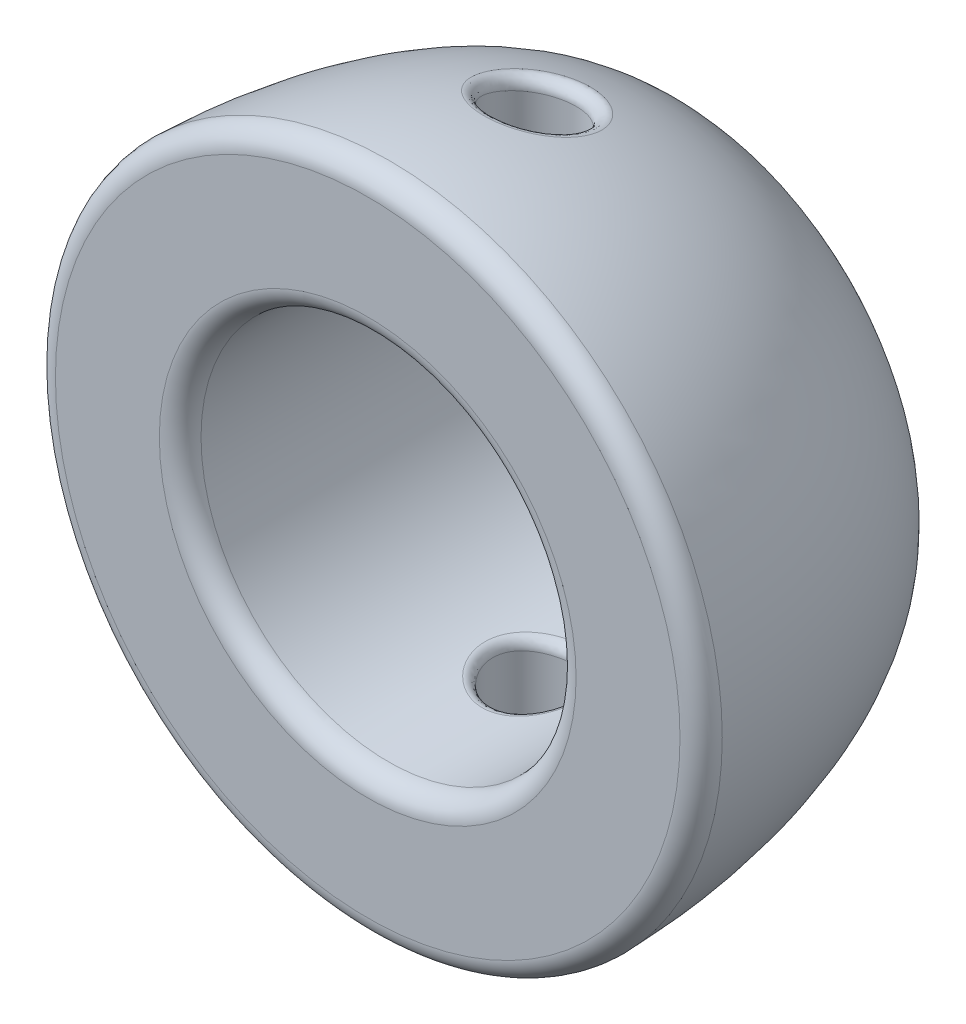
ISO-10303-21;
HEADER;
FILE_DESCRIPTION(('STEP AP214'),'2;1');
FILE_NAME('part.step','',(''),(''),'','','');
FILE_SCHEMA(('AUTOMOTIVE_DESIGN { 1 0 10303 214 1 1 1 1 }'));
ENDSEC;
DATA;
#1=APPLICATION_CONTEXT('core data for automotive mechanical design processes');
#2=APPLICATION_PROTOCOL_DEFINITION('international standard','automotive_design',2000,#1);
#3=PRODUCT_CONTEXT('',#1,'mechanical');
#4=PRODUCT('Part','Part','',(#3));
#5=PRODUCT_RELATED_PRODUCT_CATEGORY('part','',(#4));
#6=PRODUCT_DEFINITION_FORMATION('','',#4);
#7=PRODUCT_DEFINITION_CONTEXT('part definition',#1,'design');
#8=PRODUCT_DEFINITION('design','',#6,#7);
#9=PRODUCT_DEFINITION_SHAPE('','',#8);
#10=(LENGTH_UNIT() NAMED_UNIT(*) SI_UNIT(.MILLI.,.METRE.));
#11=(NAMED_UNIT(*) PLANE_ANGLE_UNIT() SI_UNIT($,.RADIAN.));
#12=(NAMED_UNIT(*) SI_UNIT($,.STERADIAN.) SOLID_ANGLE_UNIT());
#13=UNCERTAINTY_MEASURE_WITH_UNIT(LENGTH_MEASURE(1.E-05),#10,'distance_accuracy_value','');
#14=(GEOMETRIC_REPRESENTATION_CONTEXT(3) GLOBAL_UNCERTAINTY_ASSIGNED_CONTEXT((#13)) GLOBAL_UNIT_ASSIGNED_CONTEXT((#10,
#11,#12)) REPRESENTATION_CONTEXT('',''));
#15=CARTESIAN_POINT('',(0.,0.,0.));
#16=DIRECTION('',(0.,0.,1.));
#17=DIRECTION('',(1.,0.,0.));
#18=AXIS2_PLACEMENT_3D('',#15,#16,#17);
#19=CARTESIAN_POINT('',(0.,4.5,4.));
#20=DIRECTION('',(0.,0.,-1.));
#21=DIRECTION('',(-1.,0.,0.));
#22=AXIS2_PLACEMENT_3D('',#19,#20,#21);
#23=PLANE('',#22);
#24=CARTESIAN_POINT('',(0.,0.,4.));
#25=DIRECTION('',(0.,0.,-1.));
#26=DIRECTION('',(-1.,0.,0.));
#27=AXIS2_PLACEMENT_3D('',#24,#25,#26);
#28=CIRCLE('',#27,7.49296445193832);
#29=CARTESIAN_POINT('',(-7.49296445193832,0.,4.));
#30=VERTEX_POINT('',#29);
#31=EDGE_CURVE('E116',#30,#30,#28,.F.);
#32=ORIENTED_EDGE('',*,*,#31,.T.);
#33=EDGE_LOOP('',(#32));
#34=FACE_BOUND('',#33,.T.);
#35=CARTESIAN_POINT('',(0.,0.,4.));
#36=DIRECTION('',(0.,0.,-1.));
#37=DIRECTION('',(-1.,0.,0.));
#38=AXIS2_PLACEMENT_3D('',#35,#36,#37);
#39=CIRCLE('',#38,5.);
#40=CARTESIAN_POINT('',(-5.,0.,4.));
#41=VERTEX_POINT('',#40);
#42=EDGE_CURVE('E113',#41,#41,#39,.T.);
#43=ORIENTED_EDGE('',*,*,#42,.T.);
#44=EDGE_LOOP('',(#43));
#45=FACE_BOUND('',#44,.T.);
#46=ADVANCED_FACE('F29',(#34,#45),#23,.F.);
#47=CARTESIAN_POINT('',(0.,0.,4.));
#48=DIRECTION('',(0.,0.,1.));
#49=DIRECTION('',(1.,0.,0.));
#50=AXIS2_PLACEMENT_3D('',#47,#48,#49);
#51=CYLINDRICAL_SURFACE('',#50,4.5);
#52=CARTESIAN_POINT('',(0.279482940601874,-4.73713542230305,0.960150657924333));
#53=CARTESIAN_POINT('',(0.262873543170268,-4.49283422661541,0.964985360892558));
#54=CARTESIAN_POINT('',(0.33096664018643,-4.48781250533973,1.20018832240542));
#55=CARTESIAN_POINT('',(0.225708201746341,-4.74209238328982,0.975803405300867));
#56=CARTESIAN_POINT('',(0.211422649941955,-4.49565405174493,0.978950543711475));
#57=CARTESIAN_POINT('',(0.26728602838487,-4.49250857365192,1.21975425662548));
#58=CARTESIAN_POINT('',(0.170540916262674,-4.74572653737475,0.986948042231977));
#59=CARTESIAN_POINT('',(0.159544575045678,-4.49765164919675,0.988639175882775));
#60=CARTESIAN_POINT('',(0.201956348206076,-4.49595145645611,1.23368505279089));
#61=CARTESIAN_POINT('',(0.0590490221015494,-4.74993764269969,0.999830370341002));
#62=CARTESIAN_POINT('',(0.055015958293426,-4.49997177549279,0.999874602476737));
#63=CARTESIAN_POINT('',(0.0699264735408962,-4.49994092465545,1.24978796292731));
#64=CARTESIAN_POINT('',(0.00272463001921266,-4.75051516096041,1.00156980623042));
#65=CARTESIAN_POINT('',(0.00261739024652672,-4.50028333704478,1.0013681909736));
#66=CARTESIAN_POINT('',(0.00322653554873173,-4.50048804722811,1.25196225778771));
#67=CARTESIAN_POINT('',(-0.107846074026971,-4.7485762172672,0.995666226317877));
#68=CARTESIAN_POINT('',(-0.100766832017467,-4.49921983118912,0.99623451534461));
#69=CARTESIAN_POINT('',(-0.127712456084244,-4.49865115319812,1.24458278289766));
#70=CARTESIAN_POINT('',(-0.162107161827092,-4.74614372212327,0.988277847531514));
#71=CARTESIAN_POINT('',(-0.15150618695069,-4.49789550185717,0.989851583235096));
#72=CARTESIAN_POINT('',(-0.191969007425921,-4.49634668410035,1.23534730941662));
#73=CARTESIAN_POINT('',(-0.268584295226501,-4.73858947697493,0.964797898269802));
#74=CARTESIAN_POINT('',(-0.252190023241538,-4.49367235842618,0.969172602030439));
#75=CARTESIAN_POINT('',(-0.318060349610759,-4.48919003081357,1.20599737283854));
#76=CARTESIAN_POINT('',(-0.320800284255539,-4.73346765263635,0.948706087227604));
#77=CARTESIAN_POINT('',(-0.301930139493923,-4.4907915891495,0.954966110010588));
#78=CARTESIAN_POINT('',(-0.379895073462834,-4.48433777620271,1.18588260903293));
#79=CARTESIAN_POINT('',(-0.421965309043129,-4.72105336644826,0.908253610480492));
#80=CARTESIAN_POINT('',(-0.399718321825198,-4.48358599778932,0.918427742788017));
#81=CARTESIAN_POINT('',(-0.499695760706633,-4.47257687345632,1.13531701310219));
#82=CARTESIAN_POINT('',(-0.470901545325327,-4.71375294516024,0.883862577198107));
#83=CARTESIAN_POINT('',(-0.447626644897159,-4.47928058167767,0.896198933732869));
#84=CARTESIAN_POINT('',(-0.557646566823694,-4.46566068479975,1.10482822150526));
#85=CARTESIAN_POINT('',(-0.564133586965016,-4.69773457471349,0.827482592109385));
#86=CARTESIAN_POINT('',(-0.540284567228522,-4.46953641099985,0.843626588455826));
#87=CARTESIAN_POINT('',(-0.668052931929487,-4.45048538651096,1.03435324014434));
#88=CARTESIAN_POINT('',(-0.608420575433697,-4.68901400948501,0.795479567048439));
#89=CARTESIAN_POINT('',(-0.584984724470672,-4.4641173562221,0.813409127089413));
#90=CARTESIAN_POINT('',(-0.720498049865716,-4.44222379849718,0.994349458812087));
#91=CARTESIAN_POINT('',(-0.692400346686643,-4.67079590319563,0.723687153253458));
#92=CARTESIAN_POINT('',(-0.6708504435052,-4.45249342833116,0.744249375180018));
#93=CARTESIAN_POINT('',(-0.819947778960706,-4.42496453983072,0.904608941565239));
#94=CARTESIAN_POINT('',(-0.731917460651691,-4.66128297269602,0.683694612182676));
#95=CARTESIAN_POINT('',(-0.711935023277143,-4.44627848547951,0.705179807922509));
#96=CARTESIAN_POINT('',(-0.866744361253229,-4.41595228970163,0.854618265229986));
#97=CARTESIAN_POINT('',(-0.803675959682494,-4.64277803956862,0.597692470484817));
#98=CARTESIAN_POINT('',(-0.787284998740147,-4.43393761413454,0.619765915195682));
#99=CARTESIAN_POINT('',(-0.951721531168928,-4.39842130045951,0.747115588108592));
#100=CARTESIAN_POINT('',(-0.835929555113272,-4.63378518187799,0.551693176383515));
#101=CARTESIAN_POINT('',(-0.821681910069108,-4.42780458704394,0.573483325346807));
#102=CARTESIAN_POINT('',(-0.989916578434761,-4.38990175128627,0.689616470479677));
#103=CARTESIAN_POINT('',(-0.89269738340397,-4.61721553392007,0.454214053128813));
#104=CARTESIAN_POINT('',(-0.882574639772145,-4.41635559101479,0.474274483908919));
#105=CARTESIAN_POINT('',(-1.05714163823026,-4.37420418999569,0.567767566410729));
#106=CARTESIAN_POINT('',(-0.917111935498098,-4.60965744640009,0.402673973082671));
#107=CARTESIAN_POINT('',(-0.90913121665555,-4.41102726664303,0.421222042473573));
#108=CARTESIAN_POINT('',(-1.08605360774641,-4.36704389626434,0.503342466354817));
#109=CARTESIAN_POINT('',(-0.956872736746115,-4.5970131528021,0.296025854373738));
#110=CARTESIAN_POINT('',(-0.952458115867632,-4.40205955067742,0.310700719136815));
#111=CARTESIAN_POINT('',(-1.13313876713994,-4.35506509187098,0.370032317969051));
#112=CARTESIAN_POINT('',(-0.972220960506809,-4.59192640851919,0.240918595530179));
#113=CARTESIAN_POINT('',(-0.969377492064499,-4.39839204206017,0.253090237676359));
#114=CARTESIAN_POINT('',(-1.15131429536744,-4.35024607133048,0.301148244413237));
#115=CARTESIAN_POINT('',(-0.993038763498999,-4.58495982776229,0.13023694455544));
#116=CARTESIAN_POINT('',(-0.992282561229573,-4.39337148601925,0.137114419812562));
#117=CARTESIAN_POINT('',(-1.17596695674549,-4.3436461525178,0.162796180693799));
#118=CARTESIAN_POINT('',(-0.998756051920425,-4.58299964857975,0.0747124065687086));
#119=CARTESIAN_POINT('',(-0.99862649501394,-4.39194236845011,0.0786117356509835));
#120=CARTESIAN_POINT('',(-1.18273742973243,-4.34178914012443,0.0933905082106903));
#121=CARTESIAN_POINT('',(-1.00087931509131,-4.5822760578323,-0.0365234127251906));
#122=CARTESIAN_POINT('',(-1.00097037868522,-4.39141795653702,-0.0384084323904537));
#123=CARTESIAN_POINT('',(-1.18525182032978,-4.34110363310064,-0.0456542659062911));
#124=CARTESIAN_POINT('',(-0.997286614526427,-4.58351219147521,-0.0922346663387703));
#125=CARTESIAN_POINT('',(-0.996980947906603,-4.39232027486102,-0.0971541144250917));
#126=CARTESIAN_POINT('',(-1.18099730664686,-4.3422747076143,-0.115293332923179));
#127=CARTESIAN_POINT('',(-0.981114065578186,-4.58896114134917,-0.200907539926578));
#128=CARTESIAN_POINT('',(-0.979166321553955,-4.39625507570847,-0.21118601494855));
#129=CARTESIAN_POINT('',(-1.16184560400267,-4.3474368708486,-0.251134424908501));
#130=CARTESIAN_POINT('',(-0.968744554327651,-4.59310426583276,-0.253902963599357));
#131=CARTESIAN_POINT('',(-0.965506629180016,-4.39925183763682,-0.266723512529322));
#132=CARTESIAN_POINT('',(-1.14719749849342,-4.35136193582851,-0.317378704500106));
#133=CARTESIAN_POINT('',(-0.935654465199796,-4.60380965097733,-0.357050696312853));
#134=CARTESIAN_POINT('',(-0.929332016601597,-4.40688535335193,-0.374012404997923));
#135=CARTESIAN_POINT('',(-1.10801186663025,-4.36150387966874,-0.446313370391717));
#136=CARTESIAN_POINT('',(-0.914933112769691,-4.61037213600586,-0.407202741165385));
#137=CARTESIAN_POINT('',(-0.906699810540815,-4.41154529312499,-0.425906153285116));
#138=CARTESIAN_POINT('',(-1.08347342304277,-4.36772097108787,-0.509003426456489));
#139=CARTESIAN_POINT('',(-0.86534337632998,-4.62531067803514,-0.504178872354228));
#140=CARTESIAN_POINT('',(-0.853194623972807,-4.42196693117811,-0.525264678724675));
#141=CARTESIAN_POINT('',(-1.02474873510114,-4.38187327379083,-0.630223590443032));
#142=CARTESIAN_POINT('',(-0.836345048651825,-4.63371512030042,-0.550933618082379));
#143=CARTESIAN_POINT('',(-0.822050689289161,-4.42776789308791,-0.57270292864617));
#144=CARTESIAN_POINT('',(-0.990408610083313,-4.38983537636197,-0.688667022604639));
#145=CARTESIAN_POINT('',(-0.771146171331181,-4.65135118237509,-0.639012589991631));
#146=CARTESIAN_POINT('',(-0.753036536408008,-4.43968751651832,-0.660988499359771));
#147=CARTESIAN_POINT('',(-0.913199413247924,-4.40654322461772,-0.798765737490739));
#148=CARTESIAN_POINT('',(-0.734944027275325,-4.66058298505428,-0.680335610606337));
#149=CARTESIAN_POINT('',(-0.715036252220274,-4.44581838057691,-0.701817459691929));
#150=CARTESIAN_POINT('',(-0.870328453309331,-4.41528914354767,-0.850419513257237));
#151=CARTESIAN_POINT('',(-0.655051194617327,-4.67917700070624,-0.757689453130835));
#152=CARTESIAN_POINT('',(-0.632478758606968,-4.45789043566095,-0.777240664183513));
#153=CARTESIAN_POINT('',(-0.775718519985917,-4.43290452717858,-0.94711181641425));
#154=CARTESIAN_POINT('',(-0.611165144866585,-4.68853455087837,-0.793519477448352));
#155=CARTESIAN_POINT('',(-0.587693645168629,-4.46381320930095,-0.811492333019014));
#156=CARTESIAN_POINT('',(-0.723748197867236,-4.44176957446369,-0.991899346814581));
#157=CARTESIAN_POINT('',(-0.517884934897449,-4.70604882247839,-0.857312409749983));
#158=CARTESIAN_POINT('',(-0.494066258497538,-4.47464645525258,-0.871657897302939));
#159=CARTESIAN_POINT('',(-0.613284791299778,-4.45836204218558,-1.07164051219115));
#160=CARTESIAN_POINT('',(-0.468493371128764,-4.71420610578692,-0.885279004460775));
#161=CARTESIAN_POINT('',(-0.445240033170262,-4.4795366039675,-0.897425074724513));
#162=CARTESIAN_POINT('',(-0.554794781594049,-4.46608999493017,-1.10659875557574));
#163=CARTESIAN_POINT('',(-0.372442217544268,-4.72746306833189,-0.929351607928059));
#164=CARTESIAN_POINT('',(-0.351701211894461,-4.48733246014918,-0.937575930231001));
#165=CARTESIAN_POINT('',(-0.441049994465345,-4.4786492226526,-1.16168950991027));
#166=CARTESIAN_POINT('',(-0.326301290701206,-4.73282581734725,-0.946543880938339));
#167=CARTESIAN_POINT('',(-0.307338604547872,-4.49040130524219,-0.952936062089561));
#168=CARTESIAN_POINT('',(-0.386409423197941,-4.48372972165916,-1.18317985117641));
#169=CARTESIAN_POINT('',(-0.231884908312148,-4.74151685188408,-0.973984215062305));
#170=CARTESIAN_POINT('',(-0.217359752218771,-4.49532455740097,-0.977318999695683));
#171=CARTESIAN_POINT('',(-0.274600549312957,-4.49196333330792,-1.21748026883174));
#172=CARTESIAN_POINT('',(-0.183609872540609,-4.74484553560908,-0.984233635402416));
#173=CARTESIAN_POINT('',(-0.171875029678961,-4.49716325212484,-0.986261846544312));
#174=CARTESIAN_POINT('',(-0.217432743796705,-4.49511682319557,-1.23029204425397));
#175=CARTESIAN_POINT('',(-0.0806020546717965,-4.74941424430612,-0.998244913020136));
#176=CARTESIAN_POINT('',(-0.0751590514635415,-4.49968687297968,-0.998504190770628));
#177=CARTESIAN_POINT('',(-0.0954498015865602,-4.49944507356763,-1.24780614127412));
#178=CARTESIAN_POINT('',(-0.0257447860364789,-4.75038306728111,-1.00116548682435));
#179=CARTESIAN_POINT('',(-0.0240858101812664,-4.50021009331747,-1.00101364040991));
#180=CARTESIAN_POINT('',(-0.0304872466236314,-4.50036290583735,-1.25145685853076));
#181=CARTESIAN_POINT('',(0.0837017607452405,-4.74934069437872,-0.997994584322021));
#182=CARTESIAN_POINT('',(0.0781912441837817,-4.49963891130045,-0.998258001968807));
#183=CARTESIAN_POINT('',(0.0991205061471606,-4.49937539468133,-1.24749323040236));
#184=CARTESIAN_POINT('',(0.138290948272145,-4.74732855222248,-0.991900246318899));
#185=CARTESIAN_POINT('',(0.129151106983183,-4.49854670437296,-0.993003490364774));
#186=CARTESIAN_POINT('',(0.163765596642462,-4.49746915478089,-1.23987530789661));
#187=CARTESIAN_POINT('',(0.245551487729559,-4.74054734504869,-0.970920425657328));
#188=CARTESIAN_POINT('',(0.230330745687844,-4.49477132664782,-0.974577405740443));
#189=CARTESIAN_POINT('',(0.290784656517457,-4.49104485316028,-1.21365053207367));
#190=CARTESIAN_POINT('',(0.298225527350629,-4.73578231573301,-0.956047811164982));
#191=CARTESIAN_POINT('',(0.280337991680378,-4.49210705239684,-0.961499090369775));
#192=CARTESIAN_POINT('',(0.353161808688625,-4.48653061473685,-1.19505976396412));
#193=CARTESIAN_POINT('',(0.400375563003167,-4.72399739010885,-0.917973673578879));
#194=CARTESIAN_POINT('',(0.378718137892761,-4.48530920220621,-0.927252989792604));
#195=CARTESIAN_POINT('',(0.474128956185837,-4.4753659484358,-1.14746709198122));
#196=CARTESIAN_POINT('',(0.44984693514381,-4.71697431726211,-0.894760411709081));
#197=CARTESIAN_POINT('',(0.426943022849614,-4.48119790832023,-0.9062026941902));
#198=CARTESIAN_POINT('',(0.532713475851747,-4.4687125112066,-1.11845051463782));
#199=CARTESIAN_POINT('',(0.544890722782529,-4.70130059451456,-0.840318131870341));
#200=CARTESIAN_POINT('',(0.521001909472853,-4.47173067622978,-0.85568266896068));
#201=CARTESIAN_POINT('',(0.645265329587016,-4.45386372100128,-1.05039766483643));
#202=CARTESIAN_POINT('',(0.590400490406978,-4.69262897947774,-0.80898372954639));
#203=CARTESIAN_POINT('',(0.566742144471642,-4.46638131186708,-0.826244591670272));
#204=CARTESIAN_POINT('',(0.699158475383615,-4.44564850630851,-1.01122966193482));
#205=CARTESIAN_POINT('',(0.675608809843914,-4.67463620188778,-0.739312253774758));
#206=CARTESIAN_POINT('',(0.653555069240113,-4.45497066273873,-0.759402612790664));
#207=CARTESIAN_POINT('',(0.800063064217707,-4.42860271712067,-0.924140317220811));
#208=CARTESIAN_POINT('',(0.715306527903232,-4.66531494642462,-0.700974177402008));
#209=CARTESIAN_POINT('',(0.69466103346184,-4.44892161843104,-0.722117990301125));
#210=CARTESIAN_POINT('',(0.847073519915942,-4.41977205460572,-0.876217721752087));
#211=CARTESIAN_POINT('',(0.788916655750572,-4.64674996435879,-0.617098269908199));
#212=CARTESIAN_POINT('',(0.771661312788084,-4.43661728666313,-0.639176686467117));
#213=CARTESIAN_POINT('',(0.93424340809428,-4.40218417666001,-0.771372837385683));
#214=CARTESIAN_POINT('',(0.822634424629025,-4.63751583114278,-0.571387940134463));
#215=CARTESIAN_POINT('',(0.807504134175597,-4.43035426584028,-0.593360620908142));
#216=CARTESIAN_POINT('',(0.974172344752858,-4.39343604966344,-0.714234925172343));
#217=CARTESIAN_POINT('',(0.881872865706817,-4.62047521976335,-0.474869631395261));
#218=CARTESIAN_POINT('',(0.870885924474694,-4.41862999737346,-0.495416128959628));
#219=CARTESIAN_POINT('',(1.0443231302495,-4.37729231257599,-0.593587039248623));
#220=CARTESIAN_POINT('',(0.907405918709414,-4.61266659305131,-0.42406950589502));
#221=CARTESIAN_POINT('',(0.898593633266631,-4.41314673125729,-0.443266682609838));
#222=CARTESIAN_POINT('',(1.07455964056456,-4.36989466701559,-0.530086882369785));
#223=CARTESIAN_POINT('',(0.949437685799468,-4.59942903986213,-0.318986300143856));
#224=CARTESIAN_POINT('',(0.944314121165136,-4.4037859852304,-0.33459050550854));
#225=CARTESIAN_POINT('',(1.12433410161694,-4.357353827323,-0.398732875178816));
#226=CARTESIAN_POINT('',(0.965984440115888,-4.59398749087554,-0.264723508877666));
#227=CARTESIAN_POINT('',(0.962525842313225,-4.39987293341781,-0.277964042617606));
#228=CARTESIAN_POINT('',(1.14392894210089,-4.35219867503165,-0.330904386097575));
#229=CARTESIAN_POINT('',(0.989680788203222,-4.58610080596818,-0.154052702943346));
#230=CARTESIAN_POINT('',(0.988569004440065,-4.39419949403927,-0.162141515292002));
#231=CARTESIAN_POINT('',(1.17199040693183,-4.34472707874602,-0.192565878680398));
#232=CARTESIAN_POINT('',(0.996832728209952,-4.58365492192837,-0.0976452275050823));
#233=CARTESIAN_POINT('',(0.99650187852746,-4.39241756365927,-0.102742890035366));
#234=CARTESIAN_POINT('',(1.1804598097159,-4.34240992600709,-0.122056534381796));
#235=CARTESIAN_POINT('',(1.00140905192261,-4.58209568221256,0.0137822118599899));
#236=CARTESIAN_POINT('',(1.0015545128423,-4.39128742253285,0.014462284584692));
#237=CARTESIAN_POINT('',(1.18587914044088,-4.34093275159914,0.0172277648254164));
#238=CARTESIAN_POINT('',(0.999136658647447,-4.58287844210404,0.0687889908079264));
#239=CARTESIAN_POINT('',(0.999030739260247,-4.39185899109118,0.0724788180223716));
#240=CARTESIAN_POINT('',(1.18318814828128,-4.3416743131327,0.0859862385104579));
#241=CARTESIAN_POINT('',(0.985627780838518,-4.58744650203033,0.177605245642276));
#242=CARTESIAN_POINT('',(0.984138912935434,-4.39516168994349,0.18675385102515));
#243=CARTESIAN_POINT('',(1.16719079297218,-4.34600194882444,0.222006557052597));
#244=CARTESIAN_POINT('',(0.974391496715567,-4.59123173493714,0.231414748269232));
#245=CARTESIAN_POINT('',(0.971715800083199,-4.3979049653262,0.243219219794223));
#246=CARTESIAN_POINT('',(1.15388466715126,-4.34958795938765,0.289268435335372));
#247=CARTESIAN_POINT('',(0.943458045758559,-4.60131391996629,0.335906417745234));
#248=CARTESIAN_POINT('',(0.937852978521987,-4.40511045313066,0.352077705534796));
#249=CARTESIAN_POINT('',(1.11725294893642,-4.35913950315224,0.419883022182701));
#250=CARTESIAN_POINT('',(0.923828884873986,-4.60759065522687,0.386610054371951));
#251=CARTESIAN_POINT('',(0.916373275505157,-4.40958151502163,0.40465557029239));
#252=CARTESIAN_POINT('',(1.09400788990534,-4.36508588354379,0.48326256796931));
#253=CARTESIAN_POINT('',(0.87667468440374,-4.6219633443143,0.484129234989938));
#254=CARTESIAN_POINT('',(0.865389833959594,-4.41964368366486,0.504810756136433));
#255=CARTESIAN_POINT('',(1.03816738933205,-4.37870211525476,0.605161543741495));
#256=CARTESIAN_POINT('',(0.849135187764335,-4.63006262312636,0.530937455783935));
#257=CARTESIAN_POINT('',(0.835733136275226,-4.42525979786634,0.552456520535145));
#258=CARTESIAN_POINT('',(1.00555482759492,-4.38637511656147,0.663671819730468));
#259=CARTESIAN_POINT('',(0.786021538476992,-4.64745246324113,0.620698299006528));
#260=CARTESIAN_POINT('',(0.76870345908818,-4.43707675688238,0.642769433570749));
#261=CARTESIAN_POINT('',(0.930814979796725,-4.40284970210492,0.775872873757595));
#262=CARTESIAN_POINT('',(0.750238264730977,-4.65677067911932,0.663500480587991));
#263=CARTESIAN_POINT('',(0.7310054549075,-4.44330256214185,0.685233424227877));
#264=CARTESIAN_POINT('',(0.888440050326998,-4.41167748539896,0.829375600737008));
#265=CARTESIAN_POINT('',(0.672130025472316,-4.67537039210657,0.742511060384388));
#266=CARTESIAN_POINT('',(0.650025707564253,-4.4554467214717,0.762566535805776));
#267=CARTESIAN_POINT('',(0.79594345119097,-4.42929826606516,0.928138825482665));
#268=CARTESIAN_POINT('',(0.629815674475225,-4.68465192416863,0.778729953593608));
#269=CARTESIAN_POINT('',(0.606665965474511,-4.46136369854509,0.797362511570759));
#270=CARTESIAN_POINT('',(0.745834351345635,-4.43809129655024,0.973412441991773));
#271=CARTESIAN_POINT('',(0.538714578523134,-4.70238516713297,0.844396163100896));
#272=CARTESIAN_POINT('',(0.514813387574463,-4.47241394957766,0.85961186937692));
#273=CARTESIAN_POINT('',(0.637951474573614,-4.4548912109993,1.05549520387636));
#274=CARTESIAN_POINT('',(0.489809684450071,-4.71081512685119,0.873683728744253));
#275=CARTESIAN_POINT('',(0.466243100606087,-4.47750751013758,0.886739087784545));
#276=CARTESIAN_POINT('',(0.580037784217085,-4.46287748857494,1.09210466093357));
#277=CARTESIAN_POINT('',(0.387578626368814,-4.7256657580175,0.923589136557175));
#278=CARTESIAN_POINT('',(0.366216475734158,-4.48630679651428,0.93244945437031));
#279=CARTESIAN_POINT('',(0.458974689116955,-4.47694650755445,1.1544864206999));
#280=CARTESIAN_POINT('',(0.334253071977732,-4.73208670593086,0.944208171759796));
#281=CARTESIAN_POINT('',(0.314868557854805,-4.48998458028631,0.950872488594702));
#282=CARTESIAN_POINT('',(0.395826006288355,-4.48302951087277,1.18026021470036));
#283=CARTESIAN_POINT('',(0.279482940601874,-4.73713542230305,0.960150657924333));
#284=CARTESIAN_POINT('',(0.262873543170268,-4.49283422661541,0.964985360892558));
#285=CARTESIAN_POINT('',(0.33096664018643,-4.48781250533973,1.20018832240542));
#286=(BOUNDED_SURFACE() B_SPLINE_SURFACE(3,2,((#52,#53,#54),(#55,#56,#57),(#58,#59,#60),(#61,
#62,#63),(#64,#65,#66),(#67,#68,#69),(#70,#71,#72),(#73,#74,#75),(#76,#77,#78),(#79,#80,#81),
(#82,#83,#84),(#85,#86,#87),(#88,#89,#90),(#91,#92,#93),(#94,#95,#96),(#97,#98,#99),(#100,#101,
#102),(#103,#104,#105),(#106,#107,#108),(#109,#110,#111),(#112,#113,#114),(#115,#116,#117),
(#118,#119,#120),(#121,#122,#123),(#124,#125,#126),(#127,#128,#129),(#130,#131,#132),(#133,#134,
#135),(#136,#137,#138),(#139,#140,#141),(#142,#143,#144),(#145,#146,#147),(#148,#149,#150),
(#151,#152,#153),(#154,#155,#156),(#157,#158,#159),(#160,#161,#162),(#163,#164,#165),(#166,#167,
#168),(#169,#170,#171),(#172,#173,#174),(#175,#176,#177),(#178,#179,#180),(#181,#182,#183),
(#184,#185,#186),(#187,#188,#189),(#190,#191,#192),(#193,#194,#195),(#196,#197,#198),(#199,#200,
#201),(#202,#203,#204),(#205,#206,#207),(#208,#209,#210),(#211,#212,#213),(#214,#215,#216),
(#217,#218,#219),(#220,#221,#222),(#223,#224,#225),(#226,#227,#228),(#229,#230,#231),(#232,#233,
#234),(#235,#236,#237),(#238,#239,#240),(#241,#242,#243),(#244,#245,#246),(#247,#248,#249),
(#250,#251,#252),(#253,#254,#255),(#256,#257,#258),(#259,#260,#261),(#262,#263,#264),(#265,#266,
#267),(#268,#269,#270),(#271,#272,#273),(#274,#275,#276),(#277,#278,#279),(#280,#281,#282),
(#283,#284,#285)),.UNSPECIFIED.,.T.,.F.,.F.) B_SPLINE_SURFACE_WITH_KNOTS((4,2,2,2,2,2,2,2,2,2,2,
2,2,2,2,2,2,2,2,2,2,2,2,2,2,2,2,2,2,2,2,2,2,2,2,2,2,2,4),(3,3),(0.,0.21028961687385,
0.420540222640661,0.625055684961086,0.829576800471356,1.03485447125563,1.24051465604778,
1.45228738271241,1.66370140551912,1.87770608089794,2.09166412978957,2.30003004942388,
2.50836632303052,2.7118714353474,2.91539542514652,3.12230918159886,3.32926878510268,
3.54256566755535,3.75576237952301,3.94043394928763,4.12506935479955,4.33009135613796,
4.53517845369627,4.73996565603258,4.94504221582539,5.15292625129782,5.36084007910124,
5.57461515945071,5.78806532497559,6.00036287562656,6.21260739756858,6.41807692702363,
6.62354186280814,6.82737259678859,7.03157825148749,7.24168293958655,7.45144968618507,
7.66566134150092,7.87984350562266),(0.,1.),
.UNSPECIFIED.) GEOMETRIC_REPRESENTATION_ITEM() RATIONAL_B_SPLINE_SURFACE(((1.,0.714337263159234,
1.),(1.,0.711569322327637,1.),(1.,0.709520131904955,1.),(1.,0.707143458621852,1.),(1.,
0.706815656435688,1.),(1.,0.707911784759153,1.),(1.,0.709288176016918,1.),(1.,0.713528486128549,
1.),(1.,0.716392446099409,1.),(1.,0.723257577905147,1.),(1.,0.727262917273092,1.),(1.,
0.735939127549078,1.),(1.,0.740611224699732,1.),(1.,0.75024394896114,1.),(1.,0.7552090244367,
1.),(1.,0.764748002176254,1.),(1.,0.769322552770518,1.),(1.,0.777667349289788,1.),(1.,
0.781427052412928,1.),(1.,0.787675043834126,1.),(1.,0.790163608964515,1.),(1.,0.793563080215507,
1.),(1.,0.794513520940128,1.),(1.,0.794864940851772,1.),(1.,0.794266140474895,1.),(1.,
0.791611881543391,1.),(1.,0.789590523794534,1.),(1.,0.784322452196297,1.),(1.,0.781075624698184,
1.),(1.,0.773602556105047,1.),(1.,0.769360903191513,1.),(1.,0.760346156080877,1.),(1.,
0.75557294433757,1.),(1.,0.745833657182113,1.),(1.,0.740866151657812,1.),(1.,0.731455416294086,
1.),(1.,0.727011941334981,1.),(1.,0.719723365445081,1.),(1.,0.716743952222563,1.),(1.,
0.711890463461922,1.),(1.,0.710016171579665,1.),(1.,0.707439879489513,1.),(1.,0.706890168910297,
1.),(1.,0.707479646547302,1.),(1.,0.708619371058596,1.),(1.,0.712431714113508,1.),(1.,
0.715102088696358,1.),(1.,0.721635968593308,1.),(1.,0.725501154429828,1.),(1.,0.734018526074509,
1.),(1.,0.738680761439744,1.),(1.,0.748226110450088,1.),(1.,0.753109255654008,1.),(1.,
0.762714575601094,1.),(1.,0.767428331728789,1.),(1.,0.776036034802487,1.),(1.,0.77993121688,1.),
(1.,0.786487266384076,1.),(1.,0.789154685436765,1.),(1.,0.793008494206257,1.),(1.,
0.794195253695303,1.),(1.,0.794952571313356,1.),(1.,0.794573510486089,1.),(1.,0.792350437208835,
1.),(1.,0.790506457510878,1.),(1.,0.785554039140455,1.),(1.,0.782455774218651,1.),(1.,
0.77528436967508,1.),(1.,0.771209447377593,1.),(1.,0.762350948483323,1.),(1.,0.757550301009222,
1.),(1.,0.747840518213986,1.),(1.,0.742931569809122,1.),(1.,0.733437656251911,1.),(1.,
0.728861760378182,1.),(1.,0.720721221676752,1.),(1.,0.717156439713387,1.),(1.,0.714337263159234,1.))) REPRESENTATION_ITEM('') SURFACE());
#287=CARTESIAN_POINT('',(0.33096664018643,-4.48781250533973,1.20018832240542));
#288=CARTESIAN_POINT('',(0.26728602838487,-4.49250857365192,1.21975425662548));
#289=CARTESIAN_POINT('',(0.201956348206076,-4.49595145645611,1.23368505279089));
#290=CARTESIAN_POINT('',(0.0699264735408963,-4.49994092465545,1.24978796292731));
#291=CARTESIAN_POINT('',(0.00322653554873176,-4.50048804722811,1.25196225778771));
#292=CARTESIAN_POINT('',(-0.127712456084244,-4.49865115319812,1.24458278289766));
#293=CARTESIAN_POINT('',(-0.191969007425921,-4.49634668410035,1.23534730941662));
#294=CARTESIAN_POINT('',(-0.318060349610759,-4.48919003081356,1.20599737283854));
#295=CARTESIAN_POINT('',(-0.379895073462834,-4.48433777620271,1.18588260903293));
#296=CARTESIAN_POINT('',(-0.499695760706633,-4.47257687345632,1.13531701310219));
#297=CARTESIAN_POINT('',(-0.557646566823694,-4.46566068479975,1.10482822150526));
#298=CARTESIAN_POINT('',(-0.668052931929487,-4.45048538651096,1.03435324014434));
#299=CARTESIAN_POINT('',(-0.720498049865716,-4.44222379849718,0.994349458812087));
#300=CARTESIAN_POINT('',(-0.819947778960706,-4.42496453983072,0.904608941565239));
#301=CARTESIAN_POINT('',(-0.866744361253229,-4.41595228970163,0.854618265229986));
#302=CARTESIAN_POINT('',(-0.951721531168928,-4.39842130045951,0.747115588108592));
#303=CARTESIAN_POINT('',(-0.989916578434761,-4.38990175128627,0.689616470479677));
#304=CARTESIAN_POINT('',(-1.05714163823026,-4.37420418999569,0.567767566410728));
#305=CARTESIAN_POINT('',(-1.08605360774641,-4.36704389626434,0.503342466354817));
#306=CARTESIAN_POINT('',(-1.13313876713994,-4.35506509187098,0.370032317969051));
#307=CARTESIAN_POINT('',(-1.15131429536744,-4.35024607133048,0.301148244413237));
#308=CARTESIAN_POINT('',(-1.17596695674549,-4.3436461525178,0.162796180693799));
#309=CARTESIAN_POINT('',(-1.18273742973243,-4.34178914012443,0.0933905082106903));
#310=CARTESIAN_POINT('',(-1.18525182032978,-4.34110363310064,-0.0456542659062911));
#311=CARTESIAN_POINT('',(-1.18099730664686,-4.3422747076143,-0.115293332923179));
#312=CARTESIAN_POINT('',(-1.16184560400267,-4.3474368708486,-0.251134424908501));
#313=CARTESIAN_POINT('',(-1.14719749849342,-4.35136193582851,-0.317378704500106));
#314=CARTESIAN_POINT('',(-1.10801186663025,-4.36150387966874,-0.446313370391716));
#315=CARTESIAN_POINT('',(-1.08347342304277,-4.36772097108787,-0.509003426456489));
#316=CARTESIAN_POINT('',(-1.02474873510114,-4.38187327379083,-0.630223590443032));
#317=CARTESIAN_POINT('',(-0.990408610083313,-4.38983537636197,-0.688667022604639));
#318=CARTESIAN_POINT('',(-0.913199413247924,-4.40654322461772,-0.798765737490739));
#319=CARTESIAN_POINT('',(-0.870328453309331,-4.41528914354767,-0.850419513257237));
#320=CARTESIAN_POINT('',(-0.775718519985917,-4.43290452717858,-0.94711181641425));
#321=CARTESIAN_POINT('',(-0.723748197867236,-4.44176957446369,-0.991899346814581));
#322=CARTESIAN_POINT('',(-0.613284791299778,-4.45836204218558,-1.07164051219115));
#323=CARTESIAN_POINT('',(-0.554794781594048,-4.46608999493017,-1.10659875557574));
#324=CARTESIAN_POINT('',(-0.441049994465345,-4.4786492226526,-1.16168950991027));
#325=CARTESIAN_POINT('',(-0.386409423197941,-4.48372972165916,-1.18317985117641));
#326=CARTESIAN_POINT('',(-0.274600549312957,-4.49196333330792,-1.21748026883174));
#327=CARTESIAN_POINT('',(-0.217432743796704,-4.49511682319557,-1.23029204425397));
#328=CARTESIAN_POINT('',(-0.0954498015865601,-4.49944507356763,-1.24780614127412));
#329=CARTESIAN_POINT('',(-0.0304872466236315,-4.50036290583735,-1.25145685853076));
#330=CARTESIAN_POINT('',(0.0991205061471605,-4.49937539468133,-1.24749323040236));
#331=CARTESIAN_POINT('',(0.163765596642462,-4.49746915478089,-1.23987530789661));
#332=CARTESIAN_POINT('',(0.290784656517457,-4.49104485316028,-1.21365053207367));
#333=CARTESIAN_POINT('',(0.353161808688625,-4.48653061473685,-1.19505976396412));
#334=CARTESIAN_POINT('',(0.474128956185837,-4.4753659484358,-1.14746709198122));
#335=CARTESIAN_POINT('',(0.532713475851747,-4.4687125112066,-1.11845051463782));
#336=CARTESIAN_POINT('',(0.645265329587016,-4.45386372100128,-1.05039766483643));
#337=CARTESIAN_POINT('',(0.699158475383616,-4.44564850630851,-1.01122966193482));
#338=CARTESIAN_POINT('',(0.800063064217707,-4.42860271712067,-0.924140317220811));
#339=CARTESIAN_POINT('',(0.847073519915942,-4.41977205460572,-0.876217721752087));
#340=CARTESIAN_POINT('',(0.93424340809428,-4.40218417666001,-0.771372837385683));
#341=CARTESIAN_POINT('',(0.974172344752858,-4.39343604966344,-0.714234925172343));
#342=CARTESIAN_POINT('',(1.0443231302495,-4.37729231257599,-0.593587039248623));
#343=CARTESIAN_POINT('',(1.07455964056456,-4.36989466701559,-0.530086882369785));
#344=CARTESIAN_POINT('',(1.12433410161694,-4.357353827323,-0.398732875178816));
#345=CARTESIAN_POINT('',(1.14392894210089,-4.35219867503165,-0.330904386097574));
#346=CARTESIAN_POINT('',(1.17199040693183,-4.34472707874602,-0.192565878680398));
#347=CARTESIAN_POINT('',(1.1804598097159,-4.34240992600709,-0.122056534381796));
#348=CARTESIAN_POINT('',(1.18587914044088,-4.34093275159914,0.0172277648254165));
#349=CARTESIAN_POINT('',(1.18318814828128,-4.3416743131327,0.0859862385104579));
#350=CARTESIAN_POINT('',(1.16719079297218,-4.34600194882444,0.222006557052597));
#351=CARTESIAN_POINT('',(1.15388466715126,-4.34958795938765,0.289268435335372));
#352=CARTESIAN_POINT('',(1.11725294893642,-4.35913950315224,0.419883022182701));
#353=CARTESIAN_POINT('',(1.09400788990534,-4.36508588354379,0.483262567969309));
#354=CARTESIAN_POINT('',(1.03816738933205,-4.37870211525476,0.605161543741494));
#355=CARTESIAN_POINT('',(1.00555482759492,-4.38637511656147,0.663671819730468));
#356=CARTESIAN_POINT('',(0.930814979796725,-4.40284970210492,0.775872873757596));
#357=CARTESIAN_POINT('',(0.888440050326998,-4.41167748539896,0.829375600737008));
#358=CARTESIAN_POINT('',(0.79594345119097,-4.42929826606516,0.928138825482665));
#359=CARTESIAN_POINT('',(0.745834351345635,-4.43809129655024,0.973412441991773));
#360=CARTESIAN_POINT('',(0.637951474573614,-4.4548912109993,1.05549520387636));
#361=CARTESIAN_POINT('',(0.580037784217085,-4.46287748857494,1.09210466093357));
#362=CARTESIAN_POINT('',(0.458974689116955,-4.47694650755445,1.1544864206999));
#363=CARTESIAN_POINT('',(0.395826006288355,-4.48302951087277,1.18026021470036));
#364=CARTESIAN_POINT('',(0.33096664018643,-4.48781250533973,1.20018832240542));
#365=B_SPLINE_CURVE_WITH_KNOTS('',3,(#287,#288,#289,#290,#291,#292,#293,#294,#295,#296,#297,
#298,#299,#300,#301,#302,#303,#304,#305,#306,#307,#308,#309,#310,#311,#312,#313,#314,#315,#316,
#317,#318,#319,#320,#321,#322,#323,#324,#325,#326,#327,#328,#329,#330,#331,#332,#333,#334,#335,
#336,#337,#338,#339,#340,#341,#342,#343,#344,#345,#346,#347,#348,#349,#350,#351,#352,#353,#354,
#355,#356,#357,#358,#359,#360,#361,#362,#363,#364),.UNSPECIFIED.,.T.,.F.,(4,2,2,2,2,2,2,2,2,2,2,
2,2,2,2,2,2,2,2,2,2,2,2,2,2,2,2,2,2,2,2,2,2,2,2,2,2,2,4),(0.,0.21028961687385,0.420540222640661,
0.625055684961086,0.829576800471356,1.03485447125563,1.24051465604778,1.45228738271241,
1.66370140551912,1.87770608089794,2.09166412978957,2.30003004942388,2.50836632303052,
2.7118714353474,2.91539542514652,3.12230918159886,3.32926878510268,3.54256566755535,
3.75576237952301,3.94043394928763,4.12506935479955,4.33009135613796,4.53517845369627,
4.73996565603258,4.94504221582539,5.15292625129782,5.36084007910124,5.57461515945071,
5.78806532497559,6.00036287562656,6.21260739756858,6.41807692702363,6.62354186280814,
6.82737259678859,7.03157825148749,7.24168293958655,7.45144968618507,7.66566134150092,
7.87984350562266),.UNSPECIFIED.);
#366=CARTESIAN_POINT('',(0.33096664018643,-4.48781250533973,1.20018832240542));
#367=VERTEX_POINT('',#366);
#368=EDGE_CURVE('E136',#367,#367,#365,.T.);
#369=ORIENTED_EDGE('',*,*,#368,.T.);
#370=EDGE_LOOP('',(#369));
#371=FACE_BOUND('',#370,.T.);
#372=CARTESIAN_POINT('',(-0.279482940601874,4.73713542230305,0.960150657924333));
#373=CARTESIAN_POINT('',(-0.262873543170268,4.49283422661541,0.964985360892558));
#374=CARTESIAN_POINT('',(-0.33096664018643,4.48781250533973,1.20018832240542));
#375=CARTESIAN_POINT('',(-0.225708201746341,4.74209238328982,0.975803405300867));
#376=CARTESIAN_POINT('',(-0.211422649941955,4.49565405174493,0.978950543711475));
#377=CARTESIAN_POINT('',(-0.26728602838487,4.49250857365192,1.21975425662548));
#378=CARTESIAN_POINT('',(-0.170540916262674,4.74572653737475,0.986948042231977));
#379=CARTESIAN_POINT('',(-0.159544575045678,4.49765164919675,0.988639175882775));
#380=CARTESIAN_POINT('',(-0.201956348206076,4.49595145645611,1.23368505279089));
#381=CARTESIAN_POINT('',(-0.0590490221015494,4.74993764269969,0.999830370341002));
#382=CARTESIAN_POINT('',(-0.055015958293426,4.49997177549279,0.999874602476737));
#383=CARTESIAN_POINT('',(-0.0699264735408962,4.49994092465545,1.24978796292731));
#384=CARTESIAN_POINT('',(-0.00272463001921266,4.75051516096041,1.00156980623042));
#385=CARTESIAN_POINT('',(-0.00261739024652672,4.50028333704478,1.0013681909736));
#386=CARTESIAN_POINT('',(-0.00322653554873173,4.50048804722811,1.25196225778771));
#387=CARTESIAN_POINT('',(0.107846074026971,4.7485762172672,0.995666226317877));
#388=CARTESIAN_POINT('',(0.100766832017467,4.49921983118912,0.99623451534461));
#389=CARTESIAN_POINT('',(0.127712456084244,4.49865115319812,1.24458278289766));
#390=CARTESIAN_POINT('',(0.162107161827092,4.74614372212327,0.988277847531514));
#391=CARTESIAN_POINT('',(0.15150618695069,4.49789550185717,0.989851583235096));
#392=CARTESIAN_POINT('',(0.191969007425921,4.49634668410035,1.23534730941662));
#393=CARTESIAN_POINT('',(0.268584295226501,4.73858947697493,0.964797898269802));
#394=CARTESIAN_POINT('',(0.252190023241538,4.49367235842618,0.969172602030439));
#395=CARTESIAN_POINT('',(0.318060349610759,4.48919003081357,1.20599737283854));
#396=CARTESIAN_POINT('',(0.320800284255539,4.73346765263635,0.948706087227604));
#397=CARTESIAN_POINT('',(0.301930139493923,4.4907915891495,0.954966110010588));
#398=CARTESIAN_POINT('',(0.379895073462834,4.48433777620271,1.18588260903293));
#399=CARTESIAN_POINT('',(0.421965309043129,4.72105336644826,0.908253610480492));
#400=CARTESIAN_POINT('',(0.399718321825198,4.48358599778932,0.918427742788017));
#401=CARTESIAN_POINT('',(0.499695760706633,4.47257687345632,1.13531701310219));
#402=CARTESIAN_POINT('',(0.470901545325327,4.71375294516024,0.883862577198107));
#403=CARTESIAN_POINT('',(0.447626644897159,4.47928058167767,0.896198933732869));
#404=CARTESIAN_POINT('',(0.557646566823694,4.46566068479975,1.10482822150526));
#405=CARTESIAN_POINT('',(0.564133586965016,4.69773457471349,0.827482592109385));
#406=CARTESIAN_POINT('',(0.540284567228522,4.46953641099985,0.843626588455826));
#407=CARTESIAN_POINT('',(0.668052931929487,4.45048538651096,1.03435324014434));
#408=CARTESIAN_POINT('',(0.608420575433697,4.68901400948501,0.795479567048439));
#409=CARTESIAN_POINT('',(0.584984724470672,4.4641173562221,0.813409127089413));
#410=CARTESIAN_POINT('',(0.720498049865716,4.44222379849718,0.994349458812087));
#411=CARTESIAN_POINT('',(0.692400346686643,4.67079590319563,0.723687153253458));
#412=CARTESIAN_POINT('',(0.6708504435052,4.45249342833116,0.744249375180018));
#413=CARTESIAN_POINT('',(0.819947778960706,4.42496453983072,0.904608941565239));
#414=CARTESIAN_POINT('',(0.731917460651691,4.66128297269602,0.683694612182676));
#415=CARTESIAN_POINT('',(0.711935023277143,4.44627848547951,0.705179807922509));
#416=CARTESIAN_POINT('',(0.866744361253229,4.41595228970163,0.854618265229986));
#417=CARTESIAN_POINT('',(0.803675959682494,4.64277803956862,0.597692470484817));
#418=CARTESIAN_POINT('',(0.787284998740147,4.43393761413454,0.619765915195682));
#419=CARTESIAN_POINT('',(0.951721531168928,4.39842130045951,0.747115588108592));
#420=CARTESIAN_POINT('',(0.835929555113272,4.63378518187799,0.551693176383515));
#421=CARTESIAN_POINT('',(0.821681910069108,4.42780458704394,0.573483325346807));
#422=CARTESIAN_POINT('',(0.989916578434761,4.38990175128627,0.689616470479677));
#423=CARTESIAN_POINT('',(0.89269738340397,4.61721553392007,0.454214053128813));
#424=CARTESIAN_POINT('',(0.882574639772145,4.41635559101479,0.474274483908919));
#425=CARTESIAN_POINT('',(1.05714163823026,4.37420418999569,0.567767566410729));
#426=CARTESIAN_POINT('',(0.917111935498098,4.60965744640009,0.402673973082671));
#427=CARTESIAN_POINT('',(0.90913121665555,4.41102726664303,0.421222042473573));
#428=CARTESIAN_POINT('',(1.08605360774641,4.36704389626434,0.503342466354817));
#429=CARTESIAN_POINT('',(0.956872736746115,4.5970131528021,0.296025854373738));
#430=CARTESIAN_POINT('',(0.952458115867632,4.40205955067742,0.310700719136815));
#431=CARTESIAN_POINT('',(1.13313876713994,4.35506509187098,0.370032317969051));
#432=CARTESIAN_POINT('',(0.972220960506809,4.59192640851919,0.240918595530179));
#433=CARTESIAN_POINT('',(0.969377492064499,4.39839204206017,0.253090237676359));
#434=CARTESIAN_POINT('',(1.15131429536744,4.35024607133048,0.301148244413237));
#435=CARTESIAN_POINT('',(0.993038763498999,4.58495982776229,0.13023694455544));
#436=CARTESIAN_POINT('',(0.992282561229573,4.39337148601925,0.137114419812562));
#437=CARTESIAN_POINT('',(1.17596695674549,4.3436461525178,0.162796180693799));
#438=CARTESIAN_POINT('',(0.998756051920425,4.58299964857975,0.0747124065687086));
#439=CARTESIAN_POINT('',(0.99862649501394,4.39194236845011,0.0786117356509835));
#440=CARTESIAN_POINT('',(1.18273742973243,4.34178914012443,0.0933905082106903));
#441=CARTESIAN_POINT('',(1.00087931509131,4.5822760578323,-0.0365234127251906));
#442=CARTESIAN_POINT('',(1.00097037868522,4.39141795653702,-0.0384084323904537));
#443=CARTESIAN_POINT('',(1.18525182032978,4.34110363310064,-0.0456542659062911));
#444=CARTESIAN_POINT('',(0.997286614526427,4.58351219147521,-0.0922346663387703));
#445=CARTESIAN_POINT('',(0.996980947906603,4.39232027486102,-0.0971541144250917));
#446=CARTESIAN_POINT('',(1.18099730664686,4.3422747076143,-0.115293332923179));
#447=CARTESIAN_POINT('',(0.981114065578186,4.58896114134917,-0.200907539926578));
#448=CARTESIAN_POINT('',(0.979166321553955,4.39625507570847,-0.21118601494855));
#449=CARTESIAN_POINT('',(1.16184560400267,4.3474368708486,-0.251134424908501));
#450=CARTESIAN_POINT('',(0.968744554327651,4.59310426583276,-0.253902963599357));
#451=CARTESIAN_POINT('',(0.965506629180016,4.39925183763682,-0.266723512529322));
#452=CARTESIAN_POINT('',(1.14719749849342,4.35136193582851,-0.317378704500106));
#453=CARTESIAN_POINT('',(0.935654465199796,4.60380965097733,-0.357050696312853));
#454=CARTESIAN_POINT('',(0.929332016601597,4.40688535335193,-0.374012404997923));
#455=CARTESIAN_POINT('',(1.10801186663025,4.36150387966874,-0.446313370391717));
#456=CARTESIAN_POINT('',(0.914933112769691,4.61037213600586,-0.407202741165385));
#457=CARTESIAN_POINT('',(0.906699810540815,4.41154529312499,-0.425906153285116));
#458=CARTESIAN_POINT('',(1.08347342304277,4.36772097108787,-0.509003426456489));
#459=CARTESIAN_POINT('',(0.86534337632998,4.62531067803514,-0.504178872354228));
#460=CARTESIAN_POINT('',(0.853194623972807,4.42196693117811,-0.525264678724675));
#461=CARTESIAN_POINT('',(1.02474873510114,4.38187327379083,-0.630223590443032));
#462=CARTESIAN_POINT('',(0.836345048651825,4.63371512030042,-0.550933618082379));
#463=CARTESIAN_POINT('',(0.822050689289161,4.42776789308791,-0.57270292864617));
#464=CARTESIAN_POINT('',(0.990408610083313,4.38983537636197,-0.688667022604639));
#465=CARTESIAN_POINT('',(0.771146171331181,4.65135118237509,-0.639012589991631));
#466=CARTESIAN_POINT('',(0.753036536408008,4.43968751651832,-0.660988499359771));
#467=CARTESIAN_POINT('',(0.913199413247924,4.40654322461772,-0.798765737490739));
#468=CARTESIAN_POINT('',(0.734944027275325,4.66058298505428,-0.680335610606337));
#469=CARTESIAN_POINT('',(0.715036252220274,4.44581838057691,-0.701817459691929));
#470=CARTESIAN_POINT('',(0.870328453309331,4.41528914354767,-0.850419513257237));
#471=CARTESIAN_POINT('',(0.655051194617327,4.67917700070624,-0.757689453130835));
#472=CARTESIAN_POINT('',(0.632478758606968,4.45789043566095,-0.777240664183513));
#473=CARTESIAN_POINT('',(0.775718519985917,4.43290452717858,-0.94711181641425));
#474=CARTESIAN_POINT('',(0.611165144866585,4.68853455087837,-0.793519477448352));
#475=CARTESIAN_POINT('',(0.587693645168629,4.46381320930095,-0.811492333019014));
#476=CARTESIAN_POINT('',(0.723748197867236,4.44176957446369,-0.991899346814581));
#477=CARTESIAN_POINT('',(0.517884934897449,4.70604882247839,-0.857312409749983));
#478=CARTESIAN_POINT('',(0.494066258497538,4.47464645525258,-0.871657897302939));
#479=CARTESIAN_POINT('',(0.613284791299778,4.45836204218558,-1.07164051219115));
#480=CARTESIAN_POINT('',(0.468493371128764,4.71420610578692,-0.885279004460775));
#481=CARTESIAN_POINT('',(0.445240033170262,4.4795366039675,-0.897425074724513));
#482=CARTESIAN_POINT('',(0.554794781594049,4.46608999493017,-1.10659875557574));
#483=CARTESIAN_POINT('',(0.372442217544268,4.72746306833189,-0.929351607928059));
#484=CARTESIAN_POINT('',(0.351701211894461,4.48733246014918,-0.937575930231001));
#485=CARTESIAN_POINT('',(0.441049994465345,4.4786492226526,-1.16168950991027));
#486=CARTESIAN_POINT('',(0.326301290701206,4.73282581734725,-0.946543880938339));
#487=CARTESIAN_POINT('',(0.307338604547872,4.49040130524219,-0.952936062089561));
#488=CARTESIAN_POINT('',(0.386409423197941,4.48372972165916,-1.18317985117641));
#489=CARTESIAN_POINT('',(0.231884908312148,4.74151685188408,-0.973984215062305));
#490=CARTESIAN_POINT('',(0.217359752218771,4.49532455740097,-0.977318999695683));
#491=CARTESIAN_POINT('',(0.274600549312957,4.49196333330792,-1.21748026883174));
#492=CARTESIAN_POINT('',(0.183609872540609,4.74484553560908,-0.984233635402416));
#493=CARTESIAN_POINT('',(0.171875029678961,4.49716325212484,-0.986261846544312));
#494=CARTESIAN_POINT('',(0.217432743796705,4.49511682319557,-1.23029204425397));
#495=CARTESIAN_POINT('',(0.0806020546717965,4.74941424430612,-0.998244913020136));
#496=CARTESIAN_POINT('',(0.0751590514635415,4.49968687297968,-0.998504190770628));
#497=CARTESIAN_POINT('',(0.0954498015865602,4.49944507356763,-1.24780614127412));
#498=CARTESIAN_POINT('',(0.0257447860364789,4.75038306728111,-1.00116548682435));
#499=CARTESIAN_POINT('',(0.0240858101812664,4.50021009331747,-1.00101364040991));
#500=CARTESIAN_POINT('',(0.0304872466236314,4.50036290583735,-1.25145685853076));
#501=CARTESIAN_POINT('',(-0.0837017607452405,4.74934069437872,-0.997994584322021));
#502=CARTESIAN_POINT('',(-0.0781912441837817,4.49963891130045,-0.998258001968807));
#503=CARTESIAN_POINT('',(-0.0991205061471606,4.49937539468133,-1.24749323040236));
#504=CARTESIAN_POINT('',(-0.138290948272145,4.74732855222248,-0.991900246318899));
#505=CARTESIAN_POINT('',(-0.129151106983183,4.49854670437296,-0.993003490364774));
#506=CARTESIAN_POINT('',(-0.163765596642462,4.49746915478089,-1.23987530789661));
#507=CARTESIAN_POINT('',(-0.245551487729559,4.74054734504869,-0.970920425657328));
#508=CARTESIAN_POINT('',(-0.230330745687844,4.49477132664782,-0.974577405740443));
#509=CARTESIAN_POINT('',(-0.290784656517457,4.49104485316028,-1.21365053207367));
#510=CARTESIAN_POINT('',(-0.298225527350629,4.73578231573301,-0.956047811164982));
#511=CARTESIAN_POINT('',(-0.280337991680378,4.49210705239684,-0.961499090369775));
#512=CARTESIAN_POINT('',(-0.353161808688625,4.48653061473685,-1.19505976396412));
#513=CARTESIAN_POINT('',(-0.400375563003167,4.72399739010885,-0.917973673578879));
#514=CARTESIAN_POINT('',(-0.378718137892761,4.48530920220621,-0.927252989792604));
#515=CARTESIAN_POINT('',(-0.474128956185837,4.4753659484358,-1.14746709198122));
#516=CARTESIAN_POINT('',(-0.44984693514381,4.71697431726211,-0.894760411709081));
#517=CARTESIAN_POINT('',(-0.426943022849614,4.48119790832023,-0.9062026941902));
#518=CARTESIAN_POINT('',(-0.532713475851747,4.4687125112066,-1.11845051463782));
#519=CARTESIAN_POINT('',(-0.544890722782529,4.70130059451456,-0.840318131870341));
#520=CARTESIAN_POINT('',(-0.521001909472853,4.47173067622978,-0.85568266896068));
#521=CARTESIAN_POINT('',(-0.645265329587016,4.45386372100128,-1.05039766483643));
#522=CARTESIAN_POINT('',(-0.590400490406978,4.69262897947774,-0.80898372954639));
#523=CARTESIAN_POINT('',(-0.566742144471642,4.46638131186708,-0.826244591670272));
#524=CARTESIAN_POINT('',(-0.699158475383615,4.44564850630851,-1.01122966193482));
#525=CARTESIAN_POINT('',(-0.675608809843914,4.67463620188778,-0.739312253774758));
#526=CARTESIAN_POINT('',(-0.653555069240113,4.45497066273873,-0.759402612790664));
#527=CARTESIAN_POINT('',(-0.800063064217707,4.42860271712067,-0.924140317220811));
#528=CARTESIAN_POINT('',(-0.715306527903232,4.66531494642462,-0.700974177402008));
#529=CARTESIAN_POINT('',(-0.69466103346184,4.44892161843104,-0.722117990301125));
#530=CARTESIAN_POINT('',(-0.847073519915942,4.41977205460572,-0.876217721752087));
#531=CARTESIAN_POINT('',(-0.788916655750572,4.64674996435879,-0.617098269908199));
#532=CARTESIAN_POINT('',(-0.771661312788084,4.43661728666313,-0.639176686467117));
#533=CARTESIAN_POINT('',(-0.93424340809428,4.40218417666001,-0.771372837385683));
#534=CARTESIAN_POINT('',(-0.822634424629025,4.63751583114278,-0.571387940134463));
#535=CARTESIAN_POINT('',(-0.807504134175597,4.43035426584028,-0.593360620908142));
#536=CARTESIAN_POINT('',(-0.974172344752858,4.39343604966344,-0.714234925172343));
#537=CARTESIAN_POINT('',(-0.881872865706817,4.62047521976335,-0.474869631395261));
#538=CARTESIAN_POINT('',(-0.870885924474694,4.41862999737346,-0.495416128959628));
#539=CARTESIAN_POINT('',(-1.0443231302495,4.37729231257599,-0.593587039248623));
#540=CARTESIAN_POINT('',(-0.907405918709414,4.61266659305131,-0.42406950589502));
#541=CARTESIAN_POINT('',(-0.898593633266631,4.41314673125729,-0.443266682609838));
#542=CARTESIAN_POINT('',(-1.07455964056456,4.36989466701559,-0.530086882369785));
#543=CARTESIAN_POINT('',(-0.949437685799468,4.59942903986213,-0.318986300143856));
#544=CARTESIAN_POINT('',(-0.944314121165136,4.4037859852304,-0.33459050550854));
#545=CARTESIAN_POINT('',(-1.12433410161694,4.357353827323,-0.398732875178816));
#546=CARTESIAN_POINT('',(-0.965984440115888,4.59398749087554,-0.264723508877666));
#547=CARTESIAN_POINT('',(-0.962525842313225,4.39987293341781,-0.277964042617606));
#548=CARTESIAN_POINT('',(-1.14392894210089,4.35219867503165,-0.330904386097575));
#549=CARTESIAN_POINT('',(-0.989680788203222,4.58610080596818,-0.154052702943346));
#550=CARTESIAN_POINT('',(-0.988569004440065,4.39419949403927,-0.162141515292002));
#551=CARTESIAN_POINT('',(-1.17199040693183,4.34472707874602,-0.192565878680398));
#552=CARTESIAN_POINT('',(-0.996832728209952,4.58365492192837,-0.0976452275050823));
#553=CARTESIAN_POINT('',(-0.99650187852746,4.39241756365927,-0.102742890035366));
#554=CARTESIAN_POINT('',(-1.1804598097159,4.34240992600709,-0.122056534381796));
#555=CARTESIAN_POINT('',(-1.00140905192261,4.58209568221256,0.0137822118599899));
#556=CARTESIAN_POINT('',(-1.0015545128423,4.39128742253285,0.014462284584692));
#557=CARTESIAN_POINT('',(-1.18587914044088,4.34093275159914,0.0172277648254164));
#558=CARTESIAN_POINT('',(-0.999136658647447,4.58287844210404,0.0687889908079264));
#559=CARTESIAN_POINT('',(-0.999030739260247,4.39185899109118,0.0724788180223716));
#560=CARTESIAN_POINT('',(-1.18318814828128,4.3416743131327,0.0859862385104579));
#561=CARTESIAN_POINT('',(-0.985627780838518,4.58744650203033,0.177605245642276));
#562=CARTESIAN_POINT('',(-0.984138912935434,4.39516168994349,0.18675385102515));
#563=CARTESIAN_POINT('',(-1.16719079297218,4.34600194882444,0.222006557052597));
#564=CARTESIAN_POINT('',(-0.974391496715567,4.59123173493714,0.231414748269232));
#565=CARTESIAN_POINT('',(-0.971715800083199,4.3979049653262,0.243219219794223));
#566=CARTESIAN_POINT('',(-1.15388466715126,4.34958795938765,0.289268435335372));
#567=CARTESIAN_POINT('',(-0.943458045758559,4.60131391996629,0.335906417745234));
#568=CARTESIAN_POINT('',(-0.937852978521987,4.40511045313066,0.352077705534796));
#569=CARTESIAN_POINT('',(-1.11725294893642,4.35913950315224,0.419883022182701));
#570=CARTESIAN_POINT('',(-0.923828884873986,4.60759065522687,0.386610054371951));
#571=CARTESIAN_POINT('',(-0.916373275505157,4.40958151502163,0.40465557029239));
#572=CARTESIAN_POINT('',(-1.09400788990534,4.36508588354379,0.48326256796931));
#573=CARTESIAN_POINT('',(-0.87667468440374,4.6219633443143,0.484129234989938));
#574=CARTESIAN_POINT('',(-0.865389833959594,4.41964368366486,0.504810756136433));
#575=CARTESIAN_POINT('',(-1.03816738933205,4.37870211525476,0.605161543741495));
#576=CARTESIAN_POINT('',(-0.849135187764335,4.63006262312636,0.530937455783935));
#577=CARTESIAN_POINT('',(-0.835733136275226,4.42525979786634,0.552456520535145));
#578=CARTESIAN_POINT('',(-1.00555482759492,4.38637511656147,0.663671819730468));
#579=CARTESIAN_POINT('',(-0.786021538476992,4.64745246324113,0.620698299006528));
#580=CARTESIAN_POINT('',(-0.76870345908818,4.43707675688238,0.642769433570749));
#581=CARTESIAN_POINT('',(-0.930814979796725,4.40284970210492,0.775872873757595));
#582=CARTESIAN_POINT('',(-0.750238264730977,4.65677067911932,0.663500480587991));
#583=CARTESIAN_POINT('',(-0.7310054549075,4.44330256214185,0.685233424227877));
#584=CARTESIAN_POINT('',(-0.888440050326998,4.41167748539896,0.829375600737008));
#585=CARTESIAN_POINT('',(-0.672130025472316,4.67537039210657,0.742511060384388));
#586=CARTESIAN_POINT('',(-0.650025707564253,4.4554467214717,0.762566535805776));
#587=CARTESIAN_POINT('',(-0.79594345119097,4.42929826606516,0.928138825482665));
#588=CARTESIAN_POINT('',(-0.629815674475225,4.68465192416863,0.778729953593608));
#589=CARTESIAN_POINT('',(-0.606665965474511,4.46136369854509,0.797362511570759));
#590=CARTESIAN_POINT('',(-0.745834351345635,4.43809129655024,0.973412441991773));
#591=CARTESIAN_POINT('',(-0.538714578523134,4.70238516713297,0.844396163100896));
#592=CARTESIAN_POINT('',(-0.514813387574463,4.47241394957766,0.85961186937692));
#593=CARTESIAN_POINT('',(-0.637951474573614,4.4548912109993,1.05549520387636));
#594=CARTESIAN_POINT('',(-0.489809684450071,4.71081512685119,0.873683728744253));
#595=CARTESIAN_POINT('',(-0.466243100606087,4.47750751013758,0.886739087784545));
#596=CARTESIAN_POINT('',(-0.580037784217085,4.46287748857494,1.09210466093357));
#597=CARTESIAN_POINT('',(-0.387578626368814,4.7256657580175,0.923589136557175));
#598=CARTESIAN_POINT('',(-0.366216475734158,4.48630679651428,0.93244945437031));
#599=CARTESIAN_POINT('',(-0.458974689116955,4.47694650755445,1.1544864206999));
#600=CARTESIAN_POINT('',(-0.334253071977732,4.73208670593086,0.944208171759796));
#601=CARTESIAN_POINT('',(-0.314868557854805,4.48998458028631,0.950872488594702));
#602=CARTESIAN_POINT('',(-0.395826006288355,4.48302951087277,1.18026021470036));
#603=CARTESIAN_POINT('',(-0.279482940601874,4.73713542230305,0.960150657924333));
#604=CARTESIAN_POINT('',(-0.262873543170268,4.49283422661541,0.964985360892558));
#605=CARTESIAN_POINT('',(-0.33096664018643,4.48781250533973,1.20018832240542));
#606=(BOUNDED_SURFACE() B_SPLINE_SURFACE(3,2,((#372,#373,#374),(#375,#376,#377),(#378,#379,
#380),(#381,#382,#383),(#384,#385,#386),(#387,#388,#389),(#390,#391,#392),(#393,#394,#395),
(#396,#397,#398),(#399,#400,#401),(#402,#403,#404),(#405,#406,#407),(#408,#409,#410),(#411,#412,
#413),(#414,#415,#416),(#417,#418,#419),(#420,#421,#422),(#423,#424,#425),(#426,#427,#428),
(#429,#430,#431),(#432,#433,#434),(#435,#436,#437),(#438,#439,#440),(#441,#442,#443),(#444,#445,
#446),(#447,#448,#449),(#450,#451,#452),(#453,#454,#455),(#456,#457,#458),(#459,#460,#461),
(#462,#463,#464),(#465,#466,#467),(#468,#469,#470),(#471,#472,#473),(#474,#475,#476),(#477,#478,
#479),(#480,#481,#482),(#483,#484,#485),(#486,#487,#488),(#489,#490,#491),(#492,#493,#494),
(#495,#496,#497),(#498,#499,#500),(#501,#502,#503),(#504,#505,#506),(#507,#508,#509),(#510,#511,
#512),(#513,#514,#515),(#516,#517,#518),(#519,#520,#521),(#522,#523,#524),(#525,#526,#527),
(#528,#529,#530),(#531,#532,#533),(#534,#535,#536),(#537,#538,#539),(#540,#541,#542),(#543,#544,
#545),(#546,#547,#548),(#549,#550,#551),(#552,#553,#554),(#555,#556,#557),(#558,#559,#560),
(#561,#562,#563),(#564,#565,#566),(#567,#568,#569),(#570,#571,#572),(#573,#574,#575),(#576,#577,
#578),(#579,#580,#581),(#582,#583,#584),(#585,#586,#587),(#588,#589,#590),(#591,#592,#593),
(#594,#595,#596),(#597,#598,#599),(#600,#601,#602),(#603,#604,#605)),.UNSPECIFIED.,.T.,.F.,
.F.) B_SPLINE_SURFACE_WITH_KNOTS((4,2,2,2,2,2,2,2,2,2,2,2,2,2,2,2,2,2,2,2,2,2,2,2,2,2,2,2,2,2,2,
2,2,2,2,2,2,2,4),(3,3),(0.,0.21028961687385,0.420540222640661,0.625055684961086,
0.829576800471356,1.03485447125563,1.24051465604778,1.45228738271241,1.66370140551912,
1.87770608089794,2.09166412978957,2.30003004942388,2.50836632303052,2.7118714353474,
2.91539542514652,3.12230918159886,3.32926878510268,3.54256566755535,3.75576237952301,
3.94043394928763,4.12506935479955,4.33009135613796,4.53517845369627,4.73996565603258,
4.94504221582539,5.15292625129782,5.36084007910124,5.57461515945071,5.78806532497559,
6.00036287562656,6.21260739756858,6.41807692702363,6.62354186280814,6.82737259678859,
7.03157825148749,7.24168293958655,7.45144968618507,7.66566134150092,7.87984350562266),(0.,1.),
.UNSPECIFIED.) GEOMETRIC_REPRESENTATION_ITEM() RATIONAL_B_SPLINE_SURFACE(((1.,0.714337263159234,
1.),(1.,0.711569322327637,1.),(1.,0.709520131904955,1.),(1.,0.707143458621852,1.),(1.,
0.706815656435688,1.),(1.,0.707911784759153,1.),(1.,0.709288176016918,1.),(1.,0.713528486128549,
1.),(1.,0.716392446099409,1.),(1.,0.723257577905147,1.),(1.,0.727262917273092,1.),(1.,
0.735939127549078,1.),(1.,0.740611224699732,1.),(1.,0.75024394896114,1.),(1.,0.7552090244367,
1.),(1.,0.764748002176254,1.),(1.,0.769322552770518,1.),(1.,0.777667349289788,1.),(1.,
0.781427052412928,1.),(1.,0.787675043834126,1.),(1.,0.790163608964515,1.),(1.,0.793563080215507,
1.),(1.,0.794513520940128,1.),(1.,0.794864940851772,1.),(1.,0.794266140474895,1.),(1.,
0.791611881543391,1.),(1.,0.789590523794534,1.),(1.,0.784322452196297,1.),(1.,0.781075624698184,
1.),(1.,0.773602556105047,1.),(1.,0.769360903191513,1.),(1.,0.760346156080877,1.),(1.,
0.75557294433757,1.),(1.,0.745833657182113,1.),(1.,0.740866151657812,1.),(1.,0.731455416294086,
1.),(1.,0.727011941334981,1.),(1.,0.719723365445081,1.),(1.,0.716743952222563,1.),(1.,
0.711890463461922,1.),(1.,0.710016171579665,1.),(1.,0.707439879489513,1.),(1.,0.706890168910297,
1.),(1.,0.707479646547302,1.),(1.,0.708619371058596,1.),(1.,0.712431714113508,1.),(1.,
0.715102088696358,1.),(1.,0.721635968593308,1.),(1.,0.725501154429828,1.),(1.,0.734018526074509,
1.),(1.,0.738680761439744,1.),(1.,0.748226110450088,1.),(1.,0.753109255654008,1.),(1.,
0.762714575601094,1.),(1.,0.767428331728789,1.),(1.,0.776036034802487,1.),(1.,0.77993121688,1.),
(1.,0.786487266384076,1.),(1.,0.789154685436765,1.),(1.,0.793008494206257,1.),(1.,
0.794195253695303,1.),(1.,0.794952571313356,1.),(1.,0.794573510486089,1.),(1.,0.792350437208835,
1.),(1.,0.790506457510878,1.),(1.,0.785554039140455,1.),(1.,0.782455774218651,1.),(1.,
0.77528436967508,1.),(1.,0.771209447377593,1.),(1.,0.762350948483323,1.),(1.,0.757550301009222,
1.),(1.,0.747840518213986,1.),(1.,0.742931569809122,1.),(1.,0.733437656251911,1.),(1.,
0.728861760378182,1.),(1.,0.720721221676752,1.),(1.,0.717156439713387,1.),(1.,0.714337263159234,1.))) REPRESENTATION_ITEM('') SURFACE());
#607=CARTESIAN_POINT('',(-0.33096664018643,4.48781250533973,1.20018832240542));
#608=CARTESIAN_POINT('',(-0.26728602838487,4.49250857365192,1.21975425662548));
#609=CARTESIAN_POINT('',(-0.201956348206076,4.49595145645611,1.23368505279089));
#610=CARTESIAN_POINT('',(-0.0699264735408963,4.49994092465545,1.24978796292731));
#611=CARTESIAN_POINT('',(-0.00322653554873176,4.50048804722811,1.25196225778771));
#612=CARTESIAN_POINT('',(0.127712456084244,4.49865115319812,1.24458278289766));
#613=CARTESIAN_POINT('',(0.191969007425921,4.49634668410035,1.23534730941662));
#614=CARTESIAN_POINT('',(0.318060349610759,4.48919003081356,1.20599737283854));
#615=CARTESIAN_POINT('',(0.379895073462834,4.48433777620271,1.18588260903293));
#616=CARTESIAN_POINT('',(0.499695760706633,4.47257687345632,1.13531701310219));
#617=CARTESIAN_POINT('',(0.557646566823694,4.46566068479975,1.10482822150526));
#618=CARTESIAN_POINT('',(0.668052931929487,4.45048538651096,1.03435324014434));
#619=CARTESIAN_POINT('',(0.720498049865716,4.44222379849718,0.994349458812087));
#620=CARTESIAN_POINT('',(0.819947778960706,4.42496453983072,0.904608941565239));
#621=CARTESIAN_POINT('',(0.866744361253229,4.41595228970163,0.854618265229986));
#622=CARTESIAN_POINT('',(0.951721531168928,4.39842130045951,0.747115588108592));
#623=CARTESIAN_POINT('',(0.989916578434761,4.38990175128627,0.689616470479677));
#624=CARTESIAN_POINT('',(1.05714163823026,4.37420418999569,0.567767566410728));
#625=CARTESIAN_POINT('',(1.08605360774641,4.36704389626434,0.503342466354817));
#626=CARTESIAN_POINT('',(1.13313876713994,4.35506509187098,0.370032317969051));
#627=CARTESIAN_POINT('',(1.15131429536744,4.35024607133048,0.301148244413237));
#628=CARTESIAN_POINT('',(1.17596695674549,4.3436461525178,0.162796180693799));
#629=CARTESIAN_POINT('',(1.18273742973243,4.34178914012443,0.0933905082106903));
#630=CARTESIAN_POINT('',(1.18525182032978,4.34110363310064,-0.0456542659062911));
#631=CARTESIAN_POINT('',(1.18099730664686,4.3422747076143,-0.115293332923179));
#632=CARTESIAN_POINT('',(1.16184560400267,4.3474368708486,-0.251134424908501));
#633=CARTESIAN_POINT('',(1.14719749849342,4.35136193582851,-0.317378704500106));
#634=CARTESIAN_POINT('',(1.10801186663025,4.36150387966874,-0.446313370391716));
#635=CARTESIAN_POINT('',(1.08347342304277,4.36772097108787,-0.509003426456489));
#636=CARTESIAN_POINT('',(1.02474873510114,4.38187327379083,-0.630223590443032));
#637=CARTESIAN_POINT('',(0.990408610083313,4.38983537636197,-0.688667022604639));
#638=CARTESIAN_POINT('',(0.913199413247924,4.40654322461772,-0.798765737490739));
#639=CARTESIAN_POINT('',(0.870328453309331,4.41528914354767,-0.850419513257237));
#640=CARTESIAN_POINT('',(0.775718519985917,4.43290452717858,-0.94711181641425));
#641=CARTESIAN_POINT('',(0.723748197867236,4.44176957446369,-0.991899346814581));
#642=CARTESIAN_POINT('',(0.613284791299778,4.45836204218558,-1.07164051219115));
#643=CARTESIAN_POINT('',(0.554794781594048,4.46608999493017,-1.10659875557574));
#644=CARTESIAN_POINT('',(0.441049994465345,4.4786492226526,-1.16168950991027));
#645=CARTESIAN_POINT('',(0.386409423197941,4.48372972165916,-1.18317985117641));
#646=CARTESIAN_POINT('',(0.274600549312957,4.49196333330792,-1.21748026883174));
#647=CARTESIAN_POINT('',(0.217432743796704,4.49511682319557,-1.23029204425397));
#648=CARTESIAN_POINT('',(0.0954498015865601,4.49944507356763,-1.24780614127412));
#649=CARTESIAN_POINT('',(0.0304872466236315,4.50036290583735,-1.25145685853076));
#650=CARTESIAN_POINT('',(-0.0991205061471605,4.49937539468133,-1.24749323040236));
#651=CARTESIAN_POINT('',(-0.163765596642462,4.49746915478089,-1.23987530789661));
#652=CARTESIAN_POINT('',(-0.290784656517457,4.49104485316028,-1.21365053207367));
#653=CARTESIAN_POINT('',(-0.353161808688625,4.48653061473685,-1.19505976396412));
#654=CARTESIAN_POINT('',(-0.474128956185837,4.4753659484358,-1.14746709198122));
#655=CARTESIAN_POINT('',(-0.532713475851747,4.4687125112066,-1.11845051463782));
#656=CARTESIAN_POINT('',(-0.645265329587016,4.45386372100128,-1.05039766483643));
#657=CARTESIAN_POINT('',(-0.699158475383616,4.44564850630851,-1.01122966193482));
#658=CARTESIAN_POINT('',(-0.800063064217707,4.42860271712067,-0.924140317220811));
#659=CARTESIAN_POINT('',(-0.847073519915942,4.41977205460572,-0.876217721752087));
#660=CARTESIAN_POINT('',(-0.93424340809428,4.40218417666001,-0.771372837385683));
#661=CARTESIAN_POINT('',(-0.974172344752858,4.39343604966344,-0.714234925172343));
#662=CARTESIAN_POINT('',(-1.0443231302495,4.37729231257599,-0.593587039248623));
#663=CARTESIAN_POINT('',(-1.07455964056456,4.36989466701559,-0.530086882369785));
#664=CARTESIAN_POINT('',(-1.12433410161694,4.357353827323,-0.398732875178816));
#665=CARTESIAN_POINT('',(-1.14392894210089,4.35219867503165,-0.330904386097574));
#666=CARTESIAN_POINT('',(-1.17199040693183,4.34472707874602,-0.192565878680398));
#667=CARTESIAN_POINT('',(-1.1804598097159,4.34240992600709,-0.122056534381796));
#668=CARTESIAN_POINT('',(-1.18587914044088,4.34093275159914,0.0172277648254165));
#669=CARTESIAN_POINT('',(-1.18318814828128,4.3416743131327,0.0859862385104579));
#670=CARTESIAN_POINT('',(-1.16719079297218,4.34600194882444,0.222006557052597));
#671=CARTESIAN_POINT('',(-1.15388466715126,4.34958795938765,0.289268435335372));
#672=CARTESIAN_POINT('',(-1.11725294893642,4.35913950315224,0.419883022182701));
#673=CARTESIAN_POINT('',(-1.09400788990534,4.36508588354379,0.483262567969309));
#674=CARTESIAN_POINT('',(-1.03816738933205,4.37870211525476,0.605161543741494));
#675=CARTESIAN_POINT('',(-1.00555482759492,4.38637511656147,0.663671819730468));
#676=CARTESIAN_POINT('',(-0.930814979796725,4.40284970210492,0.775872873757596));
#677=CARTESIAN_POINT('',(-0.888440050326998,4.41167748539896,0.829375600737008));
#678=CARTESIAN_POINT('',(-0.79594345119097,4.42929826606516,0.928138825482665));
#679=CARTESIAN_POINT('',(-0.745834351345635,4.43809129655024,0.973412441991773));
#680=CARTESIAN_POINT('',(-0.637951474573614,4.4548912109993,1.05549520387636));
#681=CARTESIAN_POINT('',(-0.580037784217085,4.46287748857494,1.09210466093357));
#682=CARTESIAN_POINT('',(-0.458974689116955,4.47694650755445,1.1544864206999));
#683=CARTESIAN_POINT('',(-0.395826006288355,4.48302951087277,1.18026021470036));
#684=CARTESIAN_POINT('',(-0.33096664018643,4.48781250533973,1.20018832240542));
#685=B_SPLINE_CURVE_WITH_KNOTS('',3,(#607,#608,#609,#610,#611,#612,#613,#614,#615,#616,#617,
#618,#619,#620,#621,#622,#623,#624,#625,#626,#627,#628,#629,#630,#631,#632,#633,#634,#635,#636,
#637,#638,#639,#640,#641,#642,#643,#644,#645,#646,#647,#648,#649,#650,#651,#652,#653,#654,#655,
#656,#657,#658,#659,#660,#661,#662,#663,#664,#665,#666,#667,#668,#669,#670,#671,#672,#673,#674,
#675,#676,#677,#678,#679,#680,#681,#682,#683,#684),.UNSPECIFIED.,.T.,.F.,(4,2,2,2,2,2,2,2,2,2,2,
2,2,2,2,2,2,2,2,2,2,2,2,2,2,2,2,2,2,2,2,2,2,2,2,2,2,2,4),(0.,0.21028961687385,0.420540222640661,
0.625055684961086,0.829576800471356,1.03485447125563,1.24051465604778,1.45228738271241,
1.66370140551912,1.87770608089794,2.09166412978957,2.30003004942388,2.50836632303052,
2.7118714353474,2.91539542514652,3.12230918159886,3.32926878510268,3.54256566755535,
3.75576237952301,3.94043394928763,4.12506935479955,4.33009135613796,4.53517845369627,
4.73996565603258,4.94504221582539,5.15292625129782,5.36084007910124,5.57461515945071,
5.78806532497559,6.00036287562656,6.21260739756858,6.41807692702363,6.62354186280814,
6.82737259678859,7.03157825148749,7.24168293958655,7.45144968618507,7.66566134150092,
7.87984350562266),.UNSPECIFIED.);
#686=CARTESIAN_POINT('',(-0.33096664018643,4.48781250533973,1.20018832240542));
#687=VERTEX_POINT('',#686);
#688=EDGE_CURVE('E131',#687,#687,#685,.T.);
#689=ORIENTED_EDGE('',*,*,#688,.T.);
#690=EDGE_LOOP('',(#689));
#691=FACE_BOUND('',#690,.T.);
#692=CARTESIAN_POINT('',(0.,0.,3.5));
#693=DIRECTION('',(0.,0.,-1.));
#694=DIRECTION('',(-1.,0.,0.));
#695=AXIS2_PLACEMENT_3D('',#692,#693,#694);
#696=CIRCLE('',#695,4.5);
#697=CARTESIAN_POINT('',(-4.5,0.,3.5));
#698=VERTEX_POINT('',#697);
#699=EDGE_CURVE('E128',#698,#698,#696,.F.);
#700=ORIENTED_EDGE('',*,*,#699,.T.);
#701=EDGE_LOOP('',(#700));
#702=FACE_BOUND('',#701,.T.);
#703=CARTESIAN_POINT('',(0.,0.,-3.37987588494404));
#704=DIRECTION('',(0.,0.,-1.));
#705=DIRECTION('',(-1.,0.,0.));
#706=AXIS2_PLACEMENT_3D('',#703,#704,#705);
#707=CIRCLE('',#706,4.5);
#708=CARTESIAN_POINT('',(-4.5,0.,-3.37987588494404));
#709=VERTEX_POINT('',#708);
#710=EDGE_CURVE('E125',#709,#709,#707,.T.);
#711=ORIENTED_EDGE('',*,*,#710,.T.);
#712=EDGE_LOOP('',(#711));
#713=FACE_BOUND('',#712,.T.);
#714=ADVANCED_FACE('F87',(#371,#691,#702,#713),#51,.F.);
#715=CARTESIAN_POINT('',(0.,4.5,4.));
#716=DIRECTION('',(1.,0.,0.));
#717=DIRECTION('',(0.,0.,-1.));
#718=AXIS2_PLACEMENT_3D('',#715,#716,#717);
#719=ELLIPSE('',#718,8.,3.5);
#720=CARTESIAN_POINT('',(0.,0.,4.));
#721=DIRECTION('',(0.,0.,1.));
#722=AXIS1_PLACEMENT('',#720,#721);
#723=SURFACE_OF_REVOLUTION('',#719,#722);
#724=CARTESIAN_POINT('',(-0.206480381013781,-7.52464064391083,0.978450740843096));
#725=CARTESIAN_POINT('',(-0.22063065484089,-7.73865330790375,0.975464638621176));
#726=CARTESIAN_POINT('',(-0.266556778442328,-7.77117500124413,1.18245183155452));
#727=CARTESIAN_POINT('',(-0.152871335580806,-7.52926890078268,0.989764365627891));
#728=CARTESIAN_POINT('',(-0.163609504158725,-7.74252408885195,0.988306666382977));
#729=CARTESIAN_POINT('',(-0.197348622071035,-7.77591654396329,1.19682411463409));
#730=CARTESIAN_POINT('',(-0.0982373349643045,-7.53211078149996,0.99667712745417));
#731=CARTESIAN_POINT('',(-0.10511385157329,-7.74491845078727,0.996212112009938));
#732=CARTESIAN_POINT('',(-0.126818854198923,-7.7788282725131,1.20560523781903));
#733=CARTESIAN_POINT('',(0.0114626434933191,-7.53406728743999,1.00143952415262));
#734=CARTESIAN_POINT('',(0.0122309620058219,-7.74656104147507,1.00163913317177));
#735=CARTESIAN_POINT('',(0.0147976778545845,-7.78083283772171,1.21165484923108));
#736=CARTESIAN_POINT('',(0.0665285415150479,-7.53318258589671,0.999290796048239));
#737=CARTESIAN_POINT('',(0.0712663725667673,-7.745815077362,0.999179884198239));
#738=CARTESIAN_POINT('',(0.0858843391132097,-7.77992636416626,1.20892541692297));
#739=CARTESIAN_POINT('',(0.174058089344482,-7.52780609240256,0.986186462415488));
#740=CARTESIAN_POINT('',(0.186156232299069,-7.74130396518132,0.9842562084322));
#741=CARTESIAN_POINT('',(0.224700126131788,-7.77441794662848,1.19227887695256));
#742=CARTESIAN_POINT('',(0.226552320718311,-7.5234062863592,0.975455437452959));
#743=CARTESIAN_POINT('',(0.242224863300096,-7.73760225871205,0.972002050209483));
#744=CARTESIAN_POINT('',(0.292468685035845,-7.76991024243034,1.17864706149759));
#745=CARTESIAN_POINT('',(0.328936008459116,-7.51134192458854,0.945854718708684));
#746=CARTESIAN_POINT('',(0.350988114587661,-7.72750939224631,0.938395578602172));
#747=CARTESIAN_POINT('',(0.424647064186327,-7.7575515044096,1.14104207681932));
#748=CARTESIAN_POINT('',(0.378825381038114,-7.50367726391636,0.926984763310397));
#749=CARTESIAN_POINT('',(0.403817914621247,-7.72108995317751,0.916948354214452));
#750=CARTESIAN_POINT('',(0.489056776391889,-7.74970036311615,1.11706857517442));
#751=CARTESIAN_POINT('',(0.47526845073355,-7.48534665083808,0.88147428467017));
#752=CARTESIAN_POINT('',(0.505170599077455,-7.70583621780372,0.86557129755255));
#753=CARTESIAN_POINT('',(0.613575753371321,-7.7309269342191,1.05924345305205));
#754=CARTESIAN_POINT('',(0.521775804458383,-7.47464632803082,0.854744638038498));
#755=CARTESIAN_POINT('',(0.553720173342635,-7.6969364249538,0.835413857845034));
#756=CARTESIAN_POINT('',(0.673625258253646,-7.71996947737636,1.02527853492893));
#757=CARTESIAN_POINT('',(0.609726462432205,-7.45075378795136,0.794407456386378));
#758=CARTESIAN_POINT('',(0.644588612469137,-7.67720859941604,0.76787440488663));
#759=CARTESIAN_POINT('',(0.787193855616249,-7.69550809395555,0.948598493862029));
#760=CARTESIAN_POINT('',(0.65116173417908,-7.43755770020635,0.760789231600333));
#761=CARTESIAN_POINT('',(0.686927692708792,-7.66633629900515,0.730333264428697));
#762=CARTESIAN_POINT('',(0.840702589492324,-7.68200021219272,0.905869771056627));
#763=CARTESIAN_POINT('',(0.729462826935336,-7.40867314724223,0.686235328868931));
#764=CARTESIAN_POINT('',(0.765860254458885,-7.64271832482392,0.64779329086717));
#765=CARTESIAN_POINT('',(0.941829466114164,-7.65244081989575,0.811095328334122));
#766=CARTESIAN_POINT('',(0.766087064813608,-7.39290748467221,0.64506519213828));
#767=CARTESIAN_POINT('',(0.802113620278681,-7.6298811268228,0.602425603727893));
#768=CARTESIAN_POINT('',(0.989136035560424,-7.63631058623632,0.758750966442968));
#769=CARTESIAN_POINT('',(0.832017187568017,-7.35988130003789,0.557458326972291));
#770=CARTESIAN_POINT('',(0.866086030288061,-7.60321803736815,0.506866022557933));
#771=CARTESIAN_POINT('',(1.07430921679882,-7.60253102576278,0.647341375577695));
#772=CARTESIAN_POINT('',(0.861309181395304,-7.34261802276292,0.511011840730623));
#773=CARTESIAN_POINT('',(0.893696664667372,-7.58936022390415,0.456537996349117));
#774=CARTESIAN_POINT('',(1.11215791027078,-7.58487889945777,0.588263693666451));
#775=CARTESIAN_POINT('',(0.912954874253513,-7.30646284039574,0.412022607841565));
#776=CARTESIAN_POINT('',(0.940887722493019,-7.56057734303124,0.350422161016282));
#777=CARTESIAN_POINT('',(1.17890597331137,-7.54792165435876,0.462320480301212));
#778=CARTESIAN_POINT('',(0.934952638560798,-7.2875327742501,0.359302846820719));
#779=CARTESIAN_POINT('',(0.959901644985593,-7.54562517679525,0.294439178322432));
#780=CARTESIAN_POINT('',(1.20734611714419,-7.52857804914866,0.395228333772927));
#781=CARTESIAN_POINT('',(0.969640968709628,-7.2494185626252,0.251043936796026));
#782=CARTESIAN_POINT('',(0.98788647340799,-7.51578399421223,0.180889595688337));
#783=CARTESIAN_POINT('',(1.2522146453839,-7.48964525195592,0.257410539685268));
#784=CARTESIAN_POINT('',(0.982345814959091,-7.23023485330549,0.195509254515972));
#785=CARTESIAN_POINT('',(0.996694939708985,-7.50089584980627,0.123296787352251));
#786=CARTESIAN_POINT('',(1.26866145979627,-7.47005648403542,0.186690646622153));
#787=CARTESIAN_POINT('',(0.998356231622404,-7.19170537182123,0.0816571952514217));
#788=CARTESIAN_POINT('',(1.00452673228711,-7.4712297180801,0.00669191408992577));
#789=CARTESIAN_POINT('',(1.28942124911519,-7.43072719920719,0.0416519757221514));
#790=CARTESIAN_POINT('',(1.00142698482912,-7.1723669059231,0.0233050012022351));
#791=CARTESIAN_POINT('',(1.00311606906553,-7.45648878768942,-0.0522550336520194));
#792=CARTESIAN_POINT('',(1.29343106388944,-7.41099447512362,-0.032712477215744));
#793=CARTESIAN_POINT('',(0.997353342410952,-7.13458337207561,-0.0931420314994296));
#794=CARTESIAN_POINT('',(0.990319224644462,-7.427898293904,-0.168370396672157));
#795=CARTESIAN_POINT('',(1.2882567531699,-7.37245270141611,-0.18117922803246));
#796=CARTESIAN_POINT('',(0.990223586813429,-7.11613706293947,-0.151237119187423));
#797=CARTESIAN_POINT('',(0.978777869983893,-7.4140805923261,-0.225439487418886));
#798=CARTESIAN_POINT('',(1.27909153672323,-7.35364236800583,-0.255281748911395));
#799=CARTESIAN_POINT('',(0.965920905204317,-7.08065136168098,-0.265294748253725));
#800=CARTESIAN_POINT('',(0.946417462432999,-7.38766378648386,-0.336098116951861));
#801=CARTESIAN_POINT('',(1.2477832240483,-7.31746459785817,-0.400837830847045));
#802=CARTESIAN_POINT('',(0.948792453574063,-7.06360611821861,-0.321265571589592));
#803=CARTESIAN_POINT('',(0.925510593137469,-7.37509994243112,-0.389559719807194));
#804=CARTESIAN_POINT('',(1.22569759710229,-7.30009115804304,-0.472301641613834));
#805=CARTESIAN_POINT('',(0.904895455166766,-7.0312126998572,-0.429627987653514));
#806=CARTESIAN_POINT('',(0.875222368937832,-7.35134787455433,-0.491897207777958));
#807=CARTESIAN_POINT('',(1.16906395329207,-7.26707735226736,-0.610731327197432));
#808=CARTESIAN_POINT('',(0.878128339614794,-7.01586427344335,-0.48202011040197));
#809=CARTESIAN_POINT('',(0.845762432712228,-7.34020353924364,-0.540604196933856));
#810=CARTESIAN_POINT('',(1.1345177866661,-7.25143672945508,-0.677697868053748));
#811=CARTESIAN_POINT('',(0.816335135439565,-6.98749282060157,-0.580427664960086));
#812=CARTESIAN_POINT('',(0.780094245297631,-7.31970404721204,-0.631169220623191));
#813=CARTESIAN_POINT('',(1.05474270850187,-7.22252363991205,-0.803547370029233));
#814=CARTESIAN_POINT('',(0.78150861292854,-6.97442521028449,-0.626560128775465));
#815=CARTESIAN_POINT('',(0.74401432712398,-7.3103517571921,-0.673004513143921));
#816=CARTESIAN_POINT('',(1.00977189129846,-7.20920577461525,-0.862578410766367));
#817=CARTESIAN_POINT('',(0.704221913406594,-6.95043620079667,-0.712321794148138));
#818=CARTESIAN_POINT('',(0.665735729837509,-7.29326290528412,-0.750137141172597));
#819=CARTESIAN_POINT('',(0.909954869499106,-7.18475254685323,-0.972374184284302));
#820=CARTESIAN_POINT('',(0.6617637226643,-6.9395142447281,-0.751952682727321));
#821=CARTESIAN_POINT('',(0.623552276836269,-7.2855621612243,-0.785281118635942));
#822=CARTESIAN_POINT('',(0.855111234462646,-7.1736166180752,-1.02314106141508));
#823=CARTESIAN_POINT('',(0.571564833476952,-6.92025138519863,-0.822500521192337));
#824=CARTESIAN_POINT('',(0.535365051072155,-7.27204449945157,-0.847429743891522));
#825=CARTESIAN_POINT('',(0.738586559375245,-7.15397049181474,-1.11355286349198));
#826=CARTESIAN_POINT('',(0.523984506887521,-6.91185229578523,-0.853612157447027));
#827=CARTESIAN_POINT('',(0.489524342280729,-7.26621248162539,-0.874495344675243));
#828=CARTESIAN_POINT('',(0.67711302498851,-7.14540111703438,-1.15344615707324));
#829=CARTESIAN_POINT('',(0.424148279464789,-6.89742777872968,-0.907366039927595));
#830=CARTESIAN_POINT('',(0.394372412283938,-7.25623631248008,-0.921052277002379));
#831=CARTESIAN_POINT('',(0.548115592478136,-7.13067951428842,-1.22239681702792));
#832=CARTESIAN_POINT('',(0.371898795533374,-6.89139915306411,-0.930019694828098));
#833=CARTESIAN_POINT('',(0.345146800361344,-7.25211251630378,-0.940450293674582));
#834=CARTESIAN_POINT('',(0.480599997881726,-7.12452402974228,-1.2514687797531));
#835=CARTESIAN_POINT('',(0.251341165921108,-6.88067635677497,-0.970439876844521));
#836=CARTESIAN_POINT('',(0.232262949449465,-7.24478703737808,-0.975026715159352));
#837=CARTESIAN_POINT('',(0.324811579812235,-7.11357304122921,-1.30335206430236));
#838=CARTESIAN_POINT('',(0.182159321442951,-6.87663582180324,-0.985780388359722));
#839=CARTESIAN_POINT('',(0.168208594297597,-7.24206604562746,-0.987972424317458));
#840=CARTESIAN_POINT('',(0.235408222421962,-7.10944432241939,-1.32305265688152));
#841=CARTESIAN_POINT('',(0.0573792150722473,-6.87292313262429,-0.999880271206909));
#842=CARTESIAN_POINT('',(0.0528797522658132,-7.23955917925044,-0.99990410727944));
#843=CARTESIAN_POINT('',(0.0741528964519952,-7.1056504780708,-1.34116046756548));
#844=CARTESIAN_POINT('',(0.00209599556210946,-6.87249251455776,-1.00151837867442));
#845=CARTESIAN_POINT('',(0.00196675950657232,-7.23926972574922,-1.00128494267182));
#846=CARTESIAN_POINT('',(0.00270862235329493,-7.10521036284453,-1.34326451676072));
#847=CARTESIAN_POINT('',(-0.108047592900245,-6.87403061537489,-0.995673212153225));
#848=CARTESIAN_POINT('',(-0.0997153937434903,-7.24030747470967,-0.99634164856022));
#849=CARTESIAN_POINT('',(-0.139632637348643,-7.10678218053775,-1.33575746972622));
#850=CARTESIAN_POINT('',(-0.162907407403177,-6.87600207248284,-0.988179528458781));
#851=CARTESIAN_POINT('',(-0.15036465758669,-7.24163407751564,-0.990020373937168));
#852=CARTESIAN_POINT('',(-0.210528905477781,-7.10879691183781,-1.3261330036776));
#853=CARTESIAN_POINT('',(-0.270507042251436,-6.88230977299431,-0.964293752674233));
#854=CARTESIAN_POINT('',(-0.250303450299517,-7.24591367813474,-0.969719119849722));
#855=CARTESIAN_POINT('',(-0.349578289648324,-7.11524100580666,-1.29546385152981));
#856=CARTESIAN_POINT('',(-0.323248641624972,-6.88664398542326,-0.947909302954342));
#857=CARTESIAN_POINT('',(-0.299484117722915,-7.24885541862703,-0.955792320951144));
#858=CARTESIAN_POINT('',(-0.417733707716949,-7.11966829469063,-1.27442897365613));
#859=CARTESIAN_POINT('',(-0.425199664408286,-6.89759513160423,-0.906767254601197));
#860=CARTESIAN_POINT('',(-0.395430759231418,-7.25636337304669,-0.920478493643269));
#861=CARTESIAN_POINT('',(-0.549473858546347,-7.13085002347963,-1.2216304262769));
#862=CARTESIAN_POINT('',(-0.474408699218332,-6.90421231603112,-0.882008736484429));
#863=CARTESIAN_POINT('',(-0.44210615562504,-7.26091319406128,-0.899167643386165));
#864=CARTESIAN_POINT('',(-0.613058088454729,-7.13760471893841,-1.18986557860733));
#865=CARTESIAN_POINT('',(-0.568207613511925,-6.9196587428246,-0.824728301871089));
#866=CARTESIAN_POINT('',(-0.53216208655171,-7.2716455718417,-0.849303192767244));
#867=CARTESIAN_POINT('',(-0.734248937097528,-7.1533656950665,-1.11641105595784));
#868=CARTESIAN_POINT('',(-0.61277049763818,-6.92849999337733,-0.792164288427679));
#869=CARTESIAN_POINT('',(-0.575459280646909,-7.27781451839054,-0.820812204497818));
#870=CARTESIAN_POINT('',(-0.791820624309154,-7.16238419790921,-1.07466756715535));
#871=CARTESIAN_POINT('',(-0.695789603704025,-6.94823347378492,-0.720340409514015));
#872=CARTESIAN_POINT('',(-0.657369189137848,-7.29172352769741,-0.757179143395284));
#873=CARTESIAN_POINT('',(-0.899062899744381,-7.18250677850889,-0.98264665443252));
#874=CARTESIAN_POINT('',(-0.734245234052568,-6.95912590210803,-0.681079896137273));
#875=CARTESIAN_POINT('',(-0.695945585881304,-7.29943599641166,-0.722158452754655));
#876=CARTESIAN_POINT('',(-0.948732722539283,-7.19361105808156,-0.932368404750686));
#877=CARTESIAN_POINT('',(-0.804661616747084,-6.9829876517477,-0.596326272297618));
#878=CARTESIAN_POINT('',(-0.767961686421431,-7.31649010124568,-0.645544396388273));
#879=CARTESIAN_POINT('',(-1.03966944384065,-7.21793244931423,-0.823890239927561));
#880=CARTESIAN_POINT('',(-0.83650407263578,-6.99598842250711,-0.550740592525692));
#881=CARTESIAN_POINT('',(-0.801308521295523,-7.3258251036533,-0.603984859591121));
#882=CARTESIAN_POINT('',(-1.08078331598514,-7.23118154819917,-0.765572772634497));
#883=CARTESIAN_POINT('',(-0.892145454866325,-7.0237352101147,-0.455127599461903));
#884=CARTESIAN_POINT('',(-0.861141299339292,-7.34593144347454,-0.515559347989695));
#885=CARTESIAN_POINT('',(-1.15260919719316,-7.25945767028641,-0.643322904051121));
#886=CARTESIAN_POINT('',(-0.915932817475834,-7.03848369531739,-0.405094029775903));
#887=CARTESIAN_POINT('',(-0.887651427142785,-7.35666870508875,-0.468831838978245));
#888=CARTESIAN_POINT('',(-1.18330625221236,-7.27448720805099,-0.579382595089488));
#889=CARTESIAN_POINT('',(-0.955330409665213,-7.06980382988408,-0.300863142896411));
#890=CARTESIAN_POINT('',(-0.933398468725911,-7.37967551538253,-0.370061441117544));
#891=CARTESIAN_POINT('',(-1.23412864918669,-7.30640816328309,-0.446249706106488));
#892=CARTESIAN_POINT('',(-0.970739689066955,-7.08640964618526,-0.246596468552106));
#893=CARTESIAN_POINT('',(-0.952538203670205,-7.39193946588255,-0.318053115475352));
#894=CARTESIAN_POINT('',(-1.25399422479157,-7.32333449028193,-0.376970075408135));
#895=CARTESIAN_POINT('',(-0.992231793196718,-7.12081064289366,-0.136473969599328));
#896=CARTESIAN_POINT('',(-0.98189290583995,-7.41758915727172,-0.210921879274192));
#897=CARTESIAN_POINT('',(-1.28167437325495,-7.35840803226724,-0.236449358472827));
#898=CARTESIAN_POINT('',(-0.998312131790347,-7.13860613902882,-0.0806177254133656));
#899=CARTESIAN_POINT('',(-0.992224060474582,-7.43093877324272,-0.1559256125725));
#900=CARTESIAN_POINT('',(-1.28948573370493,-7.37655557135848,-0.165207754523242));
#901=CARTESIAN_POINT('',(-1.00111132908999,-7.17542614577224,0.032578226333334));
#902=CARTESIAN_POINT('',(-1.00350355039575,-7.45882198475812,-0.0428953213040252));
#903=CARTESIAN_POINT('',(-1.29301643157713,-7.4141158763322,-0.0208934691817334));
#904=CARTESIAN_POINT('',(-0.99759020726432,-7.19447033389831,0.0899198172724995));
#905=CARTESIAN_POINT('',(-1.0043724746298,-7.47335210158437,0.015110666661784));
#906=CARTESIAN_POINT('',(-1.28842581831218,-7.43354900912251,0.0521800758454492));
#907=CARTESIAN_POINT('',(-0.980827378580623,-7.23284112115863,0.203105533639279));
#908=CARTESIAN_POINT('',(-0.995709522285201,-7.5029113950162,0.131133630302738));
#909=CARTESIAN_POINT('',(-1.26669505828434,-7.47271747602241,0.196365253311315));
#910=CARTESIAN_POINT('',(-0.96758441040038,-7.25216775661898,0.258949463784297));
#911=CARTESIAN_POINT('',(-0.986360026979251,-7.51792280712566,0.189114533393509));
#912=CARTESIAN_POINT('',(-1.24955328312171,-7.49245284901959,0.267476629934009));
#913=CARTESIAN_POINT('',(-0.931437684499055,-7.29081747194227,0.36851842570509));
#914=CARTESIAN_POINT('',(-0.956927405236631,-7.54820484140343,0.304155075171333));
#915=CARTESIAN_POINT('',(-1.20280108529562,-7.5319340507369,0.406957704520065));
#916=CARTESIAN_POINT('',(-0.908378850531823,-7.31013528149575,0.422193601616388));
#917=CARTESIAN_POINT('',(-0.936855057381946,-7.56347966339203,0.361233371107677));
#918=CARTESIAN_POINT('',(-1.17299052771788,-7.55167472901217,0.475263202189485));
#919=CARTESIAN_POINT('',(-0.853164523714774,-7.34773915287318,0.524888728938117));
#920=CARTESIAN_POINT('',(-0.886124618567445,-7.59344009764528,0.471444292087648));
#921=CARTESIAN_POINT('',(-1.1016331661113,-7.59011467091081,0.6059163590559));
#922=CARTESIAN_POINT('',(-0.821010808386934,-7.36602541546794,0.573909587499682));
#923=CARTESIAN_POINT('',(-0.855628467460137,-7.6081460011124,0.524681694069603));
#924=CARTESIAN_POINT('',(-1.06008865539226,-7.60881413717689,0.668265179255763));
#925=CARTESIAN_POINT('',(-0.748628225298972,-7.40071241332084,0.665539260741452));
#926=CARTESIAN_POINT('',(-0.784939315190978,-7.63620422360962,0.624860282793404));
#927=CARTESIAN_POINT('',(-0.966584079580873,-7.64429529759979,0.78478370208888));
#928=CARTESIAN_POINT('',(-0.708452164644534,-7.41712442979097,0.708186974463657));
#929=CARTESIAN_POINT('',(-0.744913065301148,-7.64960192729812,0.671994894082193));
#930=CARTESIAN_POINT('',(-0.914692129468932,-7.66108846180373,0.839003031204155));
#931=CARTESIAN_POINT('',(-0.620998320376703,-7.44741901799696,0.785988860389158));
#932=CARTESIAN_POINT('',(-0.656235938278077,-7.67442424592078,0.758337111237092));
#933=CARTESIAN_POINT('',(-0.801749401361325,-7.6920939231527,0.937899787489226));
#934=CARTESIAN_POINT('',(-0.573733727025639,-7.46130618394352,0.821156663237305));
#935=CARTESIAN_POINT('',(-0.607624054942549,-7.68590367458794,0.797751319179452));
#936=CARTESIAN_POINT('',(-0.740715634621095,-7.70631090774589,0.982594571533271));
#937=CARTESIAN_POINT('',(-0.475140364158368,-7.48543871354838,0.881743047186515));
#938=CARTESIAN_POINT('',(-0.505122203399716,-7.7058865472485,0.865781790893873));
#939=CARTESIAN_POINT('',(-0.613410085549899,-7.73102089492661,1.05958559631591));
#940=CARTESIAN_POINT('',(-0.424013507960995,-7.4957951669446,0.90746151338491));
#941=CARTESIAN_POINT('',(-0.451436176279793,-7.7145277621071,0.894896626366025));
#942=CARTESIAN_POINT('',(-0.547398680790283,-7.74162747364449,1.09226325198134));
#943=CARTESIAN_POINT('',(-0.317792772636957,-7.51296873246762,0.949881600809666));
#944=CARTESIAN_POINT('',(-0.339276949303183,-7.72885112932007,0.942901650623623));
#945=CARTESIAN_POINT('',(-0.410260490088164,-7.75921771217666,1.14615840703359));
#946=CARTESIAN_POINT('',(-0.262700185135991,-7.51978699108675,0.966586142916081));
#947=CARTESIAN_POINT('',(-0.280671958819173,-7.73457750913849,0.961942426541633));
#948=CARTESIAN_POINT('',(-0.339135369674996,-7.76620254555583,1.16737961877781));
#949=CARTESIAN_POINT('',(-0.206480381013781,-7.52464064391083,0.978450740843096));
#950=CARTESIAN_POINT('',(-0.22063065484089,-7.73865330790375,0.975464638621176));
#951=CARTESIAN_POINT('',(-0.266556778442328,-7.77117500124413,1.18245183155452));
#952=(BOUNDED_SURFACE() B_SPLINE_SURFACE(3,2,((#724,#725,#726),(#727,#728,#729),(#730,#731,
#732),(#733,#734,#735),(#736,#737,#738),(#739,#740,#741),(#742,#743,#744),(#745,#746,#747),
(#748,#749,#750),(#751,#752,#753),(#754,#755,#756),(#757,#758,#759),(#760,#761,#762),(#763,#764,
#765),(#766,#767,#768),(#769,#770,#771),(#772,#773,#774),(#775,#776,#777),(#778,#779,#780),
(#781,#782,#783),(#784,#785,#786),(#787,#788,#789),(#790,#791,#792),(#793,#794,#795),(#796,#797,
#798),(#799,#800,#801),(#802,#803,#804),(#805,#806,#807),(#808,#809,#810),(#811,#812,#813),
(#814,#815,#816),(#817,#818,#819),(#820,#821,#822),(#823,#824,#825),(#826,#827,#828),(#829,#830,
#831),(#832,#833,#834),(#835,#836,#837),(#838,#839,#840),(#841,#842,#843),(#844,#845,#846),
(#847,#848,#849),(#850,#851,#852),(#853,#854,#855),(#856,#857,#858),(#859,#860,#861),(#862,#863,
#864),(#865,#866,#867),(#868,#869,#870),(#871,#872,#873),(#874,#875,#876),(#877,#878,#879),
(#880,#881,#882),(#883,#884,#885),(#886,#887,#888),(#889,#890,#891),(#892,#893,#894),(#895,#896,
#897),(#898,#899,#900),(#901,#902,#903),(#904,#905,#906),(#907,#908,#909),(#910,#911,#912),
(#913,#914,#915),(#916,#917,#918),(#919,#920,#921),(#922,#923,#924),(#925,#926,#927),(#928,#929,
#930),(#931,#932,#933),(#934,#935,#936),(#937,#938,#939),(#940,#941,#942),(#943,#944,#945),
(#946,#947,#948),(#949,#950,#951)),.UNSPECIFIED.,.T.,.F.,.F.) B_SPLINE_SURFACE_WITH_KNOTS((4,2,
2,2,2,2,2,2,2,2,2,2,2,2,2,2,2,2,2,2,2,2,2,2,2,2,2,2,2,2,2,2,2,2,2,2,2,4),(3,3),(0.,
0.205667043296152,0.411296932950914,0.611715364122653,0.812140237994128,1.01493171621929,
1.21804030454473,1.42907927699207,1.64051509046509,1.8611191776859,2.08138354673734,
2.30697642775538,2.53224585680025,2.75652083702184,2.98076252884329,3.19995431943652,
3.4190891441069,3.63269321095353,3.84600810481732,4.10981488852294,4.31629586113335,
4.52301243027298,4.72955158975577,4.93611343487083,5.14381542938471,5.35153753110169,
5.56270473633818,5.774173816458,5.99051335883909,6.20691054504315,6.42876564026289,
6.65064952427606,6.87617714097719,7.10166071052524,7.32570625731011,7.54933995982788,
7.76509293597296,7.98077595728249),(0.,1.),
.UNSPECIFIED.) GEOMETRIC_REPRESENTATION_ITEM() RATIONAL_B_SPLINE_SURFACE(((1.,0.758933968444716,
1.),(1.,0.760437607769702,1.),(1.,0.761361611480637,1.),(1.,0.761997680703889,1.),(1.,
0.76170996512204,1.),(1.,0.75996242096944,1.),(1.,0.758532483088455,1.),(1.,0.754615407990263,
1.),(1.,0.752128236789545,1.),(1.,0.746189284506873,1.),(1.,0.742726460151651,1.),(1.,
0.735012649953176,1.),(1.,0.730760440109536,1.),(1.,0.721484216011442,1.),(1.,0.71643654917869,
1.),(1.,0.705913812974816,1.),(1.,0.700437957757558,1.),(1.,0.689043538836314,1.),(1.,
0.683116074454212,1.),(1.,0.671284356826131,1.),(1.,0.66538008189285,1.),(1.,0.653645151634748,
1.),(1.,0.647819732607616,1.),(1.,0.636575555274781,1.),(1.,0.631156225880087,1.),(1.,
0.620860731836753,1.),(1.,0.615982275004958,1.),(1.,0.606815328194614,1.),(1.,0.602526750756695,
1.),(1.,0.594665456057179,1.),(1.,0.59107879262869,1.),(1.,0.584521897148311,1.),(1.,
0.581551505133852,1.),(1.,0.576313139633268,1.),(1.,0.574029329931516,1.),(1.,0.570097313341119,
1.),(1.,0.568448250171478,1.),(1.,0.565506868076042,1.),(1.,0.564391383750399,1.),(1.,
0.563365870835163,1.),(1.,0.563246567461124,1.),(1.,0.563671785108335,1.),(1.,0.564217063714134,
1.),(1.,0.565954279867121,1.),(1.,0.567145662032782,1.),(1.,0.570142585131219,1.),(1.,
0.57194819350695,1.),(1.,0.576152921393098,1.),(1.,0.578555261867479,1.),(1.,0.58392472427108,
1.),(1.,0.586891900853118,1.),(1.,0.593429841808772,1.),(1.,0.597009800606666,1.),(1.,
0.604725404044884,1.),(1.,0.608861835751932,1.),(1.,0.617753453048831,1.),(1.,0.622520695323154,
1.),(1.,0.632526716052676,1.),(1.,0.637765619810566,1.),(1.,0.64873886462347,1.),(1.,
0.654482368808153,1.),(1.,0.666179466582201,1.),(1.,0.672133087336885,1.),(1.,0.684141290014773,
1.),(1.,0.690195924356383,1.),(1.,0.702058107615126,1.),(1.,0.707865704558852,1.),(1.,
0.71893196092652,1.),(1.,0.724193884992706,1.),(1.,0.733935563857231,1.),(1.,0.73841673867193,
1.),(1.,0.746217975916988,1.),(1.,0.749573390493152,1.),(1.,0.755142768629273,1.),(1.,
0.757357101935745,1.),(1.,0.758933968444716,1.))) REPRESENTATION_ITEM('') SURFACE());
#953=CARTESIAN_POINT('',(-0.266556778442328,-7.77117500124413,1.18245183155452));
#954=CARTESIAN_POINT('',(-0.197348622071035,-7.77591654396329,1.19682411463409));
#955=CARTESIAN_POINT('',(-0.126818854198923,-7.7788282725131,1.20560523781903));
#956=CARTESIAN_POINT('',(0.0147976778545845,-7.78083283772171,1.21165484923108));
#957=CARTESIAN_POINT('',(0.0858843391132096,-7.77992636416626,1.20892541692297));
#958=CARTESIAN_POINT('',(0.224700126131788,-7.77441794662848,1.19227887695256));
#959=CARTESIAN_POINT('',(0.292468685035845,-7.76991024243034,1.17864706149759));
#960=CARTESIAN_POINT('',(0.424647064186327,-7.7575515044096,1.14104207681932));
#961=CARTESIAN_POINT('',(0.489056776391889,-7.74970036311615,1.11706857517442));
#962=CARTESIAN_POINT('',(0.613575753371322,-7.7309269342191,1.05924345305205));
#963=CARTESIAN_POINT('',(0.673625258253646,-7.71996947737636,1.02527853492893));
#964=CARTESIAN_POINT('',(0.787193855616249,-7.69550809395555,0.948598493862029));
#965=CARTESIAN_POINT('',(0.840702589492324,-7.68200021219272,0.905869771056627));
#966=CARTESIAN_POINT('',(0.941829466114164,-7.65244081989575,0.811095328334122));
#967=CARTESIAN_POINT('',(0.989136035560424,-7.63631058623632,0.758750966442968));
#968=CARTESIAN_POINT('',(1.07430921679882,-7.60253102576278,0.647341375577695));
#969=CARTESIAN_POINT('',(1.11215791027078,-7.58487889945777,0.588263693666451));
#970=CARTESIAN_POINT('',(1.17890597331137,-7.54792165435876,0.462320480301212));
#971=CARTESIAN_POINT('',(1.20734611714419,-7.52857804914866,0.395228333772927));
#972=CARTESIAN_POINT('',(1.2522146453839,-7.48964525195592,0.257410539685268));
#973=CARTESIAN_POINT('',(1.26866145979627,-7.47005648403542,0.186690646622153));
#974=CARTESIAN_POINT('',(1.28942124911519,-7.43072719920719,0.0416519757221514));
#975=CARTESIAN_POINT('',(1.29343106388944,-7.41099447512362,-0.0327124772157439));
#976=CARTESIAN_POINT('',(1.2882567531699,-7.37245270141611,-0.18117922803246));
#977=CARTESIAN_POINT('',(1.27909153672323,-7.35364236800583,-0.255281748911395));
#978=CARTESIAN_POINT('',(1.2477832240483,-7.31746459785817,-0.400837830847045));
#979=CARTESIAN_POINT('',(1.22569759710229,-7.30009115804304,-0.472301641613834));
#980=CARTESIAN_POINT('',(1.16906395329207,-7.26707735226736,-0.610731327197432));
#981=CARTESIAN_POINT('',(1.1345177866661,-7.25143672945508,-0.677697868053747));
#982=CARTESIAN_POINT('',(1.05474270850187,-7.22252363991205,-0.803547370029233));
#983=CARTESIAN_POINT('',(1.00977189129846,-7.20920577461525,-0.862578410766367));
#984=CARTESIAN_POINT('',(0.909954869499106,-7.18475254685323,-0.972374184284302));
#985=CARTESIAN_POINT('',(0.855111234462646,-7.1736166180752,-1.02314106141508));
#986=CARTESIAN_POINT('',(0.738586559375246,-7.15397049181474,-1.11355286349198));
#987=CARTESIAN_POINT('',(0.677113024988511,-7.14540111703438,-1.15344615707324));
#988=CARTESIAN_POINT('',(0.548115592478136,-7.13067951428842,-1.22239681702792));
#989=CARTESIAN_POINT('',(0.480599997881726,-7.12452402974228,-1.2514687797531));
#990=CARTESIAN_POINT('',(0.324811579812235,-7.11357304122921,-1.30335206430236));
#991=CARTESIAN_POINT('',(0.235408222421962,-7.10944432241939,-1.32305265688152));
#992=CARTESIAN_POINT('',(0.0741528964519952,-7.1056504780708,-1.34116046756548));
#993=CARTESIAN_POINT('',(0.00270862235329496,-7.10521036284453,-1.34326451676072));
#994=CARTESIAN_POINT('',(-0.139632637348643,-7.10678218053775,-1.33575746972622));
#995=CARTESIAN_POINT('',(-0.210528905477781,-7.10879691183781,-1.3261330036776));
#996=CARTESIAN_POINT('',(-0.349578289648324,-7.11524100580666,-1.29546385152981));
#997=CARTESIAN_POINT('',(-0.417733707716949,-7.11966829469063,-1.27442897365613));
#998=CARTESIAN_POINT('',(-0.549473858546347,-7.13085002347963,-1.2216304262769));
#999=CARTESIAN_POINT('',(-0.613058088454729,-7.13760471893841,-1.18986557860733));
#1000=CARTESIAN_POINT('',(-0.734248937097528,-7.1533656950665,-1.11641105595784));
#1001=CARTESIAN_POINT('',(-0.791820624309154,-7.16238419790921,-1.07466756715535));
#1002=CARTESIAN_POINT('',(-0.899062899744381,-7.18250677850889,-0.982646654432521));
#1003=CARTESIAN_POINT('',(-0.948732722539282,-7.19361105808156,-0.932368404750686));
#1004=CARTESIAN_POINT('',(-1.03966944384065,-7.21793244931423,-0.823890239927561));
#1005=CARTESIAN_POINT('',(-1.08078331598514,-7.23118154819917,-0.765572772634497));
#1006=CARTESIAN_POINT('',(-1.15260919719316,-7.2594576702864,-0.643322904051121));
#1007=CARTESIAN_POINT('',(-1.18330625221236,-7.27448720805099,-0.579382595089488));
#1008=CARTESIAN_POINT('',(-1.23412864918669,-7.30640816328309,-0.446249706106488));
#1009=CARTESIAN_POINT('',(-1.25399422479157,-7.32333449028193,-0.376970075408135));
#1010=CARTESIAN_POINT('',(-1.28167437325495,-7.35840803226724,-0.236449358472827));
#1011=CARTESIAN_POINT('',(-1.28948573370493,-7.37655557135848,-0.165207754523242));
#1012=CARTESIAN_POINT('',(-1.29301643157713,-7.4141158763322,-0.0208934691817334));
#1013=CARTESIAN_POINT('',(-1.28842581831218,-7.43354900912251,0.0521800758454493));
#1014=CARTESIAN_POINT('',(-1.26669505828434,-7.47271747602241,0.196365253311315));
#1015=CARTESIAN_POINT('',(-1.24955328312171,-7.49245284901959,0.267476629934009));
#1016=CARTESIAN_POINT('',(-1.20280108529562,-7.5319340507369,0.406957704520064));
#1017=CARTESIAN_POINT('',(-1.17299052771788,-7.55167472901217,0.475263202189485));
#1018=CARTESIAN_POINT('',(-1.1016331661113,-7.59011467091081,0.6059163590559));
#1019=CARTESIAN_POINT('',(-1.06008865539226,-7.6088141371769,0.668265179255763));
#1020=CARTESIAN_POINT('',(-0.966584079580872,-7.64429529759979,0.78478370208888));
#1021=CARTESIAN_POINT('',(-0.914692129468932,-7.66108846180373,0.839003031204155));
#1022=CARTESIAN_POINT('',(-0.801749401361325,-7.6920939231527,0.937899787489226));
#1023=CARTESIAN_POINT('',(-0.740715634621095,-7.70631090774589,0.982594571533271));
#1024=CARTESIAN_POINT('',(-0.613410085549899,-7.73102089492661,1.05958559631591));
#1025=CARTESIAN_POINT('',(-0.547398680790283,-7.74162747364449,1.09226325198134));
#1026=CARTESIAN_POINT('',(-0.410260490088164,-7.75921771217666,1.14615840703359));
#1027=CARTESIAN_POINT('',(-0.339135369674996,-7.76620254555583,1.16737961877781));
#1028=CARTESIAN_POINT('',(-0.266556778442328,-7.77117500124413,1.18245183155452));
#1029=B_SPLINE_CURVE_WITH_KNOTS('',3,(#953,#954,#955,#956,#957,#958,#959,#960,#961,#962,#963,
#964,#965,#966,#967,#968,#969,#970,#971,#972,#973,#974,#975,#976,#977,#978,#979,#980,#981,#982,
#983,#984,#985,#986,#987,#988,#989,#990,#991,#992,#993,#994,#995,#996,#997,#998,#999,#1000,
#1001,#1002,#1003,#1004,#1005,#1006,#1007,#1008,#1009,#1010,#1011,#1012,#1013,#1014,#1015,#1016,
#1017,#1018,#1019,#1020,#1021,#1022,#1023,#1024,#1025,#1026,#1027,#1028),.UNSPECIFIED.,.T.,.F.,
(4,2,2,2,2,2,2,2,2,2,2,2,2,2,2,2,2,2,2,2,2,2,2,2,2,2,2,2,2,2,2,2,2,2,2,2,2,4),(0.,
0.205667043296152,0.411296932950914,0.611715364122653,0.812140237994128,1.01493171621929,
1.21804030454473,1.42907927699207,1.64051509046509,1.8611191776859,2.08138354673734,
2.30697642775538,2.53224585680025,2.75652083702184,2.98076252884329,3.19995431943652,
3.4190891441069,3.63269321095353,3.84600810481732,4.10981488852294,4.31629586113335,
4.52301243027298,4.72955158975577,4.93611343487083,5.14381542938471,5.35153753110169,
5.56270473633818,5.774173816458,5.99051335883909,6.20691054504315,6.42876564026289,
6.65064952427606,6.87617714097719,7.10166071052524,7.32570625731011,7.54933995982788,
7.76509293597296,7.98077595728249),.UNSPECIFIED.);
#1030=CARTESIAN_POINT('',(-0.266556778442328,-7.77117500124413,1.18245183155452));
#1031=VERTEX_POINT('',#1030);
#1032=EDGE_CURVE('E44',#1031,#1031,#1029,.T.);
#1033=ORIENTED_EDGE('',*,*,#1032,.T.);
#1034=EDGE_LOOP('',(#1033));
#1035=FACE_BOUND('',#1034,.T.);
#1036=CARTESIAN_POINT('',(0.206480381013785,7.52464064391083,0.978450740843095));
#1037=CARTESIAN_POINT('',(0.220630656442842,7.73865329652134,0.975464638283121));
#1038=CARTESIAN_POINT('',(0.266556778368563,7.77117499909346,1.18245181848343));
#1039=CARTESIAN_POINT('',(0.15287133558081,7.52926890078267,0.98976436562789));
#1040=CARTESIAN_POINT('',(0.163609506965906,7.7425240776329,0.988306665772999));
#1041=CARTESIAN_POINT('',(0.197348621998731,7.77591654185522,1.19682410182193));
#1042=CARTESIAN_POINT('',(0.0982373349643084,7.53211078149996,0.99667712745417));
#1043=CARTESIAN_POINT('',(0.105113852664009,7.74491844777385,0.996212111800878));
#1044=CARTESIAN_POINT('',(0.126818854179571,7.77882827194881,1.20560523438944));
#1045=CARTESIAN_POINT('',(-0.0114626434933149,7.53406728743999,1.00143952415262));
#1046=CARTESIAN_POINT('',(-0.0122309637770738,7.74656104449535,1.00163913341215));
#1047=CARTESIAN_POINT('',(-0.0147976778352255,7.78083283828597,1.21165485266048));
#1048=CARTESIAN_POINT('',(-0.0665285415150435,7.5331825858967,0.999290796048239));
#1049=CARTESIAN_POINT('',(-0.0712663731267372,7.74581507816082,0.999179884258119));
#1050=CARTESIAN_POINT('',(-0.0858843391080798,7.77992636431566,1.20892541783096));
#1051=CARTESIAN_POINT('',(-0.174058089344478,7.52780609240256,0.986186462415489));
#1052=CARTESIAN_POINT('',(-0.186156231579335,7.74130396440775,0.984256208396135));
#1053=CARTESIAN_POINT('',(-0.224700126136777,7.77441794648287,1.1922788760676));
#1054=CARTESIAN_POINT('',(-0.226552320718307,7.5234062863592,0.97545543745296));
#1055=CARTESIAN_POINT('',(-0.242224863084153,7.73760225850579,0.972002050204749));
#1056=CARTESIAN_POINT('',(-0.292468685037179,7.76991024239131,1.17864706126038));
#1057=CARTESIAN_POINT('',(-0.328936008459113,7.51134192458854,0.945854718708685));
#1058=CARTESIAN_POINT('',(-0.350988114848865,7.72750939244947,0.938395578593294));
#1059=CARTESIAN_POINT('',(-0.424647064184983,7.75755150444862,1.14104207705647));
#1060=CARTESIAN_POINT('',(-0.378825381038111,7.50367726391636,0.926984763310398));
#1061=CARTESIAN_POINT('',(-0.403817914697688,7.72108995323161,0.916948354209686));
#1062=CARTESIAN_POINT('',(-0.489056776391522,7.74970036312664,1.11706857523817));
#1063=CARTESIAN_POINT('',(-0.475268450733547,7.48534665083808,0.881474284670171));
#1064=CARTESIAN_POINT('',(-0.505170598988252,7.70583621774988,0.865571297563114));
#1065=CARTESIAN_POINT('',(-0.61357575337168,7.73092693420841,1.05924345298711));
#1066=CARTESIAN_POINT('',(-0.52177580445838,7.47464632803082,0.8547446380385));
#1067=CARTESIAN_POINT('',(-0.553720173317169,7.69693642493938,0.835413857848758));
#1068=CARTESIAN_POINT('',(-0.673625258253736,7.71996947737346,1.0252785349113));
#1069=CARTESIAN_POINT('',(-0.609726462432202,7.45075378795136,0.79440745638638));
#1070=CARTESIAN_POINT('',(-0.644588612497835,7.67720859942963,0.767874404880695));
#1071=CARTESIAN_POINT('',(-0.787193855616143,7.69550809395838,0.94859849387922));
#1072=CARTESIAN_POINT('',(-0.651161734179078,7.43755770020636,0.760789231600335));
#1073=CARTESIAN_POINT('',(-0.686927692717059,7.66633629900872,0.730333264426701));
#1074=CARTESIAN_POINT('',(-0.84070258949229,7.68200021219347,0.90586977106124));
#1075=CARTESIAN_POINT('',(-0.729462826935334,7.40867314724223,0.686235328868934));
#1076=CARTESIAN_POINT('',(-0.765860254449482,7.6427183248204,0.64779329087));
#1077=CARTESIAN_POINT('',(-0.941829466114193,7.65244081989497,0.811095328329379));
#1078=CARTESIAN_POINT('',(-0.766087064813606,7.39290748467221,0.645065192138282));
#1079=CARTESIAN_POINT('',(-0.802113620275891,7.62988112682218,0.60242560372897));
#1080=CARTESIAN_POINT('',(-0.98913603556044,7.63631058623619,0.758750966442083));
#1081=CARTESIAN_POINT('',(-0.832017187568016,7.35988130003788,0.557458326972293));
#1082=CARTESIAN_POINT('',(-0.866086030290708,7.60321803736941,0.506866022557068));
#1083=CARTESIAN_POINT('',(-1.07430921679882,7.60253102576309,0.647341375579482));
#1084=CARTESIAN_POINT('',(-0.861309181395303,7.34261802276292,0.511011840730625));
#1085=CARTESIAN_POINT('',(-0.893696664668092,7.58936022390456,0.456537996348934));
#1086=CARTESIAN_POINT('',(-1.11215791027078,7.58487889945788,0.588263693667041));
#1087=CARTESIAN_POINT('',(-0.912954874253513,7.30646284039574,0.412022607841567));
#1088=CARTESIAN_POINT('',(-0.940887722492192,7.56057734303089,0.350422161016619));
#1089=CARTESIAN_POINT('',(-1.17890597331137,7.54792165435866,0.462320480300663));
#1090=CARTESIAN_POINT('',(-0.934952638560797,7.28753277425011,0.359302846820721));
#1091=CARTESIAN_POINT('',(-0.959901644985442,7.54562517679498,0.294439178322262));
#1092=CARTESIAN_POINT('',(-1.20734611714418,7.52857804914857,0.395228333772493));
#1093=CARTESIAN_POINT('',(-0.969640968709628,7.24941856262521,0.251043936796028));
#1094=CARTESIAN_POINT('',(-0.987886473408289,7.51578399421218,0.180889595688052));
#1095=CARTESIAN_POINT('',(-1.25221464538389,7.4896452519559,0.257410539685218));
#1096=CARTESIAN_POINT('',(-0.98234581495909,7.23023485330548,0.195509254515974));
#1097=CARTESIAN_POINT('',(-0.996694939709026,7.50089584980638,0.123296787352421));
#1098=CARTESIAN_POINT('',(-1.26866145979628,7.47005648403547,0.186690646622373));
#1099=CARTESIAN_POINT('',(-0.998356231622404,7.19170537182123,0.0816571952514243));
#1100=CARTESIAN_POINT('',(-1.00452673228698,7.47122971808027,0.00669191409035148));
#1101=CARTESIAN_POINT('',(-1.28942124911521,7.43072719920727,0.041651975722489));
#1102=CARTESIAN_POINT('',(-1.00142698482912,7.1723669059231,0.0233050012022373));
#1103=CARTESIAN_POINT('',(-1.0031160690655,7.45648878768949,-0.0522550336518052));
#1104=CARTESIAN_POINT('',(-1.29343106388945,7.41099447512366,-0.0327124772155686));
#1105=CARTESIAN_POINT('',(-0.997353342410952,7.13458337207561,-0.0931420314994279));
#1106=CARTESIAN_POINT('',(-0.9903192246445,7.42789829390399,-0.168370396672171));
#1107=CARTESIAN_POINT('',(-1.2882567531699,7.37245270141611,-0.181179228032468));
#1108=CARTESIAN_POINT('',(-0.990223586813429,7.11613706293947,-0.151237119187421));
#1109=CARTESIAN_POINT('',(-0.978777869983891,7.4140805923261,-0.225439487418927));
#1110=CARTESIAN_POINT('',(-1.27909153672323,7.35364236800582,-0.255281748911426));
#1111=CARTESIAN_POINT('',(-0.965920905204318,7.08065136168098,-0.265294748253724));
#1112=CARTESIAN_POINT('',(-0.946417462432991,7.38766378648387,-0.336098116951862));
#1113=CARTESIAN_POINT('',(-1.2477832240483,7.31746459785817,-0.400837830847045));
#1114=CARTESIAN_POINT('',(-0.948792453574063,7.06360611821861,-0.321265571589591));
#1115=CARTESIAN_POINT('',(-0.925510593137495,7.37509994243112,-0.38955971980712));
#1116=CARTESIAN_POINT('',(-1.22569759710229,7.30009115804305,-0.47230164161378));
#1117=CARTESIAN_POINT('',(-0.904895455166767,7.0312126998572,-0.429627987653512));
#1118=CARTESIAN_POINT('',(-0.875222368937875,7.35134787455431,-0.491897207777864));
#1119=CARTESIAN_POINT('',(-1.16906395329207,7.26707735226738,-0.610731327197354));
#1120=CARTESIAN_POINT('',(-0.878128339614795,7.01586427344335,-0.482020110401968));
#1121=CARTESIAN_POINT('',(-0.845762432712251,7.34020353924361,-0.540604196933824));
#1122=CARTESIAN_POINT('',(-1.1345177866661,7.25143672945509,-0.677697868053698));
#1123=CARTESIAN_POINT('',(-0.816335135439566,6.98749282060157,-0.580427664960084));
#1124=CARTESIAN_POINT('',(-0.780094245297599,7.31970404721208,-0.63116922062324));
#1125=CARTESIAN_POINT('',(-1.05474270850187,7.22252363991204,-0.803547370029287));
#1126=CARTESIAN_POINT('',(-0.781508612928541,6.97442521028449,-0.626560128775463));
#1127=CARTESIAN_POINT('',(-0.744014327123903,7.31035175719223,-0.673004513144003));
#1128=CARTESIAN_POINT('',(-1.00977189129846,7.20920577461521,-0.862578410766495));
#1129=CARTESIAN_POINT('',(-0.704221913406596,6.95043620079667,-0.712321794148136));
#1130=CARTESIAN_POINT('',(-0.665735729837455,7.29326290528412,-0.75013714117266));
#1131=CARTESIAN_POINT('',(-0.909954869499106,7.18475254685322,-0.972374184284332));
#1132=CARTESIAN_POINT('',(-0.661763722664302,6.9395142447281,-0.751952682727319));
#1133=CARTESIAN_POINT('',(-0.623552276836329,7.28556216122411,-0.78528111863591));
#1134=CARTESIAN_POINT('',(-0.855111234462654,7.17361661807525,-1.02314106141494));
#1135=CARTESIAN_POINT('',(-0.571564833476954,6.92025138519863,-0.822500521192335));
#1136=CARTESIAN_POINT('',(-0.535365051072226,7.2720444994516,-0.847429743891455));
#1137=CARTESIAN_POINT('',(-0.738586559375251,7.15397049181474,-1.11355286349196));
#1138=CARTESIAN_POINT('',(-0.523984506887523,6.91185229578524,-0.853612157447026));
#1139=CARTESIAN_POINT('',(-0.489524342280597,7.26621248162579,-0.874495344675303));
#1140=CARTESIAN_POINT('',(-0.677113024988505,7.14540111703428,-1.15344615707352));
#1141=CARTESIAN_POINT('',(-0.424148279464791,6.89742777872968,-0.907366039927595));
#1142=CARTESIAN_POINT('',(-0.394372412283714,7.25623631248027,-0.921052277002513));
#1143=CARTESIAN_POINT('',(-0.548115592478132,7.13067951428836,-1.22239681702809));
#1144=CARTESIAN_POINT('',(-0.371898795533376,6.89139915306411,-0.930019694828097));
#1145=CARTESIAN_POINT('',(-0.345146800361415,7.2521125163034,-0.940450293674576));
#1146=CARTESIAN_POINT('',(-0.480599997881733,7.12452402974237,-1.25146877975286));
#1147=CARTESIAN_POINT('',(-0.25134116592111,6.88067635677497,-0.97043987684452));
#1148=CARTESIAN_POINT('',(-0.232262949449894,7.24478703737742,-0.97502671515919));
#1149=CARTESIAN_POINT('',(-0.324811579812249,7.11357304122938,-1.3033520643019));
#1150=CARTESIAN_POINT('',(-0.182159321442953,6.87663582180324,-0.985780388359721));
#1151=CARTESIAN_POINT('',(-0.168208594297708,7.24206604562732,-0.987972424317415));
#1152=CARTESIAN_POINT('',(-0.235408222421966,7.10944432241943,-1.32305265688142));
#1153=CARTESIAN_POINT('',(-0.0573792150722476,6.87292313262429,-0.999880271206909));
#1154=CARTESIAN_POINT('',(-0.0528797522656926,7.23955917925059,-0.999904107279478));
#1155=CARTESIAN_POINT('',(-0.0741528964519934,7.10565047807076,-1.34116046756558));
#1156=CARTESIAN_POINT('',(-0.00209599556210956,6.87249251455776,-1.00151837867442));
#1157=CARTESIAN_POINT('',(-0.00196675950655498,7.23926972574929,-1.00128494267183));
#1158=CARTESIAN_POINT('',(-0.00270862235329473,7.10521036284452,-1.34326451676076));
#1159=CARTESIAN_POINT('',(0.108047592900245,6.87403061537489,-0.995673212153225));
#1160=CARTESIAN_POINT('',(0.0997153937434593,7.24030747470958,-0.996341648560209));
#1161=CARTESIAN_POINT('',(0.139632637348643,7.10678218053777,-1.33575746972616));
#1162=CARTESIAN_POINT('',(0.162907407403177,6.87600207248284,-0.988179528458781));
#1163=CARTESIAN_POINT('',(0.150364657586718,7.24163407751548,-0.990020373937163));
#1164=CARTESIAN_POINT('',(0.210528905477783,7.10879691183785,-1.3261330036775));
#1165=CARTESIAN_POINT('',(0.270507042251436,6.88230977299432,-0.964293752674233));
#1166=CARTESIAN_POINT('',(0.250303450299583,7.24591367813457,-0.96971911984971));
#1167=CARTESIAN_POINT('',(0.349578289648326,7.1152410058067,-1.29546385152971));
#1168=CARTESIAN_POINT('',(0.323248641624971,6.88664398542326,-0.947909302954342));
#1169=CARTESIAN_POINT('',(0.299484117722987,7.24885541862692,-0.955792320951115));
#1170=CARTESIAN_POINT('',(0.41773370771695,7.11966829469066,-1.27442897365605));
#1171=CARTESIAN_POINT('',(0.425199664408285,6.89759513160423,-0.906767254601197));
#1172=CARTESIAN_POINT('',(0.395430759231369,7.25636337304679,-0.920478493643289));
#1173=CARTESIAN_POINT('',(0.549473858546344,7.1308500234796,-1.22163042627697));
#1174=CARTESIAN_POINT('',(0.474408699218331,6.90421231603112,-0.88200873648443));
#1175=CARTESIAN_POINT('',(0.442106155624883,7.26091319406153,-0.899167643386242));
#1176=CARTESIAN_POINT('',(0.613058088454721,7.13760471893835,-1.18986557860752));
#1177=CARTESIAN_POINT('',(0.568207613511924,6.9196587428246,-0.824728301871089));
#1178=CARTESIAN_POINT('',(0.532162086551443,7.27164557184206,-0.849303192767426));
#1179=CARTESIAN_POINT('',(0.734248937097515,7.1533656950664,-1.11641105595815));
#1180=CARTESIAN_POINT('',(0.61277049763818,6.92849999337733,-0.792164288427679));
#1181=CARTESIAN_POINT('',(0.575459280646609,7.27781451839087,-0.820812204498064));
#1182=CARTESIAN_POINT('',(0.791820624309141,7.1623841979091,-1.07466756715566));
#1183=CARTESIAN_POINT('',(0.695789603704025,6.94823347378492,-0.720340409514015));
#1184=CARTESIAN_POINT('',(0.657369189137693,7.29172352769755,-0.75717914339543));
#1185=CARTESIAN_POINT('',(0.899062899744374,7.18250677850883,-0.982646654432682));
#1186=CARTESIAN_POINT('',(0.734245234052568,6.95912590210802,-0.681079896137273));
#1187=CARTESIAN_POINT('',(0.695945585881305,7.29943599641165,-0.722158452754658));
#1188=CARTESIAN_POINT('',(0.948732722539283,7.19361105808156,-0.932368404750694));
#1189=CARTESIAN_POINT('',(0.804661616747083,6.9829876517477,-0.596326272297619));
#1190=CARTESIAN_POINT('',(0.767961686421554,7.31649010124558,-0.645544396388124));
#1191=CARTESIAN_POINT('',(1.03966944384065,7.21793244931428,-0.823890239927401));
#1192=CARTESIAN_POINT('',(0.836504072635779,6.99598842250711,-0.550740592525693));
#1193=CARTESIAN_POINT('',(0.801308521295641,7.32582510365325,-0.603984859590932));
#1194=CARTESIAN_POINT('',(1.08078331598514,7.23118154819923,-0.765572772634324));
#1195=CARTESIAN_POINT('',(0.892145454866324,7.0237352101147,-0.455127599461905));
#1196=CARTESIAN_POINT('',(0.861141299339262,7.34593144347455,-0.515559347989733));
#1197=CARTESIAN_POINT('',(1.15260919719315,7.25945767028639,-0.643322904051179));
#1198=CARTESIAN_POINT('',(0.915932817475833,7.03848369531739,-0.405094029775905));
#1199=CARTESIAN_POINT('',(0.887651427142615,7.35666870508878,-0.468831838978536));
#1200=CARTESIAN_POINT('',(1.18330625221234,7.27448720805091,-0.579382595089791));
#1201=CARTESIAN_POINT('',(0.955330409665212,7.06980382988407,-0.300863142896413));
#1202=CARTESIAN_POINT('',(0.933398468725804,7.37967551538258,-0.370061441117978));
#1203=CARTESIAN_POINT('',(1.23412864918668,7.306408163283,-0.446249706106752));
#1204=CARTESIAN_POINT('',(0.970739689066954,7.08640964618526,-0.246596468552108));
#1205=CARTESIAN_POINT('',(0.952538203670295,7.3919394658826,-0.318053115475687));
#1206=CARTESIAN_POINT('',(1.25399422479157,7.32333449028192,-0.376970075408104));
#1207=CARTESIAN_POINT('',(0.992231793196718,7.12081064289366,-0.136473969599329));
#1208=CARTESIAN_POINT('',(0.981892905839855,7.41758915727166,-0.210921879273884));
#1209=CARTESIAN_POINT('',(1.28167437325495,7.35840803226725,-0.236449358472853));
#1210=CARTESIAN_POINT('',(0.998312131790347,7.13860613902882,-0.0806177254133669));
#1211=CARTESIAN_POINT('',(0.992224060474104,7.43093877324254,-0.155925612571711));
#1212=CARTESIAN_POINT('',(1.28948573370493,7.37655557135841,-0.16520775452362));
#1213=CARTESIAN_POINT('',(1.00111132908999,7.17542614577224,0.0325782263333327));
#1214=CARTESIAN_POINT('',(1.00350355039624,7.45882198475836,-0.0428953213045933));
#1215=CARTESIAN_POINT('',(1.29301643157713,7.41411587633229,-0.0208934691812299));
#1216=CARTESIAN_POINT('',(0.99759020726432,7.19447033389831,0.0899198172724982));
#1217=CARTESIAN_POINT('',(1.00437247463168,7.47335210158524,0.0151106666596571));
#1218=CARTESIAN_POINT('',(1.2884258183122,7.43354900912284,0.0521800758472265));
#1219=CARTESIAN_POINT('',(0.980827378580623,7.23284112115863,0.203105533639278));
#1220=CARTESIAN_POINT('',(0.995709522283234,7.50291139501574,0.131133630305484));
#1221=CARTESIAN_POINT('',(1.26669505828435,7.4727174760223,0.196365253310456));
#1222=CARTESIAN_POINT('',(0.967584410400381,7.25216775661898,0.258949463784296));
#1223=CARTESIAN_POINT('',(0.9863600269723,7.517922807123,0.189114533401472));
#1224=CARTESIAN_POINT('',(1.2495532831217,7.49245284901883,0.26747662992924));
#1225=CARTESIAN_POINT('',(0.931437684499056,7.29081747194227,0.368518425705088));
#1226=CARTESIAN_POINT('',(0.956927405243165,7.54820484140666,0.304155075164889));
#1227=CARTESIAN_POINT('',(1.20280108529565,7.53193405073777,0.406957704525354));
#1228=CARTESIAN_POINT('',(0.908378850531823,7.31013528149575,0.422193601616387));
#1229=CARTESIAN_POINT('',(0.936855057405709,7.56347966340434,0.361233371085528));
#1230=CARTESIAN_POINT('',(1.17299052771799,7.55167472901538,0.475263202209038));
#1231=CARTESIAN_POINT('',(0.853164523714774,7.34773915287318,0.524888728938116));
#1232=CARTESIAN_POINT('',(0.886124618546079,7.59344009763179,0.471444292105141));
#1233=CARTESIAN_POINT('',(1.10163316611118,7.59011467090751,0.605916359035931));
#1234=CARTESIAN_POINT('',(0.821010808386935,7.36602541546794,0.573909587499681));
#1235=CARTESIAN_POINT('',(0.855628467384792,7.60814600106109,0.524681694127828));
#1236=CARTESIAN_POINT('',(1.06008865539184,7.60881413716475,0.668265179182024));
#1237=CARTESIAN_POINT('',(0.748628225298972,7.40071241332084,0.665539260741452));
#1238=CARTESIAN_POINT('',(0.784939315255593,7.63620422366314,0.62486028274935));
#1239=CARTESIAN_POINT('',(0.966584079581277,7.64429529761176,0.784783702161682));
#1240=CARTESIAN_POINT('',(0.708452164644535,7.41712442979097,0.708186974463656));
#1241=CARTESIAN_POINT('',(0.744913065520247,7.64960192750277,0.671994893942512));
#1242=CARTESIAN_POINT('',(0.91469212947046,7.66108846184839,0.83900303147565));
#1243=CARTESIAN_POINT('',(0.620998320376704,7.44741901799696,0.785988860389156));
#1244=CARTESIAN_POINT('',(0.656235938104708,7.67442424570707,0.758337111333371));
#1245=CARTESIAN_POINT('',(0.801749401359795,7.69209392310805,0.937899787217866));
#1246=CARTESIAN_POINT('',(0.573733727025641,7.46130618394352,0.821156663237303));
#1247=CARTESIAN_POINT('',(0.607624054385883,7.68590367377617,0.797751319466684));
#1248=CARTESIAN_POINT('',(0.740715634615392,7.70631090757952,0.982594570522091));
#1249=CARTESIAN_POINT('',(0.475140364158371,7.48543871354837,0.881743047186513));
#1250=CARTESIAN_POINT('',(0.50512220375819,7.70588654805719,0.865781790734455));
#1251=CARTESIAN_POINT('',(0.613410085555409,7.73102089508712,1.05958559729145));
#1252=CARTESIAN_POINT('',(0.424013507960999,7.4957951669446,0.907461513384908));
#1253=CARTESIAN_POINT('',(0.451436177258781,7.71452776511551,0.894896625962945));
#1254=CARTESIAN_POINT('',(0.547398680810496,7.74162747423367,1.09226325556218));
#1255=CARTESIAN_POINT('',(0.317792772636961,7.51296873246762,0.949881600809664));
#1256=CARTESIAN_POINT('',(0.339276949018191,7.72885112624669,0.942901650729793));
#1257=CARTESIAN_POINT('',(0.410260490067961,7.75921771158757,1.14615840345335));
#1258=CARTESIAN_POINT('',(0.262700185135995,7.51978699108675,0.96658614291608));
#1259=CARTESIAN_POINT('',(0.280671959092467,7.73457749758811,0.961942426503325));
#1260=CARTESIAN_POINT('',(0.339135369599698,7.76620254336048,1.16737960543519));
#1261=CARTESIAN_POINT('',(0.206480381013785,7.52464064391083,0.978450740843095));
#1262=CARTESIAN_POINT('',(0.220630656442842,7.73865329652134,0.975464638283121));
#1263=CARTESIAN_POINT('',(0.266556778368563,7.77117499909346,1.18245181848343));
#1264=(BOUNDED_SURFACE() B_SPLINE_SURFACE(3,2,((#1036,#1037,#1038),(#1039,#1040,#1041),(#1042,
#1043,#1044),(#1045,#1046,#1047),(#1048,#1049,#1050),(#1051,#1052,#1053),(#1054,#1055,#1056),
(#1057,#1058,#1059),(#1060,#1061,#1062),(#1063,#1064,#1065),(#1066,#1067,#1068),(#1069,#1070,
#1071),(#1072,#1073,#1074),(#1075,#1076,#1077),(#1078,#1079,#1080),(#1081,#1082,#1083),(#1084,
#1085,#1086),(#1087,#1088,#1089),(#1090,#1091,#1092),(#1093,#1094,#1095),(#1096,#1097,#1098),
(#1099,#1100,#1101),(#1102,#1103,#1104),(#1105,#1106,#1107),(#1108,#1109,#1110),(#1111,#1112,
#1113),(#1114,#1115,#1116),(#1117,#1118,#1119),(#1120,#1121,#1122),(#1123,#1124,#1125),(#1126,
#1127,#1128),(#1129,#1130,#1131),(#1132,#1133,#1134),(#1135,#1136,#1137),(#1138,#1139,#1140),
(#1141,#1142,#1143),(#1144,#1145,#1146),(#1147,#1148,#1149),(#1150,#1151,#1152),(#1153,#1154,
#1155),(#1156,#1157,#1158),(#1159,#1160,#1161),(#1162,#1163,#1164),(#1165,#1166,#1167),(#1168,
#1169,#1170),(#1171,#1172,#1173),(#1174,#1175,#1176),(#1177,#1178,#1179),(#1180,#1181,#1182),
(#1183,#1184,#1185),(#1186,#1187,#1188),(#1189,#1190,#1191),(#1192,#1193,#1194),(#1195,#1196,
#1197),(#1198,#1199,#1200),(#1201,#1202,#1203),(#1204,#1205,#1206),(#1207,#1208,#1209),(#1210,
#1211,#1212),(#1213,#1214,#1215),(#1216,#1217,#1218),(#1219,#1220,#1221),(#1222,#1223,#1224),
(#1225,#1226,#1227),(#1228,#1229,#1230),(#1231,#1232,#1233),(#1234,#1235,#1236),(#1237,#1238,
#1239),(#1240,#1241,#1242),(#1243,#1244,#1245),(#1246,#1247,#1248),(#1249,#1250,#1251),(#1252,
#1253,#1254),(#1255,#1256,#1257),(#1258,#1259,#1260),(#1261,#1262,#1263)),.UNSPECIFIED.,.T.,.F.,
.F.) B_SPLINE_SURFACE_WITH_KNOTS((4,2,2,2,2,2,2,2,2,2,2,2,2,2,2,2,2,2,2,2,2,2,2,2,2,2,2,2,2,2,2,
2,2,2,2,2,2,4),(3,3),(0.,0.205667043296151,0.411296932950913,0.611715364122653,
0.812140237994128,1.01493171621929,1.21804030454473,1.42907927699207,1.6405150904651,
1.8611191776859,2.08138354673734,2.30697642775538,2.53224585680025,2.75652083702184,
2.98076252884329,3.19995431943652,3.4190891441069,3.63269321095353,3.84600810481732,
4.10981488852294,4.31629586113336,4.52301243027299,4.72955158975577,4.93611343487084,
5.14381542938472,5.35153753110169,5.56270473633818,5.774173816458,5.99051335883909,
6.20691054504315,6.42876564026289,6.65064952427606,6.87617714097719,7.10166071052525,
7.32570625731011,7.54933995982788,7.76509293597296,7.98077595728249),(0.,1.),
.UNSPECIFIED.) GEOMETRIC_REPRESENTATION_ITEM() RATIONAL_B_SPLINE_SURFACE(((1.,0.758933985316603,
1.),(1.,0.760437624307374,1.),(1.,0.761361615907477,1.),(1.,0.761997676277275,1.),(1.,
0.761709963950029,1.),(1.,0.759962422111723,1.),(1.,0.758532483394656,1.),(1.,0.754615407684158,
1.),(1.,0.752128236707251,1.),(1.,0.746189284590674,1.),(1.,0.74272646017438,1.),(1.,
0.735012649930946,1.),(1.,0.730760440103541,1.),(1.,0.721484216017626,1.),(1.,0.716436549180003,
1.),(1.,0.705913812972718,1.),(1.,0.700437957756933,1.),(1.,0.689043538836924,1.),(1.,
0.683116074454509,1.),(1.,0.671284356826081,1.),(1.,0.665380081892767,1.),(1.,0.653645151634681,
1.),(1.,0.6478197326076,1.),(1.,0.636575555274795,1.),(1.,0.631156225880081,1.),(1.,
0.620860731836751,1.),(1.,0.615982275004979,1.),(1.,0.606815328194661,1.),(1.,0.602526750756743,
1.),(1.,0.594665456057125,1.),(1.,0.591078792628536,1.),(1.,0.58452189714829,1.),(1.,
0.581551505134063,1.),(1.,0.576313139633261,1.),(1.,0.574029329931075,1.),(1.,0.570097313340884,
1.),(1.,0.568448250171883,1.),(1.,0.565506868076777,1.),(1.,0.564391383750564,1.),(1.,
0.563365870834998,1.),(1.,0.56324656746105,1.),(1.,0.563671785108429,1.),(1.,0.564217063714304,
1.),(1.,0.565954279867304,1.),(1.,0.567145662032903,1.),(1.,0.570142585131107,1.),(1.,
0.571948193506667,1.),(1.,0.576152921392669,1.),(1.,0.578555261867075,1.),(1.,0.583924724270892,
1.),(1.,0.586891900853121,1.),(1.,0.593429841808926,1.),(1.,0.597009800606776,1.),(1.,
0.604725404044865,1.),(1.,0.608861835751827,1.),(1.,0.617753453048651,1.),(1.,0.622520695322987,
1.),(1.,0.632526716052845,1.),(1.,0.637765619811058,1.),(1.,0.648738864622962,1.),(1.,
0.654482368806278,1.),(1.,0.666179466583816,1.),(1.,0.672133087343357,1.),(1.,0.684141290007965,
1.),(1.,0.690195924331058,1.),(1.,0.702058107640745,1.),(1.,0.707865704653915,1.),(1.,
0.718931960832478,1.),(1.,0.724193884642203,1.),(1.,0.733935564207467,1.),(1.,0.738416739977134,
1.),(1.,0.746217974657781,1.),(1.,0.749573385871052,1.),(1.,0.755142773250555,1.),(1.,
0.757357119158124,1.),(1.,0.758933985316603,1.))) REPRESENTATION_ITEM('') SURFACE());
#1265=CARTESIAN_POINT('',(0.266556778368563,7.77117499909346,1.18245181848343));
#1266=CARTESIAN_POINT('',(0.197348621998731,7.77591654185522,1.19682410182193));
#1267=CARTESIAN_POINT('',(0.126818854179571,7.77882827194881,1.20560523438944));
#1268=CARTESIAN_POINT('',(-0.0147976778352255,7.78083283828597,1.21165485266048));
#1269=CARTESIAN_POINT('',(-0.0858843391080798,7.77992636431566,1.20892541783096));
#1270=CARTESIAN_POINT('',(-0.224700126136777,7.77441794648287,1.1922788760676));
#1271=CARTESIAN_POINT('',(-0.292468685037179,7.76991024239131,1.17864706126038));
#1272=CARTESIAN_POINT('',(-0.424647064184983,7.75755150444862,1.14104207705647));
#1273=CARTESIAN_POINT('',(-0.489056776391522,7.74970036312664,1.11706857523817));
#1274=CARTESIAN_POINT('',(-0.61357575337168,7.73092693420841,1.05924345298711));
#1275=CARTESIAN_POINT('',(-0.673625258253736,7.71996947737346,1.0252785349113));
#1276=CARTESIAN_POINT('',(-0.787193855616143,7.69550809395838,0.948598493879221));
#1277=CARTESIAN_POINT('',(-0.84070258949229,7.68200021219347,0.90586977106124));
#1278=CARTESIAN_POINT('',(-0.941829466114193,7.65244081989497,0.811095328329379));
#1279=CARTESIAN_POINT('',(-0.98913603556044,7.63631058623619,0.758750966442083));
#1280=CARTESIAN_POINT('',(-1.07430921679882,7.60253102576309,0.647341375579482));
#1281=CARTESIAN_POINT('',(-1.11215791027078,7.58487889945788,0.588263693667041));
#1282=CARTESIAN_POINT('',(-1.17890597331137,7.54792165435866,0.462320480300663));
#1283=CARTESIAN_POINT('',(-1.20734611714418,7.52857804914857,0.395228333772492));
#1284=CARTESIAN_POINT('',(-1.25221464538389,7.4896452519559,0.257410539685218));
#1285=CARTESIAN_POINT('',(-1.26866145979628,7.47005648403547,0.186690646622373));
#1286=CARTESIAN_POINT('',(-1.28942124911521,7.43072719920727,0.041651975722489));
#1287=CARTESIAN_POINT('',(-1.29343106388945,7.41099447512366,-0.0327124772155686));
#1288=CARTESIAN_POINT('',(-1.2882567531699,7.37245270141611,-0.181179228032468));
#1289=CARTESIAN_POINT('',(-1.27909153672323,7.35364236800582,-0.255281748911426));
#1290=CARTESIAN_POINT('',(-1.2477832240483,7.31746459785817,-0.400837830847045));
#1291=CARTESIAN_POINT('',(-1.22569759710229,7.30009115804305,-0.47230164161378));
#1292=CARTESIAN_POINT('',(-1.16906395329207,7.26707735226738,-0.610731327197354));
#1293=CARTESIAN_POINT('',(-1.1345177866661,7.25143672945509,-0.677697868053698));
#1294=CARTESIAN_POINT('',(-1.05474270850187,7.22252363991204,-0.803547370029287));
#1295=CARTESIAN_POINT('',(-1.00977189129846,7.20920577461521,-0.862578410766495));
#1296=CARTESIAN_POINT('',(-0.909954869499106,7.18475254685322,-0.972374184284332));
#1297=CARTESIAN_POINT('',(-0.855111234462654,7.17361661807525,-1.02314106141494));
#1298=CARTESIAN_POINT('',(-0.738586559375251,7.15397049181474,-1.11355286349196));
#1299=CARTESIAN_POINT('',(-0.677113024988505,7.14540111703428,-1.15344615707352));
#1300=CARTESIAN_POINT('',(-0.548115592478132,7.13067951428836,-1.22239681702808));
#1301=CARTESIAN_POINT('',(-0.480599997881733,7.12452402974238,-1.25146877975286));
#1302=CARTESIAN_POINT('',(-0.324811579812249,7.11357304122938,-1.3033520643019));
#1303=CARTESIAN_POINT('',(-0.235408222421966,7.10944432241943,-1.32305265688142));
#1304=CARTESIAN_POINT('',(-0.0741528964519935,7.10565047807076,-1.34116046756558));
#1305=CARTESIAN_POINT('',(-0.00270862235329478,7.10521036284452,-1.34326451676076));
#1306=CARTESIAN_POINT('',(0.139632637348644,7.10678218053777,-1.33575746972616));
#1307=CARTESIAN_POINT('',(0.210528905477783,7.10879691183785,-1.3261330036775));
#1308=CARTESIAN_POINT('',(0.349578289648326,7.1152410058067,-1.29546385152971));
#1309=CARTESIAN_POINT('',(0.41773370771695,7.11966829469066,-1.27442897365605));
#1310=CARTESIAN_POINT('',(0.549473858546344,7.1308500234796,-1.22163042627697));
#1311=CARTESIAN_POINT('',(0.613058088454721,7.13760471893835,-1.18986557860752));
#1312=CARTESIAN_POINT('',(0.734248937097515,7.1533656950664,-1.11641105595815));
#1313=CARTESIAN_POINT('',(0.791820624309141,7.1623841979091,-1.07466756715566));
#1314=CARTESIAN_POINT('',(0.899062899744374,7.18250677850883,-0.982646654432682));
#1315=CARTESIAN_POINT('',(0.948732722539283,7.19361105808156,-0.932368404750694));
#1316=CARTESIAN_POINT('',(1.03966944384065,7.21793244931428,-0.823890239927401));
#1317=CARTESIAN_POINT('',(1.08078331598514,7.23118154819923,-0.765572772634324));
#1318=CARTESIAN_POINT('',(1.15260919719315,7.25945767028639,-0.643322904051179));
#1319=CARTESIAN_POINT('',(1.18330625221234,7.27448720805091,-0.579382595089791));
#1320=CARTESIAN_POINT('',(1.23412864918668,7.306408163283,-0.446249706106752));
#1321=CARTESIAN_POINT('',(1.25399422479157,7.32333449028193,-0.376970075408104));
#1322=CARTESIAN_POINT('',(1.28167437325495,7.35840803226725,-0.236449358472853));
#1323=CARTESIAN_POINT('',(1.28948573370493,7.37655557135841,-0.16520775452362));
#1324=CARTESIAN_POINT('',(1.29301643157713,7.41411587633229,-0.0208934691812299));
#1325=CARTESIAN_POINT('',(1.2884258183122,7.43354900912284,0.0521800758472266));
#1326=CARTESIAN_POINT('',(1.26669505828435,7.4727174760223,0.196365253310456));
#1327=CARTESIAN_POINT('',(1.2495532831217,7.49245284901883,0.26747662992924));
#1328=CARTESIAN_POINT('',(1.20280108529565,7.53193405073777,0.406957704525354));
#1329=CARTESIAN_POINT('',(1.17299052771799,7.55167472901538,0.475263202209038));
#1330=CARTESIAN_POINT('',(1.10163316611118,7.59011467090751,0.605916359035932));
#1331=CARTESIAN_POINT('',(1.06008865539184,7.60881413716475,0.668265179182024));
#1332=CARTESIAN_POINT('',(0.966584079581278,7.64429529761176,0.784783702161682));
#1333=CARTESIAN_POINT('',(0.914692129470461,7.66108846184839,0.83900303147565));
#1334=CARTESIAN_POINT('',(0.801749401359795,7.69209392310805,0.937899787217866));
#1335=CARTESIAN_POINT('',(0.740715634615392,7.70631090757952,0.982594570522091));
#1336=CARTESIAN_POINT('',(0.613410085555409,7.73102089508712,1.05958559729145));
#1337=CARTESIAN_POINT('',(0.547398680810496,7.74162747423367,1.09226325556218));
#1338=CARTESIAN_POINT('',(0.410260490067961,7.75921771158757,1.14615840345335));
#1339=CARTESIAN_POINT('',(0.339135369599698,7.76620254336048,1.16737960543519));
#1340=CARTESIAN_POINT('',(0.266556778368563,7.77117499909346,1.18245181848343));
#1341=B_SPLINE_CURVE_WITH_KNOTS('',3,(#1265,#1266,#1267,#1268,#1269,#1270,#1271,#1272,#1273,
#1274,#1275,#1276,#1277,#1278,#1279,#1280,#1281,#1282,#1283,#1284,#1285,#1286,#1287,#1288,#1289,
#1290,#1291,#1292,#1293,#1294,#1295,#1296,#1297,#1298,#1299,#1300,#1301,#1302,#1303,#1304,#1305,
#1306,#1307,#1308,#1309,#1310,#1311,#1312,#1313,#1314,#1315,#1316,#1317,#1318,#1319,#1320,#1321,
#1322,#1323,#1324,#1325,#1326,#1327,#1328,#1329,#1330,#1331,#1332,#1333,#1334,#1335,#1336,#1337,
#1338,#1339,#1340),.UNSPECIFIED.,.T.,.F.,(4,2,2,2,2,2,2,2,2,2,2,2,2,2,2,2,2,2,2,2,2,2,2,2,2,2,2,
2,2,2,2,2,2,2,2,2,2,4),(0.,0.205667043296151,0.411296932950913,0.611715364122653,
0.812140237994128,1.01493171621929,1.21804030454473,1.42907927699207,1.6405150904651,
1.8611191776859,2.08138354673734,2.30697642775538,2.53224585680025,2.75652083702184,
2.98076252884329,3.19995431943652,3.4190891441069,3.63269321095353,3.84600810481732,
4.10981488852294,4.31629586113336,4.52301243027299,4.72955158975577,4.93611343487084,
5.14381542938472,5.35153753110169,5.56270473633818,5.774173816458,5.99051335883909,
6.20691054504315,6.42876564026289,6.65064952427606,6.87617714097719,7.10166071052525,
7.32570625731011,7.54933995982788,7.76509293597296,7.98077595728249),.UNSPECIFIED.);
#1342=CARTESIAN_POINT('',(0.266556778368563,7.77117499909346,1.18245181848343));
#1343=VERTEX_POINT('',#1342);
#1344=EDGE_CURVE('E163',#1343,#1343,#1341,.T.);
#1345=ORIENTED_EDGE('',*,*,#1344,.T.);
#1346=EDGE_LOOP('',(#1345));
#1347=FACE_BOUND('',#1346,.T.);
#1348=CARTESIAN_POINT('',(0.,0.,3.4859195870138));
#1349=DIRECTION('',(0.,0.,1.));
#1350=DIRECTION('',(1.,0.,0.));
#1351=AXIS2_PLACEMENT_3D('',#1348,#1349,#1350);
#1352=CIRCLE('',#1351,7.99276615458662);
#1353=CARTESIAN_POINT('',(7.99276615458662,0.,3.4859195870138));
#1354=VERTEX_POINT('',#1353);
#1355=EDGE_CURVE('E122',#1354,#1354,#1352,.F.);
#1356=ORIENTED_EDGE('',*,*,#1355,.T.);
#1357=EDGE_LOOP('',(#1356));
#1358=FACE_BOUND('',#1357,.T.);
#1359=CARTESIAN_POINT('',(0.,0.,-3.83112128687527));
#1360=DIRECTION('',(0.,0.,1.));
#1361=DIRECTION('',(1.,0.,0.));
#1362=AXIS2_PLACEMENT_3D('',#1359,#1360,#1361);
#1363=CIRCLE('',#1362,5.21535456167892);
#1364=CARTESIAN_POINT('',(5.21535456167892,0.,-3.83112128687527));
#1365=VERTEX_POINT('',#1364);
#1366=EDGE_CURVE('E119',#1365,#1365,#1363,.T.);
#1367=ORIENTED_EDGE('',*,*,#1366,.T.);
#1368=EDGE_LOOP('',(#1367));
#1369=FACE_BOUND('',#1368,.T.);
#1370=ADVANCED_FACE('F103',(#1035,#1347,#1358,#1369),#723,.T.);
#1371=CARTESIAN_POINT('',(0.,0.,3.5));
#1372=DIRECTION('',(0.,0.,1.));
#1373=DIRECTION('',(1.,0.,0.));
#1374=AXIS2_PLACEMENT_3D('',#1371,#1372,#1373);
#1375=TOROIDAL_SURFACE('',#1374,7.49296445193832,0.5);
#1376=ORIENTED_EDGE('',*,*,#1355,.F.);
#1377=EDGE_LOOP('',(#1376));
#1378=FACE_BOUND('',#1377,.T.);
#1379=ORIENTED_EDGE('',*,*,#31,.F.);
#1380=EDGE_LOOP('',(#1379));
#1381=FACE_BOUND('',#1380,.T.);
#1382=ADVANCED_FACE('F107',(#1378,#1381),#1375,.T.);
#1383=CARTESIAN_POINT('',(0.,0.,3.5));
#1384=DIRECTION('',(0.,0.,-1.));
#1385=DIRECTION('',(-1.,0.,0.));
#1386=AXIS2_PLACEMENT_3D('',#1383,#1384,#1385);
#1387=TOROIDAL_SURFACE('',#1386,5.,0.5);
#1388=ORIENTED_EDGE('',*,*,#42,.F.);
#1389=EDGE_LOOP('',(#1388));
#1390=FACE_BOUND('',#1389,.T.);
#1391=ORIENTED_EDGE('',*,*,#699,.F.);
#1392=EDGE_LOOP('',(#1391));
#1393=FACE_BOUND('',#1392,.T.);
#1394=ADVANCED_FACE('F199',(#1390,#1393),#1387,.T.);
#1395=CARTESIAN_POINT('',(0.,0.,-3.37987588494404));
#1396=DIRECTION('',(0.,0.,-1.));
#1397=DIRECTION('',(-1.,0.,0.));
#1398=AXIS2_PLACEMENT_3D('',#1395,#1396,#1397);
#1399=TOROIDAL_SURFACE('',#1398,5.,0.5);
#1400=ORIENTED_EDGE('',*,*,#710,.F.);
#1401=EDGE_LOOP('',(#1400));
#1402=FACE_BOUND('',#1401,.T.);
#1403=ORIENTED_EDGE('',*,*,#1366,.F.);
#1404=EDGE_LOOP('',(#1403));
#1405=FACE_BOUND('',#1404,.T.);
#1406=ADVANCED_FACE('F143',(#1402,#1405),#1399,.T.);
#1407=CARTESIAN_POINT('',(0.,-10.,0.));
#1408=DIRECTION('',(0.,1.,0.));
#1409=DIRECTION('',(0.,0.,1.));
#1410=AXIS2_PLACEMENT_3D('',#1407,#1408,#1409);
#1411=CYLINDRICAL_SURFACE('',#1410,1.);
#1412=CARTESIAN_POINT('',(0.279482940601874,-4.73713542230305,0.960150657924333));
#1413=CARTESIAN_POINT('',(0.334253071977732,-4.73208670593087,0.944208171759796));
#1414=CARTESIAN_POINT('',(0.387578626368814,-4.7256657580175,0.923589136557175));
#1415=CARTESIAN_POINT('',(0.489809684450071,-4.71081512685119,0.873683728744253));
#1416=CARTESIAN_POINT('',(0.538714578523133,-4.70238516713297,0.844396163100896));
#1417=CARTESIAN_POINT('',(0.629815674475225,-4.68465192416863,0.778729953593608));
#1418=CARTESIAN_POINT('',(0.672130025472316,-4.67537039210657,0.742511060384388));
#1419=CARTESIAN_POINT('',(0.750238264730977,-4.65677067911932,0.663500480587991));
#1420=CARTESIAN_POINT('',(0.786021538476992,-4.64745246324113,0.620698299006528));
#1421=CARTESIAN_POINT('',(0.849135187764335,-4.63006262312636,0.530937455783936));
#1422=CARTESIAN_POINT('',(0.87667468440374,-4.6219633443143,0.484129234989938));
#1423=CARTESIAN_POINT('',(0.923828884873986,-4.60759065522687,0.386610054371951));
#1424=CARTESIAN_POINT('',(0.943458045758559,-4.60131391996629,0.335906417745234));
#1425=CARTESIAN_POINT('',(0.974391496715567,-4.59123173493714,0.231414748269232));
#1426=CARTESIAN_POINT('',(0.985627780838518,-4.58744650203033,0.177605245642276));
#1427=CARTESIAN_POINT('',(0.999136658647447,-4.58287844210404,0.0687889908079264));
#1428=CARTESIAN_POINT('',(1.00140905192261,-4.58209568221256,0.01378221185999));
#1429=CARTESIAN_POINT('',(0.996832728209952,-4.58365492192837,-0.0976452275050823));
#1430=CARTESIAN_POINT('',(0.989680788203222,-4.58610080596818,-0.154052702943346));
#1431=CARTESIAN_POINT('',(0.965984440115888,-4.59398749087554,-0.264723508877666));
#1432=CARTESIAN_POINT('',(0.949437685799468,-4.59942903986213,-0.318986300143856));
#1433=CARTESIAN_POINT('',(0.907405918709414,-4.61266659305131,-0.42406950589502));
#1434=CARTESIAN_POINT('',(0.881872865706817,-4.62047521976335,-0.474869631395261));
#1435=CARTESIAN_POINT('',(0.822634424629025,-4.63751583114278,-0.571387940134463));
#1436=CARTESIAN_POINT('',(0.788916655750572,-4.64674996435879,-0.617098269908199));
#1437=CARTESIAN_POINT('',(0.715306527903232,-4.66531494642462,-0.700974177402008));
#1438=CARTESIAN_POINT('',(0.675608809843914,-4.67463620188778,-0.739312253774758));
#1439=CARTESIAN_POINT('',(0.590400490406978,-4.69262897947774,-0.80898372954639));
#1440=CARTESIAN_POINT('',(0.544890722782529,-4.70130059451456,-0.840318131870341));
#1441=CARTESIAN_POINT('',(0.44984693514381,-4.71697431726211,-0.894760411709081));
#1442=CARTESIAN_POINT('',(0.400375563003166,-4.72399739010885,-0.917973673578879));
#1443=CARTESIAN_POINT('',(0.298225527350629,-4.73578231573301,-0.956047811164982));
#1444=CARTESIAN_POINT('',(0.24555148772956,-4.74054734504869,-0.970920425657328));
#1445=CARTESIAN_POINT('',(0.138290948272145,-4.74732855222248,-0.991900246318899));
#1446=CARTESIAN_POINT('',(0.0837017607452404,-4.74934069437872,-0.997994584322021));
#1447=CARTESIAN_POINT('',(-0.0257447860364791,-4.75038306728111,-1.00116548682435));
#1448=CARTESIAN_POINT('',(-0.0806020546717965,-4.74941424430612,-0.998244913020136));
#1449=CARTESIAN_POINT('',(-0.183609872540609,-4.74484553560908,-0.984233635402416));
#1450=CARTESIAN_POINT('',(-0.231884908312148,-4.74151685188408,-0.973984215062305));
#1451=CARTESIAN_POINT('',(-0.326301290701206,-4.73282581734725,-0.946543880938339));
#1452=CARTESIAN_POINT('',(-0.372442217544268,-4.72746306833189,-0.929351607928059));
#1453=CARTESIAN_POINT('',(-0.468493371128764,-4.71420610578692,-0.885279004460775));
#1454=CARTESIAN_POINT('',(-0.517884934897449,-4.70604882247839,-0.857312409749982));
#1455=CARTESIAN_POINT('',(-0.611165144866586,-4.68853455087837,-0.793519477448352));
#1456=CARTESIAN_POINT('',(-0.655051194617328,-4.67917700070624,-0.757689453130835));
#1457=CARTESIAN_POINT('',(-0.734944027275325,-4.66058298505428,-0.680335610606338));
#1458=CARTESIAN_POINT('',(-0.771146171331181,-4.65135118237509,-0.639012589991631));
#1459=CARTESIAN_POINT('',(-0.836345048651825,-4.63371512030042,-0.550933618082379));
#1460=CARTESIAN_POINT('',(-0.86534337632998,-4.62531067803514,-0.504178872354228));
#1461=CARTESIAN_POINT('',(-0.914933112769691,-4.61037213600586,-0.407202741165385));
#1462=CARTESIAN_POINT('',(-0.935654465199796,-4.60380965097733,-0.357050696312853));
#1463=CARTESIAN_POINT('',(-0.968744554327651,-4.59310426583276,-0.253902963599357));
#1464=CARTESIAN_POINT('',(-0.981114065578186,-4.58896114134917,-0.200907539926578));
#1465=CARTESIAN_POINT('',(-0.997286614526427,-4.58351219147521,-0.0922346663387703));
#1466=CARTESIAN_POINT('',(-1.00087931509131,-4.5822760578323,-0.0365234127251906));
#1467=CARTESIAN_POINT('',(-0.998756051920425,-4.58299964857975,0.0747124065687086));
#1468=CARTESIAN_POINT('',(-0.993038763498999,-4.58495982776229,0.13023694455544));
#1469=CARTESIAN_POINT('',(-0.972220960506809,-4.59192640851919,0.240918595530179));
#1470=CARTESIAN_POINT('',(-0.956872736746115,-4.59701315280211,0.296025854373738));
#1471=CARTESIAN_POINT('',(-0.917111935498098,-4.60965744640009,0.402673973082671));
#1472=CARTESIAN_POINT('',(-0.89269738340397,-4.61721553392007,0.454214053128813));
#1473=CARTESIAN_POINT('',(-0.835929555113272,-4.63378518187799,0.551693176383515));
#1474=CARTESIAN_POINT('',(-0.803675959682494,-4.64277803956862,0.597692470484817));
#1475=CARTESIAN_POINT('',(-0.731917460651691,-4.66128297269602,0.683694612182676));
#1476=CARTESIAN_POINT('',(-0.692400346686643,-4.67079590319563,0.723687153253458));
#1477=CARTESIAN_POINT('',(-0.608420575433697,-4.68901400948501,0.795479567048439));
#1478=CARTESIAN_POINT('',(-0.564133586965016,-4.69773457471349,0.827482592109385));
#1479=CARTESIAN_POINT('',(-0.470901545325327,-4.71375294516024,0.883862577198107));
#1480=CARTESIAN_POINT('',(-0.421965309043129,-4.72105336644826,0.908253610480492));
#1481=CARTESIAN_POINT('',(-0.320800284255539,-4.73346765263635,0.948706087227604));
#1482=CARTESIAN_POINT('',(-0.268584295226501,-4.73858947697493,0.964797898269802));
#1483=CARTESIAN_POINT('',(-0.162107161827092,-4.74614372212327,0.988277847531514));
#1484=CARTESIAN_POINT('',(-0.107846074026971,-4.7485762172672,0.995666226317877));
#1485=CARTESIAN_POINT('',(0.00272463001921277,-4.75051516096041,1.00156980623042));
#1486=CARTESIAN_POINT('',(0.0590490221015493,-4.74993764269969,0.999830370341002));
#1487=CARTESIAN_POINT('',(0.170540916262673,-4.74572653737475,0.986948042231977));
#1488=CARTESIAN_POINT('',(0.225708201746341,-4.74209238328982,0.975803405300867));
#1489=CARTESIAN_POINT('',(0.279482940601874,-4.73713542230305,0.960150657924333));
#1490=B_SPLINE_CURVE_WITH_KNOTS('',3,(#1412,#1413,#1414,#1415,#1416,#1417,#1418,#1419,#1420,
#1421,#1422,#1423,#1424,#1425,#1426,#1427,#1428,#1429,#1430,#1431,#1432,#1433,#1434,#1435,#1436,
#1437,#1438,#1439,#1440,#1441,#1442,#1443,#1444,#1445,#1446,#1447,#1448,#1449,#1450,#1451,#1452,
#1453,#1454,#1455,#1456,#1457,#1458,#1459,#1460,#1461,#1462,#1463,#1464,#1465,#1466,#1467,#1468,
#1469,#1470,#1471,#1472,#1473,#1474,#1475,#1476,#1477,#1478,#1479,#1480,#1481,#1482,#1483,#1484,
#1485,#1486,#1487,#1488,#1489),.UNSPECIFIED.,.T.,.F.,(4,2,2,2,2,2,2,2,2,2,2,2,2,2,2,2,2,2,2,2,2,
2,2,2,2,2,2,2,2,2,2,2,2,2,2,2,2,2,4),(0.,0.21418216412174,0.428393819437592,0.638160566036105,
0.848265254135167,1.05247090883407,1.25630164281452,1.46176657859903,1.66723610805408,
1.8794806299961,2.09177818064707,2.30522834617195,2.51900342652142,2.72691725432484,
2.93480128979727,3.13987784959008,3.34466505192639,3.5497521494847,3.75477415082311,
3.93940955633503,4.12408112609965,4.33727783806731,4.55057472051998,4.7575343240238,
4.96444808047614,5.16797207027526,5.37147718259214,5.57981345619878,5.78817937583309,
6.00213742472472,6.21614210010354,6.42755612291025,6.63932884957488,6.84498903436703,
7.0502667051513,7.25478782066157,7.459303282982,7.66955388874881,7.87984350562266),.UNSPECIFIED.);
#1491=CARTESIAN_POINT('',(0.279482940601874,-4.73713542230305,0.960150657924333));
#1492=VERTEX_POINT('',#1491);
#1493=EDGE_CURVE('E168',#1492,#1492,#1490,.T.);
#1494=ORIENTED_EDGE('',*,*,#1493,.T.);
#1495=EDGE_LOOP('',(#1494));
#1496=FACE_BOUND('',#1495,.T.);
#1497=CARTESIAN_POINT('',(-0.206480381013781,-7.52464064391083,0.978450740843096));
#1498=CARTESIAN_POINT('',(-0.262700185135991,-7.51978699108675,0.966586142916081));
#1499=CARTESIAN_POINT('',(-0.317792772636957,-7.51296873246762,0.949881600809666));
#1500=CARTESIAN_POINT('',(-0.424013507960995,-7.4957951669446,0.90746151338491));
#1501=CARTESIAN_POINT('',(-0.475140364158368,-7.48543871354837,0.881743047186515));
#1502=CARTESIAN_POINT('',(-0.573733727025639,-7.46130618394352,0.821156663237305));
#1503=CARTESIAN_POINT('',(-0.620998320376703,-7.44741901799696,0.785988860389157));
#1504=CARTESIAN_POINT('',(-0.708452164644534,-7.41712442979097,0.708186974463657));
#1505=CARTESIAN_POINT('',(-0.748628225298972,-7.40071241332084,0.665539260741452));
#1506=CARTESIAN_POINT('',(-0.821010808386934,-7.36602541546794,0.573909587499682));
#1507=CARTESIAN_POINT('',(-0.853164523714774,-7.34773915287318,0.524888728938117));
#1508=CARTESIAN_POINT('',(-0.908378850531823,-7.31013528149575,0.422193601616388));
#1509=CARTESIAN_POINT('',(-0.931437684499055,-7.29081747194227,0.36851842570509));
#1510=CARTESIAN_POINT('',(-0.967584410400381,-7.25216775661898,0.258949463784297));
#1511=CARTESIAN_POINT('',(-0.980827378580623,-7.23284112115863,0.203105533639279));
#1512=CARTESIAN_POINT('',(-0.99759020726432,-7.19447033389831,0.0899198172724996));
#1513=CARTESIAN_POINT('',(-1.00111132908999,-7.17542614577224,0.032578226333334));
#1514=CARTESIAN_POINT('',(-0.998312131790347,-7.13860613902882,-0.0806177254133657));
#1515=CARTESIAN_POINT('',(-0.992231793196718,-7.12081064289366,-0.136473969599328));
#1516=CARTESIAN_POINT('',(-0.970739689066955,-7.08640964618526,-0.246596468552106));
#1517=CARTESIAN_POINT('',(-0.955330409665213,-7.06980382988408,-0.300863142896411));
#1518=CARTESIAN_POINT('',(-0.915932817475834,-7.03848369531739,-0.405094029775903));
#1519=CARTESIAN_POINT('',(-0.892145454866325,-7.0237352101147,-0.455127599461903));
#1520=CARTESIAN_POINT('',(-0.836504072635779,-6.99598842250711,-0.550740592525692));
#1521=CARTESIAN_POINT('',(-0.804661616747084,-6.9829876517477,-0.596326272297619));
#1522=CARTESIAN_POINT('',(-0.734245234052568,-6.95912590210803,-0.681079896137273));
#1523=CARTESIAN_POINT('',(-0.695789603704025,-6.94823347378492,-0.720340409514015));
#1524=CARTESIAN_POINT('',(-0.61277049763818,-6.92849999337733,-0.792164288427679));
#1525=CARTESIAN_POINT('',(-0.568207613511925,-6.9196587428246,-0.824728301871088));
#1526=CARTESIAN_POINT('',(-0.474408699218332,-6.90421231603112,-0.882008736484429));
#1527=CARTESIAN_POINT('',(-0.425199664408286,-6.89759513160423,-0.906767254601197));
#1528=CARTESIAN_POINT('',(-0.323248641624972,-6.88664398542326,-0.947909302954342));
#1529=CARTESIAN_POINT('',(-0.270507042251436,-6.88230977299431,-0.964293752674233));
#1530=CARTESIAN_POINT('',(-0.162907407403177,-6.87600207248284,-0.988179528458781));
#1531=CARTESIAN_POINT('',(-0.108047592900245,-6.87403061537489,-0.995673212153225));
#1532=CARTESIAN_POINT('',(0.00209599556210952,-6.87249251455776,-1.00151837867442));
#1533=CARTESIAN_POINT('',(0.0573792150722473,-6.87292313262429,-0.999880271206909));
#1534=CARTESIAN_POINT('',(0.182159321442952,-6.87663582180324,-0.985780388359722));
#1535=CARTESIAN_POINT('',(0.251341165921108,-6.88067635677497,-0.970439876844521));
#1536=CARTESIAN_POINT('',(0.371898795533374,-6.89139915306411,-0.930019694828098));
#1537=CARTESIAN_POINT('',(0.424148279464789,-6.89742777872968,-0.907366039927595));
#1538=CARTESIAN_POINT('',(0.523984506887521,-6.91185229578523,-0.853612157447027));
#1539=CARTESIAN_POINT('',(0.571564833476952,-6.92025138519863,-0.822500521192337));
#1540=CARTESIAN_POINT('',(0.6617637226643,-6.9395142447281,-0.751952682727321));
#1541=CARTESIAN_POINT('',(0.704221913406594,-6.95043620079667,-0.712321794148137));
#1542=CARTESIAN_POINT('',(0.78150861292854,-6.97442521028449,-0.626560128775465));
#1543=CARTESIAN_POINT('',(0.816335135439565,-6.98749282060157,-0.580427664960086));
#1544=CARTESIAN_POINT('',(0.878128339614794,-7.01586427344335,-0.48202011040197));
#1545=CARTESIAN_POINT('',(0.904895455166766,-7.0312126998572,-0.429627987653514));
#1546=CARTESIAN_POINT('',(0.948792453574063,-7.06360611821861,-0.321265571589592));
#1547=CARTESIAN_POINT('',(0.965920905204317,-7.08065136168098,-0.265294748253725));
#1548=CARTESIAN_POINT('',(0.990223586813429,-7.11613706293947,-0.151237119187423));
#1549=CARTESIAN_POINT('',(0.997353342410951,-7.13458337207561,-0.0931420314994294));
#1550=CARTESIAN_POINT('',(1.00142698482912,-7.1723669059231,0.0233050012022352));
#1551=CARTESIAN_POINT('',(0.998356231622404,-7.19170537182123,0.0816571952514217));
#1552=CARTESIAN_POINT('',(0.982345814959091,-7.23023485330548,0.195509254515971));
#1553=CARTESIAN_POINT('',(0.969640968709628,-7.2494185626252,0.251043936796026));
#1554=CARTESIAN_POINT('',(0.934952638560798,-7.2875327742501,0.359302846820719));
#1555=CARTESIAN_POINT('',(0.912954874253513,-7.30646284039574,0.412022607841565));
#1556=CARTESIAN_POINT('',(0.861309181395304,-7.34261802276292,0.511011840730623));
#1557=CARTESIAN_POINT('',(0.832017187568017,-7.35988130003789,0.557458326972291));
#1558=CARTESIAN_POINT('',(0.766087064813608,-7.39290748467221,0.64506519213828));
#1559=CARTESIAN_POINT('',(0.729462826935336,-7.40867314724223,0.686235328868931));
#1560=CARTESIAN_POINT('',(0.65116173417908,-7.43755770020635,0.760789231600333));
#1561=CARTESIAN_POINT('',(0.609726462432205,-7.45075378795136,0.794407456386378));
#1562=CARTESIAN_POINT('',(0.521775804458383,-7.47464632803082,0.854744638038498));
#1563=CARTESIAN_POINT('',(0.47526845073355,-7.48534665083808,0.88147428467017));
#1564=CARTESIAN_POINT('',(0.378825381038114,-7.50367726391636,0.926984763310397));
#1565=CARTESIAN_POINT('',(0.328936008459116,-7.51134192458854,0.945854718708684));
#1566=CARTESIAN_POINT('',(0.226552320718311,-7.5234062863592,0.975455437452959));
#1567=CARTESIAN_POINT('',(0.174058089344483,-7.52780609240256,0.986186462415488));
#1568=CARTESIAN_POINT('',(0.0665285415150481,-7.53318258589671,0.999290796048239));
#1569=CARTESIAN_POINT('',(0.011462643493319,-7.53406728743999,1.00143952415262));
#1570=CARTESIAN_POINT('',(-0.0982373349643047,-7.53211078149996,0.996677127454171));
#1571=CARTESIAN_POINT('',(-0.152871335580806,-7.52926890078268,0.989764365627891));
#1572=CARTESIAN_POINT('',(-0.206480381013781,-7.52464064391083,0.978450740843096));
#1573=B_SPLINE_CURVE_WITH_KNOTS('',3,(#1497,#1498,#1499,#1500,#1501,#1502,#1503,#1504,#1505,
#1506,#1507,#1508,#1509,#1510,#1511,#1512,#1513,#1514,#1515,#1516,#1517,#1518,#1519,#1520,#1521,
#1522,#1523,#1524,#1525,#1526,#1527,#1528,#1529,#1530,#1531,#1532,#1533,#1534,#1535,#1536,#1537,
#1538,#1539,#1540,#1541,#1542,#1543,#1544,#1545,#1546,#1547,#1548,#1549,#1550,#1551,#1552,#1553,
#1554,#1555,#1556,#1557,#1558,#1559,#1560,#1561,#1562,#1563,#1564,#1565,#1566,#1567,#1568,#1569,
#1570,#1571,#1572),.UNSPECIFIED.,.T.,.F.,(4,2,2,2,2,2,2,2,2,2,2,2,2,2,2,2,2,2,2,2,2,2,2,2,2,2,2,
2,2,2,2,2,2,2,2,2,2,4),(0.,0.215683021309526,0.43143599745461,0.655069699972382,
0.879115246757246,1.1045988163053,1.33012643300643,1.5520103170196,1.77386541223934,
1.9902625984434,2.20660214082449,2.41807122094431,2.6292384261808,2.83696052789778,
3.04466252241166,3.25122436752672,3.45776352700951,3.66448009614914,3.87096106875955,
4.13476785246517,4.34808274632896,4.56168681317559,4.78082163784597,5.0000134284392,
5.22425512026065,5.44853010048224,5.67379952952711,5.89939241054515,6.11965677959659,
6.3402608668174,6.55169668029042,6.76273565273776,6.9658442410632,7.16863571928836,
7.36906059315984,7.56947902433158,7.77510891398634,7.98077595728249),.UNSPECIFIED.);
#1574=CARTESIAN_POINT('',(-0.206480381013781,-7.52464064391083,0.978450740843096));
#1575=VERTEX_POINT('',#1574);
#1576=EDGE_CURVE('E172',#1575,#1575,#1573,.T.);
#1577=ORIENTED_EDGE('',*,*,#1576,.T.);
#1578=EDGE_LOOP('',(#1577));
#1579=FACE_BOUND('',#1578,.T.);
#1580=ADVANCED_FACE('F61',(#1496,#1579),#1411,.F.);
#1581=CARTESIAN_POINT('',(-0.279482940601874,4.73713542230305,0.960150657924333));
#1582=CARTESIAN_POINT('',(-0.334253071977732,4.73208670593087,0.944208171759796));
#1583=CARTESIAN_POINT('',(-0.387578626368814,4.7256657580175,0.923589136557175));
#1584=CARTESIAN_POINT('',(-0.489809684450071,4.71081512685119,0.873683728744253));
#1585=CARTESIAN_POINT('',(-0.538714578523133,4.70238516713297,0.844396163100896));
#1586=CARTESIAN_POINT('',(-0.629815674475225,4.68465192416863,0.778729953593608));
#1587=CARTESIAN_POINT('',(-0.672130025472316,4.67537039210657,0.742511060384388));
#1588=CARTESIAN_POINT('',(-0.750238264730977,4.65677067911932,0.663500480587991));
#1589=CARTESIAN_POINT('',(-0.786021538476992,4.64745246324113,0.620698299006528));
#1590=CARTESIAN_POINT('',(-0.849135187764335,4.63006262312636,0.530937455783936));
#1591=CARTESIAN_POINT('',(-0.87667468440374,4.6219633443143,0.484129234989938));
#1592=CARTESIAN_POINT('',(-0.923828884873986,4.60759065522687,0.386610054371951));
#1593=CARTESIAN_POINT('',(-0.943458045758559,4.60131391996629,0.335906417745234));
#1594=CARTESIAN_POINT('',(-0.974391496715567,4.59123173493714,0.231414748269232));
#1595=CARTESIAN_POINT('',(-0.985627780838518,4.58744650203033,0.177605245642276));
#1596=CARTESIAN_POINT('',(-0.999136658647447,4.58287844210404,0.0687889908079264));
#1597=CARTESIAN_POINT('',(-1.00140905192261,4.58209568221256,0.01378221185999));
#1598=CARTESIAN_POINT('',(-0.996832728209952,4.58365492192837,-0.0976452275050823));
#1599=CARTESIAN_POINT('',(-0.989680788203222,4.58610080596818,-0.154052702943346));
#1600=CARTESIAN_POINT('',(-0.965984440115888,4.59398749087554,-0.264723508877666));
#1601=CARTESIAN_POINT('',(-0.949437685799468,4.59942903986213,-0.318986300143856));
#1602=CARTESIAN_POINT('',(-0.907405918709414,4.61266659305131,-0.42406950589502));
#1603=CARTESIAN_POINT('',(-0.881872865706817,4.62047521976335,-0.474869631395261));
#1604=CARTESIAN_POINT('',(-0.822634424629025,4.63751583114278,-0.571387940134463));
#1605=CARTESIAN_POINT('',(-0.788916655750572,4.64674996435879,-0.617098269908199));
#1606=CARTESIAN_POINT('',(-0.715306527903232,4.66531494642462,-0.700974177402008));
#1607=CARTESIAN_POINT('',(-0.675608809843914,4.67463620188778,-0.739312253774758));
#1608=CARTESIAN_POINT('',(-0.590400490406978,4.69262897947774,-0.80898372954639));
#1609=CARTESIAN_POINT('',(-0.544890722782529,4.70130059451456,-0.840318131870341));
#1610=CARTESIAN_POINT('',(-0.44984693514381,4.71697431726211,-0.894760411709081));
#1611=CARTESIAN_POINT('',(-0.400375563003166,4.72399739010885,-0.917973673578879));
#1612=CARTESIAN_POINT('',(-0.298225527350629,4.73578231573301,-0.956047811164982));
#1613=CARTESIAN_POINT('',(-0.24555148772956,4.74054734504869,-0.970920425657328));
#1614=CARTESIAN_POINT('',(-0.138290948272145,4.74732855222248,-0.991900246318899));
#1615=CARTESIAN_POINT('',(-0.0837017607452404,4.74934069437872,-0.997994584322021));
#1616=CARTESIAN_POINT('',(0.0257447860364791,4.75038306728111,-1.00116548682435));
#1617=CARTESIAN_POINT('',(0.0806020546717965,4.74941424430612,-0.998244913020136));
#1618=CARTESIAN_POINT('',(0.183609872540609,4.74484553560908,-0.984233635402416));
#1619=CARTESIAN_POINT('',(0.231884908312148,4.74151685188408,-0.973984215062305));
#1620=CARTESIAN_POINT('',(0.326301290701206,4.73282581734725,-0.946543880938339));
#1621=CARTESIAN_POINT('',(0.372442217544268,4.72746306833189,-0.929351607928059));
#1622=CARTESIAN_POINT('',(0.468493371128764,4.71420610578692,-0.885279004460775));
#1623=CARTESIAN_POINT('',(0.517884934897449,4.70604882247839,-0.857312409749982));
#1624=CARTESIAN_POINT('',(0.611165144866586,4.68853455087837,-0.793519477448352));
#1625=CARTESIAN_POINT('',(0.655051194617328,4.67917700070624,-0.757689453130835));
#1626=CARTESIAN_POINT('',(0.734944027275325,4.66058298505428,-0.680335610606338));
#1627=CARTESIAN_POINT('',(0.771146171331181,4.65135118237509,-0.639012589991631));
#1628=CARTESIAN_POINT('',(0.836345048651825,4.63371512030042,-0.550933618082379));
#1629=CARTESIAN_POINT('',(0.86534337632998,4.62531067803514,-0.504178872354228));
#1630=CARTESIAN_POINT('',(0.914933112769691,4.61037213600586,-0.407202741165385));
#1631=CARTESIAN_POINT('',(0.935654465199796,4.60380965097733,-0.357050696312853));
#1632=CARTESIAN_POINT('',(0.968744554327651,4.59310426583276,-0.253902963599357));
#1633=CARTESIAN_POINT('',(0.981114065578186,4.58896114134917,-0.200907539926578));
#1634=CARTESIAN_POINT('',(0.997286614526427,4.58351219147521,-0.0922346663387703));
#1635=CARTESIAN_POINT('',(1.00087931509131,4.5822760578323,-0.0365234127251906));
#1636=CARTESIAN_POINT('',(0.998756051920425,4.58299964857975,0.0747124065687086));
#1637=CARTESIAN_POINT('',(0.993038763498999,4.58495982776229,0.13023694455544));
#1638=CARTESIAN_POINT('',(0.972220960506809,4.59192640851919,0.240918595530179));
#1639=CARTESIAN_POINT('',(0.956872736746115,4.59701315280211,0.296025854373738));
#1640=CARTESIAN_POINT('',(0.917111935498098,4.60965744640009,0.402673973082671));
#1641=CARTESIAN_POINT('',(0.89269738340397,4.61721553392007,0.454214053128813));
#1642=CARTESIAN_POINT('',(0.835929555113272,4.63378518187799,0.551693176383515));
#1643=CARTESIAN_POINT('',(0.803675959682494,4.64277803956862,0.597692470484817));
#1644=CARTESIAN_POINT('',(0.731917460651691,4.66128297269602,0.683694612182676));
#1645=CARTESIAN_POINT('',(0.692400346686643,4.67079590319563,0.723687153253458));
#1646=CARTESIAN_POINT('',(0.608420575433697,4.68901400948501,0.795479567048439));
#1647=CARTESIAN_POINT('',(0.564133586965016,4.69773457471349,0.827482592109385));
#1648=CARTESIAN_POINT('',(0.470901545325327,4.71375294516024,0.883862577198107));
#1649=CARTESIAN_POINT('',(0.421965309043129,4.72105336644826,0.908253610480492));
#1650=CARTESIAN_POINT('',(0.320800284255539,4.73346765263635,0.948706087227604));
#1651=CARTESIAN_POINT('',(0.268584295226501,4.73858947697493,0.964797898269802));
#1652=CARTESIAN_POINT('',(0.162107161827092,4.74614372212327,0.988277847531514));
#1653=CARTESIAN_POINT('',(0.107846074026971,4.7485762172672,0.995666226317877));
#1654=CARTESIAN_POINT('',(-0.00272463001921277,4.75051516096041,1.00156980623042));
#1655=CARTESIAN_POINT('',(-0.0590490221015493,4.74993764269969,0.999830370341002));
#1656=CARTESIAN_POINT('',(-0.170540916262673,4.74572653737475,0.986948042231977));
#1657=CARTESIAN_POINT('',(-0.225708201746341,4.74209238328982,0.975803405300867));
#1658=CARTESIAN_POINT('',(-0.279482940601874,4.73713542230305,0.960150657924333));
#1659=B_SPLINE_CURVE_WITH_KNOTS('',3,(#1581,#1582,#1583,#1584,#1585,#1586,#1587,#1588,#1589,
#1590,#1591,#1592,#1593,#1594,#1595,#1596,#1597,#1598,#1599,#1600,#1601,#1602,#1603,#1604,#1605,
#1606,#1607,#1608,#1609,#1610,#1611,#1612,#1613,#1614,#1615,#1616,#1617,#1618,#1619,#1620,#1621,
#1622,#1623,#1624,#1625,#1626,#1627,#1628,#1629,#1630,#1631,#1632,#1633,#1634,#1635,#1636,#1637,
#1638,#1639,#1640,#1641,#1642,#1643,#1644,#1645,#1646,#1647,#1648,#1649,#1650,#1651,#1652,#1653,
#1654,#1655,#1656,#1657,#1658),.UNSPECIFIED.,.T.,.F.,(4,2,2,2,2,2,2,2,2,2,2,2,2,2,2,2,2,2,2,2,2,
2,2,2,2,2,2,2,2,2,2,2,2,2,2,2,2,2,4),(0.,0.21418216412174,0.428393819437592,0.638160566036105,
0.848265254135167,1.05247090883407,1.25630164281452,1.46176657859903,1.66723610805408,
1.8794806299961,2.09177818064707,2.30522834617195,2.51900342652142,2.72691725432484,
2.93480128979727,3.13987784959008,3.34466505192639,3.5497521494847,3.75477415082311,
3.93940955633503,4.12408112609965,4.33727783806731,4.55057472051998,4.7575343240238,
4.96444808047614,5.16797207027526,5.37147718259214,5.57981345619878,5.78817937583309,
6.00213742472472,6.21614210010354,6.42755612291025,6.63932884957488,6.84498903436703,
7.0502667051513,7.25478782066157,7.459303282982,7.66955388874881,7.87984350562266),.UNSPECIFIED.);
#1660=CARTESIAN_POINT('',(-0.279482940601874,4.73713542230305,0.960150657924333));
#1661=VERTEX_POINT('',#1660);
#1662=EDGE_CURVE('E10',#1661,#1661,#1659,.T.);
#1663=ORIENTED_EDGE('',*,*,#1662,.T.);
#1664=EDGE_LOOP('',(#1663));
#1665=FACE_BOUND('',#1664,.T.);
#1666=CARTESIAN_POINT('',(0.206480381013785,7.52464064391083,0.978450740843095));
#1667=CARTESIAN_POINT('',(0.262700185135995,7.51978699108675,0.96658614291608));
#1668=CARTESIAN_POINT('',(0.317792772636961,7.51296873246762,0.949881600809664));
#1669=CARTESIAN_POINT('',(0.424013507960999,7.4957951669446,0.907461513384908));
#1670=CARTESIAN_POINT('',(0.475140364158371,7.48543871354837,0.881743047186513));
#1671=CARTESIAN_POINT('',(0.573733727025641,7.46130618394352,0.821156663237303));
#1672=CARTESIAN_POINT('',(0.620998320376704,7.44741901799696,0.785988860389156));
#1673=CARTESIAN_POINT('',(0.708452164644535,7.41712442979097,0.708186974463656));
#1674=CARTESIAN_POINT('',(0.748628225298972,7.40071241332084,0.665539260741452));
#1675=CARTESIAN_POINT('',(0.821010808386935,7.36602541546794,0.573909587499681));
#1676=CARTESIAN_POINT('',(0.853164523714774,7.34773915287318,0.524888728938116));
#1677=CARTESIAN_POINT('',(0.908378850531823,7.31013528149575,0.422193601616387));
#1678=CARTESIAN_POINT('',(0.931437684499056,7.29081747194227,0.368518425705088));
#1679=CARTESIAN_POINT('',(0.967584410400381,7.25216775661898,0.258949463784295));
#1680=CARTESIAN_POINT('',(0.980827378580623,7.23284112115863,0.203105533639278));
#1681=CARTESIAN_POINT('',(0.99759020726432,7.19447033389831,0.0899198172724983));
#1682=CARTESIAN_POINT('',(1.00111132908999,7.17542614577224,0.0325782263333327));
#1683=CARTESIAN_POINT('',(0.998312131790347,7.13860613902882,-0.080617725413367));
#1684=CARTESIAN_POINT('',(0.992231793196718,7.12081064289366,-0.136473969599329));
#1685=CARTESIAN_POINT('',(0.970739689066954,7.08640964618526,-0.246596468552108));
#1686=CARTESIAN_POINT('',(0.955330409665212,7.06980382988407,-0.300863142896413));
#1687=CARTESIAN_POINT('',(0.915932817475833,7.03848369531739,-0.405094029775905));
#1688=CARTESIAN_POINT('',(0.892145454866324,7.0237352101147,-0.455127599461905));
#1689=CARTESIAN_POINT('',(0.836504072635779,6.99598842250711,-0.550740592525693));
#1690=CARTESIAN_POINT('',(0.804661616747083,6.9829876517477,-0.596326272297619));
#1691=CARTESIAN_POINT('',(0.734245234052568,6.95912590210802,-0.681079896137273));
#1692=CARTESIAN_POINT('',(0.695789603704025,6.94823347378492,-0.720340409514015));
#1693=CARTESIAN_POINT('',(0.61277049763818,6.92849999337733,-0.792164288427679));
#1694=CARTESIAN_POINT('',(0.568207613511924,6.9196587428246,-0.824728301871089));
#1695=CARTESIAN_POINT('',(0.47440869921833,6.90421231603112,-0.88200873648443));
#1696=CARTESIAN_POINT('',(0.425199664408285,6.89759513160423,-0.906767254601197));
#1697=CARTESIAN_POINT('',(0.323248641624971,6.88664398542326,-0.947909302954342));
#1698=CARTESIAN_POINT('',(0.270507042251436,6.88230977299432,-0.964293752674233));
#1699=CARTESIAN_POINT('',(0.162907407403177,6.87600207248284,-0.988179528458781));
#1700=CARTESIAN_POINT('',(0.108047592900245,6.87403061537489,-0.995673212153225));
#1701=CARTESIAN_POINT('',(-0.00209599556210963,6.87249251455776,-1.00151837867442));
#1702=CARTESIAN_POINT('',(-0.0573792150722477,6.87292313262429,-0.999880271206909));
#1703=CARTESIAN_POINT('',(-0.182159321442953,6.87663582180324,-0.985780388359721));
#1704=CARTESIAN_POINT('',(-0.25134116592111,6.88067635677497,-0.97043987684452));
#1705=CARTESIAN_POINT('',(-0.371898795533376,6.89139915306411,-0.930019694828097));
#1706=CARTESIAN_POINT('',(-0.424148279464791,6.89742777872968,-0.907366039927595));
#1707=CARTESIAN_POINT('',(-0.523984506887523,6.91185229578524,-0.853612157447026));
#1708=CARTESIAN_POINT('',(-0.571564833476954,6.92025138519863,-0.822500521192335));
#1709=CARTESIAN_POINT('',(-0.661763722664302,6.9395142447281,-0.751952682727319));
#1710=CARTESIAN_POINT('',(-0.704221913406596,6.95043620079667,-0.712321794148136));
#1711=CARTESIAN_POINT('',(-0.781508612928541,6.97442521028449,-0.626560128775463));
#1712=CARTESIAN_POINT('',(-0.816335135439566,6.98749282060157,-0.580427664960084));
#1713=CARTESIAN_POINT('',(-0.878128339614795,7.01586427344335,-0.482020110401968));
#1714=CARTESIAN_POINT('',(-0.904895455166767,7.0312126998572,-0.429627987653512));
#1715=CARTESIAN_POINT('',(-0.948792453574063,7.06360611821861,-0.321265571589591));
#1716=CARTESIAN_POINT('',(-0.965920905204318,7.08065136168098,-0.265294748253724));
#1717=CARTESIAN_POINT('',(-0.990223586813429,7.11613706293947,-0.151237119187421));
#1718=CARTESIAN_POINT('',(-0.997353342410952,7.13458337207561,-0.0931420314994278));
#1719=CARTESIAN_POINT('',(-1.00142698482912,7.1723669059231,0.0233050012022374));
#1720=CARTESIAN_POINT('',(-0.998356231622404,7.19170537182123,0.0816571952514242));
#1721=CARTESIAN_POINT('',(-0.98234581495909,7.23023485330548,0.195509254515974));
#1722=CARTESIAN_POINT('',(-0.969640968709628,7.24941856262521,0.251043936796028));
#1723=CARTESIAN_POINT('',(-0.934952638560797,7.28753277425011,0.359302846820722));
#1724=CARTESIAN_POINT('',(-0.912954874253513,7.30646284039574,0.412022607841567));
#1725=CARTESIAN_POINT('',(-0.861309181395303,7.34261802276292,0.511011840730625));
#1726=CARTESIAN_POINT('',(-0.832017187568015,7.35988130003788,0.557458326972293));
#1727=CARTESIAN_POINT('',(-0.766087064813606,7.39290748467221,0.645065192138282));
#1728=CARTESIAN_POINT('',(-0.729462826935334,7.40867314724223,0.686235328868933));
#1729=CARTESIAN_POINT('',(-0.651161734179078,7.43755770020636,0.760789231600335));
#1730=CARTESIAN_POINT('',(-0.609726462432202,7.45075378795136,0.79440745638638));
#1731=CARTESIAN_POINT('',(-0.52177580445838,7.47464632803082,0.8547446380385));
#1732=CARTESIAN_POINT('',(-0.475268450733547,7.48534665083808,0.881474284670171));
#1733=CARTESIAN_POINT('',(-0.378825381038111,7.50367726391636,0.926984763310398));
#1734=CARTESIAN_POINT('',(-0.328936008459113,7.51134192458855,0.945854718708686));
#1735=CARTESIAN_POINT('',(-0.226552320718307,7.5234062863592,0.97545543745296));
#1736=CARTESIAN_POINT('',(-0.174058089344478,7.52780609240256,0.986186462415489));
#1737=CARTESIAN_POINT('',(-0.0665285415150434,7.5331825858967,0.99929079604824));
#1738=CARTESIAN_POINT('',(-0.0114626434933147,7.53406728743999,1.00143952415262));
#1739=CARTESIAN_POINT('',(0.0982373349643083,7.53211078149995,0.99667712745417));
#1740=CARTESIAN_POINT('',(0.15287133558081,7.52926890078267,0.98976436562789));
#1741=CARTESIAN_POINT('',(0.206480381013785,7.52464064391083,0.978450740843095));
#1742=B_SPLINE_CURVE_WITH_KNOTS('',3,(#1666,#1667,#1668,#1669,#1670,#1671,#1672,#1673,#1674,
#1675,#1676,#1677,#1678,#1679,#1680,#1681,#1682,#1683,#1684,#1685,#1686,#1687,#1688,#1689,#1690,
#1691,#1692,#1693,#1694,#1695,#1696,#1697,#1698,#1699,#1700,#1701,#1702,#1703,#1704,#1705,#1706,
#1707,#1708,#1709,#1710,#1711,#1712,#1713,#1714,#1715,#1716,#1717,#1718,#1719,#1720,#1721,#1722,
#1723,#1724,#1725,#1726,#1727,#1728,#1729,#1730,#1731,#1732,#1733,#1734,#1735,#1736,#1737,#1738,
#1739,#1740,#1741),.UNSPECIFIED.,.T.,.F.,(4,2,2,2,2,2,2,2,2,2,2,2,2,2,2,2,2,2,2,2,2,2,2,2,2,2,2,
2,2,2,2,2,2,2,2,2,2,4),(0.,0.215683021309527,0.431435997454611,0.65506969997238,
0.879115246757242,1.1045988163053,1.33012643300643,1.5520103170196,1.77386541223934,
1.9902625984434,2.20660214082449,2.41807122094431,2.6292384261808,2.83696052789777,
3.04466252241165,3.25122436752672,3.4577635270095,3.66448009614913,3.87096106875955,
4.13476785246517,4.34808274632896,4.56168681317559,4.78082163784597,5.0000134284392,
5.22425512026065,5.44853010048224,5.67379952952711,5.89939241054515,6.11965677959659,
6.34026086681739,6.55169668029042,6.76273565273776,6.9658442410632,7.16863571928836,
7.36906059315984,7.56947902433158,7.77510891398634,7.98077595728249),.UNSPECIFIED.);
#1743=CARTESIAN_POINT('',(0.206480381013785,7.52464064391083,0.978450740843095));
#1744=VERTEX_POINT('',#1743);
#1745=EDGE_CURVE('E39',#1744,#1744,#1742,.T.);
#1746=ORIENTED_EDGE('',*,*,#1745,.T.);
#1747=EDGE_LOOP('',(#1746));
#1748=FACE_BOUND('',#1747,.T.);
#1749=ADVANCED_FACE('F184',(#1665,#1748),#1411,.F.);
#1750=CARTESIAN_POINT('',(0.349353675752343,-4.73713542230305,1.20018832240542));
#1751=DIRECTION('',(0.957752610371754,0.0706322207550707,-0.278784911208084));
#1752=DIRECTION('',(-0.279482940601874,0.,-0.960150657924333));
#1753=AXIS2_PLACEMENT_3D('',#1750,#1751,#1752);
#1754=CIRCLE('',#1753,0.25);
#1755=EDGE_CURVE('',#1492,#367,#1754,.T.);
#1756=ORIENTED_EDGE('',*,*,#1493,.F.);
#1757=ORIENTED_EDGE('',*,*,#368,.F.);
#1758=ORIENTED_EDGE('',*,*,#1755,.T.);
#1759=ORIENTED_EDGE('',*,*,#1755,.F.);
#1760=EDGE_LOOP('',(#1756,#1758,#1757,#1759));
#1761=FACE_BOUND('',#1760,.T.);
#1762=ADVANCED_FACE('F70',(#1761),#286,.T.);
#1763=CARTESIAN_POINT('',(-0.258100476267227,-7.52464064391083,1.22306342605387));
#1764=DIRECTION('',(-0.976224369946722,0.0674212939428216,-0.20601055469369));
#1765=DIRECTION('',(0.206480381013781,0.,-0.978450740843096));
#1766=AXIS2_PLACEMENT_3D('',#1763,#1764,#1765);
#1767=CIRCLE('',#1766,0.25);
#1768=EDGE_CURVE('',#1575,#1031,#1767,.T.);
#1769=ORIENTED_EDGE('',*,*,#1576,.F.);
#1770=ORIENTED_EDGE('',*,*,#1032,.F.);
#1771=ORIENTED_EDGE('',*,*,#1768,.T.);
#1772=ORIENTED_EDGE('',*,*,#1768,.F.);
#1773=EDGE_LOOP('',(#1769,#1771,#1770,#1772));
#1774=FACE_BOUND('',#1773,.T.);
#1775=ADVANCED_FACE('F79',(#1774),#952,.T.);
#1776=CARTESIAN_POINT('',(-0.349353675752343,4.73713542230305,1.20018832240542));
#1777=DIRECTION('',(-0.957752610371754,-0.0706322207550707,-0.278784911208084));
#1778=DIRECTION('',(0.279482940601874,0.,-0.960150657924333));
#1779=AXIS2_PLACEMENT_3D('',#1776,#1777,#1778);
#1780=CIRCLE('',#1779,0.25);
#1781=EDGE_CURVE('',#1661,#687,#1780,.T.);
#1782=ORIENTED_EDGE('',*,*,#1662,.F.);
#1783=ORIENTED_EDGE('',*,*,#688,.F.);
#1784=ORIENTED_EDGE('',*,*,#1781,.T.);
#1785=ORIENTED_EDGE('',*,*,#1781,.F.);
#1786=EDGE_LOOP('',(#1782,#1784,#1783,#1785));
#1787=FACE_BOUND('',#1786,.T.);
#1788=ADVANCED_FACE('F73',(#1787),#606,.T.);
#1789=CARTESIAN_POINT('',(0.258100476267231,7.52464064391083,1.22306342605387));
#1790=DIRECTION('',(0.976224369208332,-0.0674213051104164,-0.206010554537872));
#1791=DIRECTION('',(-0.206480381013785,0.,-0.978450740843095));
#1792=AXIS2_PLACEMENT_3D('',#1789,#1790,#1791);
#1793=CIRCLE('',#1792,0.25);
#1794=EDGE_CURVE('',#1744,#1343,#1793,.T.);
#1795=ORIENTED_EDGE('',*,*,#1745,.F.);
#1796=ORIENTED_EDGE('',*,*,#1344,.F.);
#1797=ORIENTED_EDGE('',*,*,#1794,.T.);
#1798=ORIENTED_EDGE('',*,*,#1794,.F.);
#1799=EDGE_LOOP('',(#1795,#1797,#1796,#1798));
#1800=FACE_BOUND('',#1799,.T.);
#1801=ADVANCED_FACE('F78',(#1800),#1264,.T.);
#1802=CLOSED_SHELL('',(#46,#714,#1370,#1382,#1394,#1406,#1580,#1749,#1762,#1775,#1788,#1801));
#1803=MANIFOLD_SOLID_BREP('B2',#1802);
#1804=ADVANCED_BREP_SHAPE_REPRESENTATION('',(#18,#1803),#14);
#1805=SHAPE_DEFINITION_REPRESENTATION(#9,#1804);
ENDSEC;
END-ISO-10303-21;
